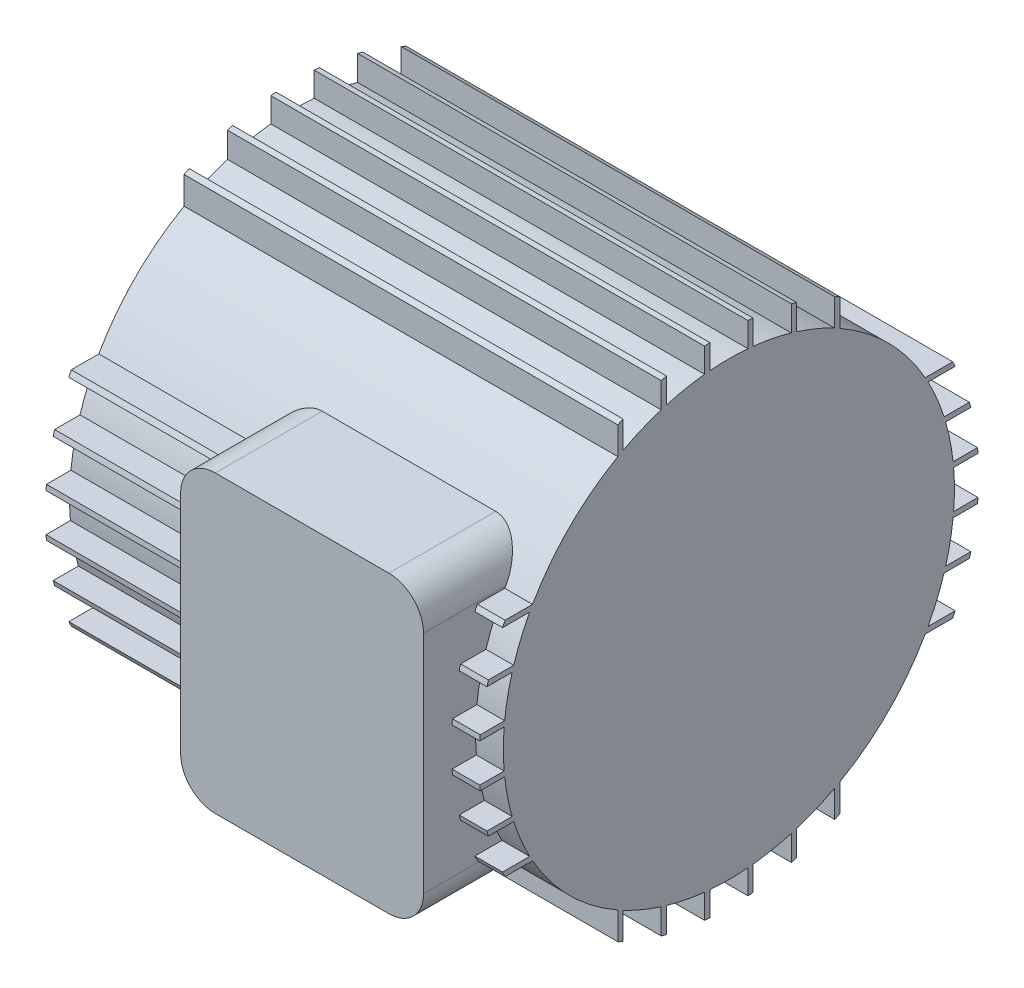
ISO-10303-21;
HEADER;
FILE_DESCRIPTION(('STEP AP214'),'2;1');
FILE_NAME('part.step','',(''),(''),'','','');
FILE_SCHEMA(('AUTOMOTIVE_DESIGN { 1 0 10303 214 1 1 1 1 }'));
ENDSEC;
DATA;
#1=APPLICATION_CONTEXT('core data for automotive mechanical design processes');
#2=APPLICATION_PROTOCOL_DEFINITION('international standard','automotive_design',2000,#1);
#3=PRODUCT_CONTEXT('',#1,'mechanical');
#4=PRODUCT('Part','Part','',(#3));
#5=PRODUCT_RELATED_PRODUCT_CATEGORY('part','',(#4));
#6=PRODUCT_DEFINITION_FORMATION('','',#4);
#7=PRODUCT_DEFINITION_CONTEXT('part definition',#1,'design');
#8=PRODUCT_DEFINITION('design','',#6,#7);
#9=PRODUCT_DEFINITION_SHAPE('','',#8);
#10=(LENGTH_UNIT() NAMED_UNIT(*) SI_UNIT(.MILLI.,.METRE.));
#11=(NAMED_UNIT(*) PLANE_ANGLE_UNIT() SI_UNIT($,.RADIAN.));
#12=(NAMED_UNIT(*) SI_UNIT($,.STERADIAN.) SOLID_ANGLE_UNIT());
#13=UNCERTAINTY_MEASURE_WITH_UNIT(LENGTH_MEASURE(1.E-05),#10,'distance_accuracy_value','');
#14=(GEOMETRIC_REPRESENTATION_CONTEXT(3) GLOBAL_UNCERTAINTY_ASSIGNED_CONTEXT((#13)) GLOBAL_UNIT_ASSIGNED_CONTEXT((#10,
#11,#12)) REPRESENTATION_CONTEXT('',''));
#15=CARTESIAN_POINT('',(0.,0.,0.));
#16=DIRECTION('',(0.,0.,1.));
#17=DIRECTION('',(1.,0.,0.));
#18=AXIS2_PLACEMENT_3D('',#15,#16,#17);
#19=CARTESIAN_POINT('',(-125.,0.,0.));
#20=DIRECTION('',(1.,0.,0.));
#21=DIRECTION('',(0.,0.,-1.));
#22=AXIS2_PLACEMENT_3D('',#19,#20,#21);
#23=CYLINDRICAL_SURFACE('',#22,65.);
#24=DIRECTION('',(1.,0.,0.));
#25=VECTOR('',#24,1.);
#26=CARTESIAN_POINT('',(-133.772589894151,-32.0000000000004,56.5773806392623));
#27=LINE('',#26,#25);
#28=CARTESIAN_POINT('',(-8.00000000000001,-32.0000000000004,56.5773806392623));
#29=VERTEX_POINT('',#28);
#30=CARTESIAN_POINT('',(0.,-32.0000000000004,56.5773806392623));
#31=VERTEX_POINT('',#30);
#32=EDGE_CURVE('E912',#29,#31,#27,.T.);
#33=ORIENTED_EDGE('',*,*,#32,.F.);
#34=CARTESIAN_POINT('',(-7.99999999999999,0.,0.));
#35=DIRECTION('',(-1.,0.,0.));
#36=DIRECTION('',(0.,-1.,0.));
#37=AXIS2_PLACEMENT_3D('',#34,#35,#36);
#38=CIRCLE('',#37,65.);
#39=CARTESIAN_POINT('',(-7.99999999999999,-32.5,56.2916512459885));
#40=VERTEX_POINT('',#39);
#41=EDGE_CURVE('E1710',#29,#40,#38,.F.);
#42=ORIENTED_EDGE('',*,*,#41,.T.);
#43=CARTESIAN_POINT('',(-7.99999999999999,-32.5,56.2916512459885));
#44=CARTESIAN_POINT('',(-8.00000310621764,-32.6845896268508,56.1850804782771));
#45=CARTESIAN_POINT('',(-8.00511133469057,-32.8686188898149,56.0776179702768));
#46=CARTESIAN_POINT('',(-8.02537173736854,-33.2351898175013,55.861144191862));
#47=CARTESIAN_POINT('',(-8.04052313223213,-33.4177315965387,55.752133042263));
#48=CARTESIAN_POINT('',(-8.1007756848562,-33.9624540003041,55.4232028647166));
#49=CARTESIAN_POINT('',(-8.16067551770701,-34.3218993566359,55.201290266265));
#50=CARTESIAN_POINT('',(-8.31883792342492,-35.0313300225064,54.7538350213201));
#51=CARTESIAN_POINT('',(-8.41721194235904,-35.3812846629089,54.5282836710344));
#52=CARTESIAN_POINT('',(-8.65117534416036,-36.0680594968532,54.0764640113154));
#53=CARTESIAN_POINT('',(-8.78676326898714,-36.4048802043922,53.8501957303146));
#54=CARTESIAN_POINT('',(-9.07858167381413,-37.029314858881,53.4224504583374));
#55=CARTESIAN_POINT('',(-9.2313087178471,-37.3184487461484,53.2207932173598));
#56=CARTESIAN_POINT('',(-9.56557800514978,-37.8821832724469,52.8210143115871));
#57=CARTESIAN_POINT('',(-9.74712001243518,-38.1567840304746,52.6228926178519));
#58=CARTESIAN_POINT('',(-10.1383843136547,-38.6890181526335,52.2328305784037));
#59=CARTESIAN_POINT('',(-10.3480648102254,-38.9466758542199,52.0408815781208));
#60=CARTESIAN_POINT('',(-10.7955334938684,-39.4431459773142,51.6656072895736));
#61=CARTESIAN_POINT('',(-11.0333130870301,-39.6819641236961,51.4822793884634));
#62=CARTESIAN_POINT('',(-11.4720698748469,-40.0795703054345,51.1729838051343));
#63=CARTESIAN_POINT('',(-11.6668402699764,-40.2431724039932,51.044365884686));
#64=CARTESIAN_POINT('',(-12.0715606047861,-40.5572448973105,50.7951773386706));
#65=CARTESIAN_POINT('',(-12.2815091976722,-40.7077164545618,50.6746060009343));
#66=CARTESIAN_POINT('',(-12.7160233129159,-40.9939514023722,50.4433324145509));
#67=CARTESIAN_POINT('',(-12.9405744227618,-41.1297289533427,50.332620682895));
#68=CARTESIAN_POINT('',(-13.4038656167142,-41.3851265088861,50.1228352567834));
#69=CARTESIAN_POINT('',(-13.6426028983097,-41.5047496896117,50.0237592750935));
#70=CARTESIAN_POINT('',(-14.0891972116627,-41.706214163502,49.8558490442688));
#71=CARTESIAN_POINT('',(-14.2948968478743,-41.7909822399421,49.7847794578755));
#72=CARTESIAN_POINT('',(-14.7143958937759,-41.9474811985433,49.6529887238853));
#73=CARTESIAN_POINT('',(-14.9281936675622,-42.0192146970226,49.5922654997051));
#74=CARTESIAN_POINT('',(-15.362523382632,-42.1485730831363,49.4823705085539));
#75=CARTESIAN_POINT('',(-15.5830434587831,-42.2062213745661,49.4331795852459));
#76=CARTESIAN_POINT('',(-16.0297374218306,-42.3066540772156,49.347253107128));
#77=CARTESIAN_POINT('',(-16.2559091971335,-42.34944395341,49.3105129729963));
#78=CARTESIAN_POINT('',(-16.7333880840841,-42.4226602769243,49.247542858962));
#79=CARTESIAN_POINT('',(-16.9850998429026,-42.4515951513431,49.2225839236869));
#80=CARTESIAN_POINT('',(-17.364586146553,-42.4806011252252,49.1975473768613));
#81=CARTESIAN_POINT('',(-17.4914663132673,-42.487870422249,49.1912688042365));
#82=CARTESIAN_POINT('',(-17.745556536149,-42.4975709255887,49.1828881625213));
#83=CARTESIAN_POINT('',(-17.8727666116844,-42.5000018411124,49.1807863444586));
#84=CARTESIAN_POINT('',(-18.,-42.5,49.180788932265));
#85=B_SPLINE_CURVE_WITH_KNOTS('',3,(#43,#44,#45,#46,#47,#48,#49,#50,#51,#52,#53,#54,#55,#56,#57,
#58,#59,#60,#61,#62,#63,#64,#65,#66,#67,#68,#69,#70,#71,#72,#73,#74,#75,#76,#77,#78,#79,#80,#81,
#82,#83,#84),.UNSPECIFIED.,.F.,.F.,(4,2,2,2,2,2,2,2,2,2,2,2,2,2,2,2,2,2,2,2,4),(0.,
0.639295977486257,1.27854235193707,2.55645662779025,3.83810031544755,5.11969379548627,
6.27090358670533,7.42210395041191,8.57161284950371,9.72077108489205,10.5751356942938,
11.4294245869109,12.282882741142,13.1361728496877,13.8361694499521,14.5360253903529,
15.2347104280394,15.9331382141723,16.6955437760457,17.0771345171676,17.458748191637),.UNSPECIFIED.);
#86=CARTESIAN_POINT('',(-18.,-42.5,49.180788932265));
#87=VERTEX_POINT('',#86);
#88=EDGE_CURVE('E40',#40,#87,#85,.T.);
#89=ORIENTED_EDGE('',*,*,#88,.T.);
#90=DIRECTION('',(1.,0.,0.));
#91=VECTOR('',#90,1.);
#92=CARTESIAN_POINT('',(-125.,-42.5,49.180788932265));
#93=LINE('',#92,#91);
#94=CARTESIAN_POINT('',(-68.,-42.5,49.180788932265));
#95=VERTEX_POINT('',#94);
#96=EDGE_CURVE('E1318',#87,#95,#93,.F.);
#97=ORIENTED_EDGE('',*,*,#96,.T.);
#98=CARTESIAN_POINT('',(-68.,-42.5,49.180788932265));
#99=CARTESIAN_POINT('',(-68.1185082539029,-42.5000015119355,49.1807868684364));
#100=CARTESIAN_POINT('',(-68.2369985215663,-42.4978927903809,49.182609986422));
#101=CARTESIAN_POINT('',(-68.473711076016,-42.4894755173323,49.1898822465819));
#102=CARTESIAN_POINT('',(-68.5919333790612,-42.4831672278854,49.1953311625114));
#103=CARTESIAN_POINT('',(-68.9456333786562,-42.4579905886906,49.2170657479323));
#104=CARTESIAN_POINT('',(-69.1803853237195,-42.4328703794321,49.2387393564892));
#105=CARTESIAN_POINT('',(-69.6439199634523,-42.3667079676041,49.2956785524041));
#106=CARTESIAN_POINT('',(-69.8727357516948,-42.3257974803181,49.3308316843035));
#107=CARTESIAN_POINT('',(-70.324775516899,-42.2287646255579,49.413920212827));
#108=CARTESIAN_POINT('',(-70.5479986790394,-42.1726400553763,49.4618574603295));
#109=CARTESIAN_POINT('',(-70.9867225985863,-42.0462792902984,49.5693175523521));
#110=CARTESIAN_POINT('',(-71.2022454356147,-41.9760880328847,49.6288034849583));
#111=CARTESIAN_POINT('',(-71.6253006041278,-41.8224389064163,49.7583530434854));
#112=CARTESIAN_POINT('',(-71.8328299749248,-41.7389761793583,49.8284205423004));
#113=CARTESIAN_POINT('',(-72.2394095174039,-41.5596289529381,49.978104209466));
#114=CARTESIAN_POINT('',(-72.4384419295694,-41.4637199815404,50.0577391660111));
#115=CARTESIAN_POINT('',(-72.8270086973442,-41.2605973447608,50.2252969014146));
#116=CARTESIAN_POINT('',(-73.0165421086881,-41.1533825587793,50.3132205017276));
#117=CARTESIAN_POINT('',(-73.4534962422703,-40.8872917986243,50.5298781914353));
#118=CARTESIAN_POINT('',(-73.6966288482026,-40.7238983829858,50.6617460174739));
#119=CARTESIAN_POINT('',(-74.1637108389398,-40.3799006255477,50.9363533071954));
#120=CARTESIAN_POINT('',(-74.3876598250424,-40.1992959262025,51.079092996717));
#121=CARTESIAN_POINT('',(-74.8163252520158,-39.8225141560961,51.3733833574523));
#122=CARTESIAN_POINT('',(-75.0210201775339,-39.6263201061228,51.5249435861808));
#123=CARTESIAN_POINT('',(-75.4106467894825,-39.2202313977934,51.8347260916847));
#124=CARTESIAN_POINT('',(-75.5955799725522,-39.010337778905,51.9929478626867));
#125=CARTESIAN_POINT('',(-76.1257857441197,-38.3557676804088,52.4798304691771));
#126=CARTESIAN_POINT('',(-76.4403270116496,-37.8916592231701,52.8164078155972));
#127=CARTESIAN_POINT('',(-76.985806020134,-36.9231198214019,53.497978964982));
#128=CARTESIAN_POINT('',(-77.2167940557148,-36.4187133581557,53.8429675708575));
#129=CARTESIAN_POINT('',(-77.5021778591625,-35.6290404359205,54.3661362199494));
#130=CARTESIAN_POINT('',(-77.5880724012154,-35.3550704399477,54.5447325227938));
#131=CARTESIAN_POINT('',(-77.7361682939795,-34.7999001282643,54.900596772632));
#132=CARTESIAN_POINT('',(-77.7983705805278,-34.5187000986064,55.0778647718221));
#133=CARTESIAN_POINT('',(-77.8984774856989,-33.9503309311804,55.4300163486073));
#134=CARTESIAN_POINT('',(-77.936369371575,-33.6631587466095,55.6048986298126));
#135=CARTESIAN_POINT('',(-77.987130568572,-33.0844539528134,55.9511688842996));
#136=CARTESIAN_POINT('',(-77.999994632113,-32.7929204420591,56.1225561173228));
#137=CARTESIAN_POINT('',(-78.,-32.5,56.2916512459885));
#138=B_SPLINE_CURVE_WITH_KNOTS('',3,(#98,#99,#100,#101,#102,#103,#104,#105,#106,#107,#108,#109,
#110,#111,#112,#113,#114,#115,#116,#117,#118,#119,#120,#121,#122,#123,#124,#125,#126,#127,#128,
#129,#130,#131,#132,#133,#134,#135,#136,#137),.UNSPECIFIED.,.F.,.F.,(4,2,2,2,2,2,2,2,2,2,2,2,2,
2,2,2,2,2,2,4),(0.,0.355456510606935,0.710890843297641,1.42103890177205,2.12538697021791,
2.82983706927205,3.53207160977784,4.23456379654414,4.9384587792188,5.64242359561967,
6.60478417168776,7.56716474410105,8.53060825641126,9.49397875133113,11.4482450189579,
13.4013329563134,14.4149648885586,15.4285567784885,16.4426791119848,17.4570140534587),.UNSPECIFIED.);
#139=CARTESIAN_POINT('',(-78.,-32.5,56.2916512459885));
#140=VERTEX_POINT('',#139);
#141=EDGE_CURVE('E11',#95,#140,#138,.T.);
#142=ORIENTED_EDGE('',*,*,#141,.T.);
#143=CARTESIAN_POINT('',(-78.,0.,0.));
#144=DIRECTION('',(1.,0.,0.));
#145=DIRECTION('',(0.,0.,-1.));
#146=AXIS2_PLACEMENT_3D('',#143,#144,#145);
#147=CIRCLE('',#146,65.);
#148=CARTESIAN_POINT('',(-78.,-32.0000000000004,56.5773806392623));
#149=VERTEX_POINT('',#148);
#150=EDGE_CURVE('E2004',#140,#149,#147,.F.);
#151=ORIENTED_EDGE('',*,*,#150,.T.);
#152=CARTESIAN_POINT('',(-125.,-32.0000000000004,56.5773806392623));
#153=VERTEX_POINT('',#152);
#154=EDGE_CURVE('E909',#153,#149,#27,.T.);
#155=ORIENTED_EDGE('',*,*,#154,.F.);
#156=CARTESIAN_POINT('',(-125.,0.,0.));
#157=DIRECTION('',(1.,0.,0.));
#158=DIRECTION('',(0.,0.,-1.));
#159=AXIS2_PLACEMENT_3D('',#156,#157,#158);
#160=CIRCLE('',#159,65.);
#161=CARTESIAN_POINT('',(-125.,-56.5773806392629,31.9999999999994));
#162=VERTEX_POINT('',#161);
#163=EDGE_CURVE('E2112',#153,#162,#160,.T.);
#164=ORIENTED_EDGE('',*,*,#163,.T.);
#165=DIRECTION('',(1.,0.,0.));
#166=VECTOR('',#165,1.);
#167=CARTESIAN_POINT('',(-133.772589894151,-56.5773806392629,31.9999999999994));
#168=LINE('',#167,#166);
#169=CARTESIAN_POINT('',(0.,-56.5773806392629,31.9999999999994));
#170=VERTEX_POINT('',#169);
#171=EDGE_CURVE('E1771',#162,#170,#168,.T.);
#172=ORIENTED_EDGE('',*,*,#171,.T.);
#173=CARTESIAN_POINT('',(0.,0.,0.));
#174=DIRECTION('',(1.,0.,0.));
#175=DIRECTION('',(0.,0.,-1.));
#176=AXIS2_PLACEMENT_3D('',#173,#174,#175);
#177=CIRCLE('',#176,65.);
#178=EDGE_CURVE('E1713',#31,#170,#177,.T.);
#179=ORIENTED_EDGE('',*,*,#178,.F.);
#180=EDGE_LOOP('',(#33,#42,#89,#97,#142,#151,#155,#164,#172,#179));
#181=FACE_BOUND('',#180,.T.);
#182=ADVANCED_FACE('F27',(#181),#23,.T.);
#183=DIRECTION('',(1.,0.,0.));
#184=VECTOR('',#183,1.);
#185=CARTESIAN_POINT('',(-133.772589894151,17.9999999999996,62.4579858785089));
#186=LINE('',#185,#184);
#187=CARTESIAN_POINT('',(-8.00000000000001,17.9999999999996,62.4579858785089));
#188=VERTEX_POINT('',#187);
#189=CARTESIAN_POINT('',(0.,17.9999999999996,62.4579858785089));
#190=VERTEX_POINT('',#189);
#191=EDGE_CURVE('E1890',#188,#190,#186,.T.);
#192=ORIENTED_EDGE('',*,*,#191,.F.);
#193=CARTESIAN_POINT('',(-7.99999999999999,0.,0.));
#194=DIRECTION('',(-1.,0.,0.));
#195=DIRECTION('',(0.,-1.,0.));
#196=AXIS2_PLACEMENT_3D('',#193,#194,#195);
#197=CIRCLE('',#196,65.);
#198=CARTESIAN_POINT('',(-7.99999999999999,6.99999999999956,64.6219776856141));
#199=VERTEX_POINT('',#198);
#200=EDGE_CURVE('E1995',#188,#199,#197,.F.);
#201=ORIENTED_EDGE('',*,*,#200,.T.);
#202=DIRECTION('',(1.,0.,0.));
#203=VECTOR('',#202,1.);
#204=CARTESIAN_POINT('',(-133.772589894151,6.99999999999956,64.6219776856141));
#205=LINE('',#204,#203);
#206=CARTESIAN_POINT('',(0.,6.99999999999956,64.6219776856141));
#207=VERTEX_POINT('',#206);
#208=EDGE_CURVE('E1002',#199,#207,#205,.T.);
#209=ORIENTED_EDGE('',*,*,#208,.T.);
#210=EDGE_CURVE('E1901',#190,#207,#177,.T.);
#211=ORIENTED_EDGE('',*,*,#210,.F.);
#212=EDGE_LOOP('',(#192,#201,#209,#211));
#213=FACE_BOUND('',#212,.T.);
#214=ADVANCED_FACE('F1702',(#213),#23,.T.);
#215=CARTESIAN_POINT('',(-125.,6.99999999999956,64.6219776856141));
#216=VERTEX_POINT('',#215);
#217=CARTESIAN_POINT('',(-78.,6.99999999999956,64.6219776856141));
#218=VERTEX_POINT('',#217);
#219=EDGE_CURVE('E999',#216,#218,#205,.T.);
#220=ORIENTED_EDGE('',*,*,#219,.T.);
#221=CARTESIAN_POINT('',(-78.,0.,0.));
#222=DIRECTION('',(1.,0.,0.));
#223=DIRECTION('',(0.,0.,-1.));
#224=AXIS2_PLACEMENT_3D('',#221,#222,#223);
#225=CIRCLE('',#224,65.);
#226=CARTESIAN_POINT('',(-78.,17.9999999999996,62.4579858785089));
#227=VERTEX_POINT('',#226);
#228=EDGE_CURVE('E2063',#218,#227,#225,.F.);
#229=ORIENTED_EDGE('',*,*,#228,.T.);
#230=CARTESIAN_POINT('',(-125.,17.9999999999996,62.4579858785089));
#231=VERTEX_POINT('',#230);
#232=EDGE_CURVE('E1880',#231,#227,#186,.T.);
#233=ORIENTED_EDGE('',*,*,#232,.F.);
#234=EDGE_CURVE('E2125',#231,#216,#160,.T.);
#235=ORIENTED_EDGE('',*,*,#234,.T.);
#236=EDGE_LOOP('',(#220,#229,#233,#235));
#237=FACE_BOUND('',#236,.T.);
#238=ADVANCED_FACE('F1706',(#237),#23,.T.);
#239=DIRECTION('',(1.,0.,0.));
#240=VECTOR('',#239,1.);
#241=CARTESIAN_POINT('',(-133.772589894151,30.4999999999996,57.3999128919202));
#242=LINE('',#241,#240);
#243=CARTESIAN_POINT('',(-7.99999999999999,30.4999999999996,57.3999128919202));
#244=VERTEX_POINT('',#243);
#245=CARTESIAN_POINT('',(0.,30.4999999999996,57.3999128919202));
#246=VERTEX_POINT('',#245);
#247=EDGE_CURVE('E873',#244,#246,#242,.T.);
#248=ORIENTED_EDGE('',*,*,#247,.F.);
#249=CARTESIAN_POINT('',(-7.99999999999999,0.,0.));
#250=DIRECTION('',(-1.,0.,0.));
#251=DIRECTION('',(0.,-1.,0.));
#252=AXIS2_PLACEMENT_3D('',#249,#250,#251);
#253=CIRCLE('',#252,65.);
#254=CARTESIAN_POINT('',(-8.00000000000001,19.4999999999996,62.0060480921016));
#255=VERTEX_POINT('',#254);
#256=EDGE_CURVE('E1997',#244,#255,#253,.F.);
#257=ORIENTED_EDGE('',*,*,#256,.T.);
#258=DIRECTION('',(1.,0.,0.));
#259=VECTOR('',#258,1.);
#260=CARTESIAN_POINT('',(-133.772589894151,19.4999999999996,62.0060480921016));
#261=LINE('',#260,#259);
#262=CARTESIAN_POINT('',(0.,19.4999999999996,62.0060480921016));
#263=VERTEX_POINT('',#262);
#264=EDGE_CURVE('E852',#255,#263,#261,.T.);
#265=ORIENTED_EDGE('',*,*,#264,.T.);
#266=EDGE_CURVE('E1905',#246,#263,#177,.T.);
#267=ORIENTED_EDGE('',*,*,#266,.F.);
#268=EDGE_LOOP('',(#248,#257,#265,#267));
#269=FACE_BOUND('',#268,.T.);
#270=ADVANCED_FACE('F2448',(#269),#23,.T.);
#271=CARTESIAN_POINT('',(-125.,19.4999999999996,62.0060480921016));
#272=VERTEX_POINT('',#271);
#273=CARTESIAN_POINT('',(-78.,19.4999999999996,62.0060480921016));
#274=VERTEX_POINT('',#273);
#275=EDGE_CURVE('E848',#272,#274,#261,.T.);
#276=ORIENTED_EDGE('',*,*,#275,.T.);
#277=CARTESIAN_POINT('',(-78.,0.,0.));
#278=DIRECTION('',(1.,0.,0.));
#279=DIRECTION('',(0.,0.,-1.));
#280=AXIS2_PLACEMENT_3D('',#277,#278,#279);
#281=CIRCLE('',#280,65.);
#282=CARTESIAN_POINT('',(-78.,30.4999999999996,57.3999128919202));
#283=VERTEX_POINT('',#282);
#284=EDGE_CURVE('E822',#274,#283,#281,.F.);
#285=ORIENTED_EDGE('',*,*,#284,.T.);
#286=CARTESIAN_POINT('',(-125.,30.4999999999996,57.3999128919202));
#287=VERTEX_POINT('',#286);
#288=EDGE_CURVE('E859',#287,#283,#242,.T.);
#289=ORIENTED_EDGE('',*,*,#288,.F.);
#290=EDGE_CURVE('E2118',#287,#272,#160,.T.);
#291=ORIENTED_EDGE('',*,*,#290,.T.);
#292=EDGE_LOOP('',(#276,#285,#289,#291));
#293=FACE_BOUND('',#292,.T.);
#294=ADVANCED_FACE('F2452',(#293),#23,.T.);
#295=DIRECTION('',(1.,0.,0.));
#296=VECTOR('',#295,1.);
#297=CARTESIAN_POINT('',(-133.772589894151,-19.5000000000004,62.0060480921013));
#298=LINE('',#297,#296);
#299=CARTESIAN_POINT('',(-8.00000000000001,-19.5000000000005,62.0060480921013));
#300=VERTEX_POINT('',#299);
#301=CARTESIAN_POINT('',(0.,-19.5000000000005,62.0060480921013));
#302=VERTEX_POINT('',#301);
#303=EDGE_CURVE('E943',#300,#302,#298,.T.);
#304=ORIENTED_EDGE('',*,*,#303,.F.);
#305=CARTESIAN_POINT('',(-7.99999999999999,0.,0.));
#306=DIRECTION('',(-1.,0.,0.));
#307=DIRECTION('',(0.,-1.,0.));
#308=AXIS2_PLACEMENT_3D('',#305,#306,#307);
#309=CIRCLE('',#308,65.);
#310=CARTESIAN_POINT('',(-7.99999999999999,-30.5000000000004,57.3999128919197));
#311=VERTEX_POINT('',#310);
#312=EDGE_CURVE('E1729',#300,#311,#309,.F.);
#313=ORIENTED_EDGE('',*,*,#312,.T.);
#314=DIRECTION('',(1.,0.,0.));
#315=VECTOR('',#314,1.);
#316=CARTESIAN_POINT('',(-133.772589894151,-30.5000000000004,57.3999128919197));
#317=LINE('',#316,#315);
#318=CARTESIAN_POINT('',(0.,-30.5000000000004,57.3999128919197));
#319=VERTEX_POINT('',#318);
#320=EDGE_CURVE('E908',#311,#319,#317,.T.);
#321=ORIENTED_EDGE('',*,*,#320,.T.);
#322=EDGE_CURVE('E1930',#302,#319,#177,.T.);
#323=ORIENTED_EDGE('',*,*,#322,.F.);
#324=EDGE_LOOP('',(#304,#313,#321,#323));
#325=FACE_BOUND('',#324,.T.);
#326=ADVANCED_FACE('F1951',(#325),#23,.T.);
#327=CARTESIAN_POINT('',(-125.,-30.5000000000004,57.3999128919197));
#328=VERTEX_POINT('',#327);
#329=CARTESIAN_POINT('',(-78.,-30.5000000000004,57.3999128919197));
#330=VERTEX_POINT('',#329);
#331=EDGE_CURVE('E905',#328,#330,#317,.T.);
#332=ORIENTED_EDGE('',*,*,#331,.T.);
#333=CARTESIAN_POINT('',(-78.,0.,0.));
#334=DIRECTION('',(1.,0.,0.));
#335=DIRECTION('',(0.,0.,-1.));
#336=AXIS2_PLACEMENT_3D('',#333,#334,#335);
#337=CIRCLE('',#336,65.);
#338=CARTESIAN_POINT('',(-78.,-19.5000000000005,62.0060480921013));
#339=VERTEX_POINT('',#338);
#340=EDGE_CURVE('E2015',#330,#339,#337,.F.);
#341=ORIENTED_EDGE('',*,*,#340,.T.);
#342=CARTESIAN_POINT('',(-125.,-19.5000000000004,62.0060480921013));
#343=VERTEX_POINT('',#342);
#344=EDGE_CURVE('E940',#343,#339,#298,.T.);
#345=ORIENTED_EDGE('',*,*,#344,.F.);
#346=EDGE_CURVE('E2116',#343,#328,#160,.T.);
#347=ORIENTED_EDGE('',*,*,#346,.T.);
#348=EDGE_LOOP('',(#332,#341,#345,#347));
#349=FACE_BOUND('',#348,.T.);
#350=ADVANCED_FACE('F2432',(#349),#23,.T.);
#351=DIRECTION('',(1.,0.,0.));
#352=VECTOR('',#351,1.);
#353=CARTESIAN_POINT('',(-133.772589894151,-7.00000000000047,64.621977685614));
#354=LINE('',#353,#352);
#355=CARTESIAN_POINT('',(-8.00000000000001,-7.00000000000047,64.621977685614));
#356=VERTEX_POINT('',#355);
#357=CARTESIAN_POINT('',(0.,-7.00000000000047,64.621977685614));
#358=VERTEX_POINT('',#357);
#359=EDGE_CURVE('E974',#356,#358,#354,.T.);
#360=ORIENTED_EDGE('',*,*,#359,.F.);
#361=CARTESIAN_POINT('',(-7.99999999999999,0.,0.));
#362=DIRECTION('',(-1.,0.,0.));
#363=DIRECTION('',(0.,-1.,0.));
#364=AXIS2_PLACEMENT_3D('',#361,#362,#363);
#365=CIRCLE('',#364,65.);
#366=CARTESIAN_POINT('',(-7.99999999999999,-18.0000000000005,62.4579858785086));
#367=VERTEX_POINT('',#366);
#368=EDGE_CURVE('E1941',#356,#367,#365,.F.);
#369=ORIENTED_EDGE('',*,*,#368,.T.);
#370=DIRECTION('',(1.,0.,0.));
#371=VECTOR('',#370,1.);
#372=CARTESIAN_POINT('',(-133.772589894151,-18.0000000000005,62.4579858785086));
#373=LINE('',#372,#371);
#374=CARTESIAN_POINT('',(0.,-18.0000000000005,62.4579858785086));
#375=VERTEX_POINT('',#374);
#376=EDGE_CURVE('E939',#367,#375,#373,.T.);
#377=ORIENTED_EDGE('',*,*,#376,.T.);
#378=EDGE_CURVE('E1911',#358,#375,#177,.T.);
#379=ORIENTED_EDGE('',*,*,#378,.F.);
#380=EDGE_LOOP('',(#360,#369,#377,#379));
#381=FACE_BOUND('',#380,.T.);
#382=ADVANCED_FACE('F1938',(#381),#23,.T.);
#383=CARTESIAN_POINT('',(-125.,-18.0000000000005,62.4579858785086));
#384=VERTEX_POINT('',#383);
#385=CARTESIAN_POINT('',(-78.,-18.0000000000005,62.4579858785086));
#386=VERTEX_POINT('',#385);
#387=EDGE_CURVE('E936',#384,#386,#373,.T.);
#388=ORIENTED_EDGE('',*,*,#387,.T.);
#389=CARTESIAN_POINT('',(-78.,0.,0.));
#390=DIRECTION('',(1.,0.,0.));
#391=DIRECTION('',(0.,0.,-1.));
#392=AXIS2_PLACEMENT_3D('',#389,#390,#391);
#393=CIRCLE('',#392,65.);
#394=CARTESIAN_POINT('',(-78.,-7.00000000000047,64.621977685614));
#395=VERTEX_POINT('',#394);
#396=EDGE_CURVE('E2027',#386,#395,#393,.F.);
#397=ORIENTED_EDGE('',*,*,#396,.T.);
#398=CARTESIAN_POINT('',(-125.,-7.00000000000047,64.621977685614));
#399=VERTEX_POINT('',#398);
#400=EDGE_CURVE('E971',#399,#395,#354,.T.);
#401=ORIENTED_EDGE('',*,*,#400,.F.);
#402=EDGE_CURVE('E2120',#399,#384,#160,.T.);
#403=ORIENTED_EDGE('',*,*,#402,.T.);
#404=EDGE_LOOP('',(#388,#397,#401,#403));
#405=FACE_BOUND('',#404,.T.);
#406=ADVANCED_FACE('F2406',(#405),#23,.T.);
#407=DIRECTION('',(1.,0.,0.));
#408=VECTOR('',#407,1.);
#409=CARTESIAN_POINT('',(-133.772589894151,5.49999999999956,64.7668896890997));
#410=LINE('',#409,#408);
#411=CARTESIAN_POINT('',(-8.00000000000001,5.49999999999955,64.7668896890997));
#412=VERTEX_POINT('',#411);
#413=CARTESIAN_POINT('',(0.,5.49999999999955,64.7668896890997));
#414=VERTEX_POINT('',#413);
#415=EDGE_CURVE('E1006',#412,#414,#410,.T.);
#416=ORIENTED_EDGE('',*,*,#415,.F.);
#417=CARTESIAN_POINT('',(-7.99999999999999,0.,0.));
#418=DIRECTION('',(-1.,0.,0.));
#419=DIRECTION('',(0.,-1.,0.));
#420=AXIS2_PLACEMENT_3D('',#417,#418,#419);
#421=CIRCLE('',#420,65.);
#422=CARTESIAN_POINT('',(-7.99999999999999,-5.50000000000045,64.7668896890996));
#423=VERTEX_POINT('',#422);
#424=EDGE_CURVE('E1977',#412,#423,#421,.F.);
#425=ORIENTED_EDGE('',*,*,#424,.T.);
#426=DIRECTION('',(1.,0.,0.));
#427=VECTOR('',#426,1.);
#428=CARTESIAN_POINT('',(-133.772589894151,-5.50000000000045,64.7668896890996));
#429=LINE('',#428,#427);
#430=CARTESIAN_POINT('',(0.,-5.50000000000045,64.7668896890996));
#431=VERTEX_POINT('',#430);
#432=EDGE_CURVE('E970',#423,#431,#429,.T.);
#433=ORIENTED_EDGE('',*,*,#432,.T.);
#434=EDGE_CURVE('E1906',#414,#431,#177,.T.);
#435=ORIENTED_EDGE('',*,*,#434,.F.);
#436=EDGE_LOOP('',(#416,#425,#433,#435));
#437=FACE_BOUND('',#436,.T.);
#438=ADVANCED_FACE('F2401',(#437),#23,.T.);
#439=CARTESIAN_POINT('',(-125.,-5.50000000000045,64.7668896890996));
#440=VERTEX_POINT('',#439);
#441=CARTESIAN_POINT('',(-78.,-5.50000000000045,64.7668896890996));
#442=VERTEX_POINT('',#441);
#443=EDGE_CURVE('E967',#440,#442,#429,.T.);
#444=ORIENTED_EDGE('',*,*,#443,.T.);
#445=CARTESIAN_POINT('',(-78.,0.,0.));
#446=DIRECTION('',(1.,0.,0.));
#447=DIRECTION('',(0.,0.,-1.));
#448=AXIS2_PLACEMENT_3D('',#445,#446,#447);
#449=CIRCLE('',#448,65.);
#450=CARTESIAN_POINT('',(-78.,5.49999999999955,64.7668896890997));
#451=VERTEX_POINT('',#450);
#452=EDGE_CURVE('E2045',#442,#451,#449,.F.);
#453=ORIENTED_EDGE('',*,*,#452,.T.);
#454=CARTESIAN_POINT('',(-125.,5.49999999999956,64.7668896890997));
#455=VERTEX_POINT('',#454);
#456=EDGE_CURVE('E1003',#455,#451,#410,.T.);
#457=ORIENTED_EDGE('',*,*,#456,.F.);
#458=EDGE_CURVE('E2132',#455,#440,#160,.T.);
#459=ORIENTED_EDGE('',*,*,#458,.T.);
#460=EDGE_LOOP('',(#444,#453,#457,#459));
#461=FACE_BOUND('',#460,.T.);
#462=ADVANCED_FACE('F2397',(#461),#23,.T.);
#463=CARTESIAN_POINT('',(-78.,0.,0.));
#464=DIRECTION('',(1.,0.,0.));
#465=DIRECTION('',(0.,0.,-1.));
#466=AXIS2_PLACEMENT_3D('',#463,#464,#465);
#467=CIRCLE('',#466,65.);
#468=CARTESIAN_POINT('',(-78.,31.9999999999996,56.5773806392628));
#469=VERTEX_POINT('',#468);
#470=CARTESIAN_POINT('',(-78.,32.5,56.2916512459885));
#471=VERTEX_POINT('',#470);
#472=EDGE_CURVE('E2033',#469,#471,#467,.F.);
#473=ORIENTED_EDGE('',*,*,#472,.T.);
#474=CARTESIAN_POINT('',(-78.,32.5,56.2916512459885));
#475=CARTESIAN_POINT('',(-77.9999968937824,32.6845896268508,56.1850804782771));
#476=CARTESIAN_POINT('',(-77.9948886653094,32.8686188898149,56.0776179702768));
#477=CARTESIAN_POINT('',(-77.9746282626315,33.2351898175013,55.861144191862));
#478=CARTESIAN_POINT('',(-77.9594768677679,33.4177315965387,55.752133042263));
#479=CARTESIAN_POINT('',(-77.8992243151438,33.9624540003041,55.4232028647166));
#480=CARTESIAN_POINT('',(-77.839324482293,34.3218993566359,55.201290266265));
#481=CARTESIAN_POINT('',(-77.6811620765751,35.0313300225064,54.75383502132));
#482=CARTESIAN_POINT('',(-77.582788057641,35.3812846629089,54.5282836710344));
#483=CARTESIAN_POINT('',(-77.3488246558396,36.0680594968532,54.0764640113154));
#484=CARTESIAN_POINT('',(-77.2132367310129,36.4048802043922,53.8501957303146));
#485=CARTESIAN_POINT('',(-76.9214183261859,37.029314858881,53.4224504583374));
#486=CARTESIAN_POINT('',(-76.7686912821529,37.3184487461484,53.2207932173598));
#487=CARTESIAN_POINT('',(-76.4344219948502,37.8821832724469,52.8210143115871));
#488=CARTESIAN_POINT('',(-76.2528799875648,38.1567840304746,52.6228926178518));
#489=CARTESIAN_POINT('',(-75.8616156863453,38.6890181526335,52.2328305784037));
#490=CARTESIAN_POINT('',(-75.6519351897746,38.9466758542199,52.0408815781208));
#491=CARTESIAN_POINT('',(-75.2044665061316,39.4431459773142,51.6656072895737));
#492=CARTESIAN_POINT('',(-74.9666869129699,39.6819641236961,51.4822793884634));
#493=CARTESIAN_POINT('',(-74.5279301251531,40.0795703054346,51.1729838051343));
#494=CARTESIAN_POINT('',(-74.3331597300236,40.2431724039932,51.044365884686));
#495=CARTESIAN_POINT('',(-73.9284393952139,40.5572448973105,50.7951773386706));
#496=CARTESIAN_POINT('',(-73.7184908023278,40.7077164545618,50.6746060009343));
#497=CARTESIAN_POINT('',(-73.2839766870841,40.9939514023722,50.4433324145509));
#498=CARTESIAN_POINT('',(-73.0594255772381,41.1297289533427,50.332620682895));
#499=CARTESIAN_POINT('',(-72.5961343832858,41.3851265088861,50.1228352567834));
#500=CARTESIAN_POINT('',(-72.3573971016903,41.5047496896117,50.0237592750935));
#501=CARTESIAN_POINT('',(-71.9108027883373,41.706214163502,49.8558490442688));
#502=CARTESIAN_POINT('',(-71.7051031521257,41.7909822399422,49.7847794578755));
#503=CARTESIAN_POINT('',(-71.2856041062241,41.9474811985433,49.6529887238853));
#504=CARTESIAN_POINT('',(-71.0718063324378,42.0192146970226,49.5922654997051));
#505=CARTESIAN_POINT('',(-70.637476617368,42.1485730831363,49.4823705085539));
#506=CARTESIAN_POINT('',(-70.4169565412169,42.2062213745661,49.4331795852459));
#507=CARTESIAN_POINT('',(-69.9702625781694,42.3066540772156,49.347253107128));
#508=CARTESIAN_POINT('',(-69.7440908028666,42.34944395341,49.3105129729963));
#509=CARTESIAN_POINT('',(-69.266611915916,42.4226602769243,49.247542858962));
#510=CARTESIAN_POINT('',(-69.0149001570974,42.4515951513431,49.2225839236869));
#511=CARTESIAN_POINT('',(-68.635413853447,42.4806011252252,49.1975473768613));
#512=CARTESIAN_POINT('',(-68.5085336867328,42.487870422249,49.1912688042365));
#513=CARTESIAN_POINT('',(-68.254443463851,42.4975709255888,49.1828881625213));
#514=CARTESIAN_POINT('',(-68.1272333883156,42.5000018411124,49.1807863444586));
#515=CARTESIAN_POINT('',(-68.,42.5,49.180788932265));
#516=B_SPLINE_CURVE_WITH_KNOTS('',3,(#474,#475,#476,#477,#478,#479,#480,#481,#482,#483,#484,
#485,#486,#487,#488,#489,#490,#491,#492,#493,#494,#495,#496,#497,#498,#499,#500,#501,#502,#503,
#504,#505,#506,#507,#508,#509,#510,#511,#512,#513,#514,#515),.UNSPECIFIED.,.F.,.F.,(4,2,2,2,2,2,
2,2,2,2,2,2,2,2,2,2,2,2,2,2,4),(0.,0.639295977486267,1.27854235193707,2.55645662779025,
3.83810031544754,5.11969379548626,6.27090358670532,7.42210395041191,8.57161284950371,
9.72077108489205,10.5751356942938,11.4294245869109,12.282882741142,13.1361728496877,
13.8361694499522,14.5360253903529,15.2347104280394,15.9331382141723,16.6955437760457,
17.0771345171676,17.458748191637),.UNSPECIFIED.);
#517=CARTESIAN_POINT('',(-68.,42.5,49.180788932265));
#518=VERTEX_POINT('',#517);
#519=EDGE_CURVE('E1353',#471,#518,#516,.T.);
#520=ORIENTED_EDGE('',*,*,#519,.T.);
#521=DIRECTION('',(1.,0.,0.));
#522=VECTOR('',#521,1.);
#523=CARTESIAN_POINT('',(-125.,42.5,49.180788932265));
#524=LINE('',#523,#522);
#525=CARTESIAN_POINT('',(-18.,42.5,49.180788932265));
#526=VERTEX_POINT('',#525);
#527=EDGE_CURVE('E1315',#518,#526,#524,.T.);
#528=ORIENTED_EDGE('',*,*,#527,.T.);
#529=CARTESIAN_POINT('',(-18.,42.5,49.180788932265));
#530=CARTESIAN_POINT('',(-17.8814917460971,42.5000015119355,49.1807868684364));
#531=CARTESIAN_POINT('',(-17.7630014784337,42.497892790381,49.182609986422));
#532=CARTESIAN_POINT('',(-17.5262889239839,42.4894755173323,49.1898822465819));
#533=CARTESIAN_POINT('',(-17.4080666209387,42.4831672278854,49.1953311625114));
#534=CARTESIAN_POINT('',(-17.0543666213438,42.4579905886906,49.2170657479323));
#535=CARTESIAN_POINT('',(-16.8196146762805,42.4328703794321,49.2387393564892));
#536=CARTESIAN_POINT('',(-16.3560800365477,42.3667079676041,49.2956785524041));
#537=CARTESIAN_POINT('',(-16.1272642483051,42.3257974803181,49.3308316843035));
#538=CARTESIAN_POINT('',(-15.675224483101,42.2287646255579,49.413920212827));
#539=CARTESIAN_POINT('',(-15.4520013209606,42.1726400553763,49.4618574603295));
#540=CARTESIAN_POINT('',(-15.0132774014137,42.0462792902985,49.5693175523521));
#541=CARTESIAN_POINT('',(-14.7977545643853,41.9760880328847,49.6288034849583));
#542=CARTESIAN_POINT('',(-14.3746993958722,41.8224389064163,49.7583530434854));
#543=CARTESIAN_POINT('',(-14.1671700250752,41.7389761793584,49.8284205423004));
#544=CARTESIAN_POINT('',(-13.7605904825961,41.5596289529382,49.9781042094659));
#545=CARTESIAN_POINT('',(-13.5615580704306,41.4637199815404,50.0577391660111));
#546=CARTESIAN_POINT('',(-13.1729913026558,41.2605973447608,50.2252969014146));
#547=CARTESIAN_POINT('',(-12.9834578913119,41.1533825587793,50.3132205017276));
#548=CARTESIAN_POINT('',(-12.5465037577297,40.8872917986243,50.5298781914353));
#549=CARTESIAN_POINT('',(-12.3033711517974,40.7238983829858,50.6617460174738));
#550=CARTESIAN_POINT('',(-11.8362891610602,40.3799006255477,50.9363533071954));
#551=CARTESIAN_POINT('',(-11.6123401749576,40.1992959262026,51.079092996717));
#552=CARTESIAN_POINT('',(-11.1836747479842,39.8225141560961,51.3733833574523));
#553=CARTESIAN_POINT('',(-10.9789798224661,39.6263201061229,51.5249435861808));
#554=CARTESIAN_POINT('',(-10.5893532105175,39.2202313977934,51.8347260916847));
#555=CARTESIAN_POINT('',(-10.4044200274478,39.010337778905,51.9929478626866));
#556=CARTESIAN_POINT('',(-9.87421425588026,38.3557676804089,52.4798304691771));
#557=CARTESIAN_POINT('',(-9.55967298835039,37.8916592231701,52.8164078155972));
#558=CARTESIAN_POINT('',(-9.01419397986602,36.923119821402,53.497978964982));
#559=CARTESIAN_POINT('',(-8.78320594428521,36.4187133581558,53.8429675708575));
#560=CARTESIAN_POINT('',(-8.49782214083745,35.6290404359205,54.3661362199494));
#561=CARTESIAN_POINT('',(-8.41192759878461,35.3550704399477,54.5447325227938));
#562=CARTESIAN_POINT('',(-8.26383170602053,34.7999001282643,54.900596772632));
#563=CARTESIAN_POINT('',(-8.20162941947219,34.5187000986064,55.0778647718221));
#564=CARTESIAN_POINT('',(-8.10152251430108,33.9503309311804,55.4300163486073));
#565=CARTESIAN_POINT('',(-8.06363062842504,33.6631587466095,55.6048986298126));
#566=CARTESIAN_POINT('',(-8.01286943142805,33.0844539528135,55.9511688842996));
#567=CARTESIAN_POINT('',(-8.00000536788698,32.7929204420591,56.1225561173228));
#568=CARTESIAN_POINT('',(-7.99999999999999,32.5,56.2916512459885));
#569=B_SPLINE_CURVE_WITH_KNOTS('',3,(#529,#530,#531,#532,#533,#534,#535,#536,#537,#538,#539,
#540,#541,#542,#543,#544,#545,#546,#547,#548,#549,#550,#551,#552,#553,#554,#555,#556,#557,#558,
#559,#560,#561,#562,#563,#564,#565,#566,#567,#568),.UNSPECIFIED.,.F.,.F.,(4,2,2,2,2,2,2,2,2,2,2,
2,2,2,2,2,2,2,2,4),(0.,0.355456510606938,0.710890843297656,1.42103890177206,2.12538697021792,
2.82983706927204,3.53207160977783,4.23456379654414,4.9384587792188,5.64242359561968,
6.60478417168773,7.56716474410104,8.53060825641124,9.49397875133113,11.448245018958,
13.4013329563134,14.4149648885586,15.4285567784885,16.4426791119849,17.4570140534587),.UNSPECIFIED.);
#570=CARTESIAN_POINT('',(-7.99999999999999,32.5,56.2916512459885));
#571=VERTEX_POINT('',#570);
#572=EDGE_CURVE('E1347',#526,#571,#569,.T.);
#573=ORIENTED_EDGE('',*,*,#572,.T.);
#574=CARTESIAN_POINT('',(-7.99999999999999,0.,0.));
#575=DIRECTION('',(-1.,0.,0.));
#576=DIRECTION('',(0.,-1.,0.));
#577=AXIS2_PLACEMENT_3D('',#574,#575,#576);
#578=CIRCLE('',#577,65.);
#579=CARTESIAN_POINT('',(-8.00000000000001,31.9999999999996,56.5773806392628));
#580=VERTEX_POINT('',#579);
#581=EDGE_CURVE('E1966',#571,#580,#578,.F.);
#582=ORIENTED_EDGE('',*,*,#581,.T.);
#583=DIRECTION('',(1.,0.,0.));
#584=VECTOR('',#583,1.);
#585=CARTESIAN_POINT('',(-133.772589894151,31.9999999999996,56.5773806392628));
#586=LINE('',#585,#584);
#587=CARTESIAN_POINT('',(0.,31.9999999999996,56.5773806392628));
#588=VERTEX_POINT('',#587);
#589=EDGE_CURVE('E870',#580,#588,#586,.T.);
#590=ORIENTED_EDGE('',*,*,#589,.T.);
#591=CARTESIAN_POINT('',(0.,56.5773806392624,32.0000000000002));
#592=VERTEX_POINT('',#591);
#593=EDGE_CURVE('E1909',#592,#588,#177,.T.);
#594=ORIENTED_EDGE('',*,*,#593,.F.);
#595=DIRECTION('',(1.,0.,0.));
#596=VECTOR('',#595,1.);
#597=CARTESIAN_POINT('',(-133.772589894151,56.5773806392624,32.0000000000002));
#598=LINE('',#597,#596);
#599=CARTESIAN_POINT('',(-125.,56.5773806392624,32.0000000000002));
#600=VERTEX_POINT('',#599);
#601=EDGE_CURVE('E1078',#600,#592,#598,.T.);
#602=ORIENTED_EDGE('',*,*,#601,.F.);
#603=CARTESIAN_POINT('',(-125.,31.9999999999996,56.5773806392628));
#604=VERTEX_POINT('',#603);
#605=EDGE_CURVE('E2124',#600,#604,#160,.T.);
#606=ORIENTED_EDGE('',*,*,#605,.T.);
#607=EDGE_CURVE('E882',#604,#469,#586,.T.);
#608=ORIENTED_EDGE('',*,*,#607,.T.);
#609=EDGE_LOOP('',(#473,#520,#528,#573,#582,#590,#594,#602,#606,#608));
#610=FACE_BOUND('',#609,.T.);
#611=ADVANCED_FACE('F1544',(#610),#23,.T.);
#612=CARTESIAN_POINT('',(-133.772589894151,0.,0.));
#613=DIRECTION('',(1.,0.,0.));
#614=DIRECTION('',(0.,0.,-1.));
#615=AXIS2_PLACEMENT_3D('',#612,#613,#614);
#616=CYLINDRICAL_SURFACE('',#615,72.);
#617=DIRECTION('',(1.,0.,0.));
#618=VECTOR('',#617,1.);
#619=CARTESIAN_POINT('',(-133.772589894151,6.99999999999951,71.6589143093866));
#620=LINE('',#619,#618);
#621=CARTESIAN_POINT('',(-8.00000000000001,6.99999999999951,71.6589143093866));
#622=VERTEX_POINT('',#621);
#623=CARTESIAN_POINT('',(0.,6.99999999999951,71.6589143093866));
#624=VERTEX_POINT('',#623);
#625=EDGE_CURVE('E998',#622,#624,#620,.T.);
#626=ORIENTED_EDGE('',*,*,#625,.F.);
#627=CARTESIAN_POINT('',(-8.00000000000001,0.,0.));
#628=DIRECTION('',(-1.,0.,0.));
#629=DIRECTION('',(0.,-1.,0.));
#630=AXIS2_PLACEMENT_3D('',#627,#628,#629);
#631=CIRCLE('',#630,72.);
#632=CARTESIAN_POINT('',(-8.00000000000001,5.4999999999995,71.789623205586));
#633=VERTEX_POINT('',#632);
#634=EDGE_CURVE('E1986',#622,#633,#631,.F.);
#635=ORIENTED_EDGE('',*,*,#634,.T.);
#636=DIRECTION('',(1.,0.,0.));
#637=VECTOR('',#636,1.);
#638=CARTESIAN_POINT('',(-133.772589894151,5.4999999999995,71.789623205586));
#639=LINE('',#638,#637);
#640=CARTESIAN_POINT('',(0.,5.4999999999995,71.789623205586));
#641=VERTEX_POINT('',#640);
#642=EDGE_CURVE('E995',#633,#641,#639,.T.);
#643=ORIENTED_EDGE('',*,*,#642,.T.);
#644=CARTESIAN_POINT('',(0.,0.,0.));
#645=DIRECTION('',(1.,0.,0.));
#646=DIRECTION('',(0.,0.,1.));
#647=AXIS2_PLACEMENT_3D('',#644,#645,#646);
#648=CIRCLE('',#647,72.);
#649=EDGE_CURVE('E979',#624,#641,#648,.T.);
#650=ORIENTED_EDGE('',*,*,#649,.F.);
#651=EDGE_LOOP('',(#626,#635,#643,#650));
#652=FACE_BOUND('',#651,.T.);
#653=ADVANCED_FACE('F1541',(#652),#616,.T.);
#654=CARTESIAN_POINT('',(-125.,5.4999999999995,71.789623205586));
#655=VERTEX_POINT('',#654);
#656=CARTESIAN_POINT('',(-78.,5.4999999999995,71.789623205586));
#657=VERTEX_POINT('',#656);
#658=EDGE_CURVE('E1007',#655,#657,#639,.T.);
#659=ORIENTED_EDGE('',*,*,#658,.T.);
#660=CARTESIAN_POINT('',(-78.,0.,0.));
#661=DIRECTION('',(1.,0.,0.));
#662=DIRECTION('',(0.,0.,-1.));
#663=AXIS2_PLACEMENT_3D('',#660,#661,#662);
#664=CIRCLE('',#663,72.);
#665=CARTESIAN_POINT('',(-78.,6.99999999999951,71.6589143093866));
#666=VERTEX_POINT('',#665);
#667=EDGE_CURVE('E2054',#657,#666,#664,.F.);
#668=ORIENTED_EDGE('',*,*,#667,.T.);
#669=CARTESIAN_POINT('',(-125.,6.99999999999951,71.6589143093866));
#670=VERTEX_POINT('',#669);
#671=EDGE_CURVE('E984',#670,#666,#620,.T.);
#672=ORIENTED_EDGE('',*,*,#671,.F.);
#673=CARTESIAN_POINT('',(-125.,0.,0.));
#674=DIRECTION('',(1.,0.,0.));
#675=DIRECTION('',(0.,0.,-1.));
#676=AXIS2_PLACEMENT_3D('',#673,#674,#675);
#677=CIRCLE('',#676,72.);
#678=EDGE_CURVE('E983',#655,#670,#677,.F.);
#679=ORIENTED_EDGE('',*,*,#678,.F.);
#680=EDGE_LOOP('',(#659,#668,#672,#679));
#681=FACE_BOUND('',#680,.T.);
#682=ADVANCED_FACE('F1535',(#681),#616,.T.);
#683=CARTESIAN_POINT('',(-133.772589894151,6.99999999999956,64.6219776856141));
#684=DIRECTION('',(0.,1.,0.));
#685=DIRECTION('',(0.,0.,1.));
#686=AXIS2_PLACEMENT_3D('',#683,#684,#685);
#687=PLANE('',#686);
#688=ORIENTED_EDGE('',*,*,#208,.F.);
#689=DIRECTION('',(0.,0.,1.));
#690=VECTOR('',#689,1.);
#691=CARTESIAN_POINT('',(-8.00000000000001,6.99999999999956,64.6219776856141));
#692=LINE('',#691,#690);
#693=EDGE_CURVE('E1989',#199,#622,#692,.T.);
#694=ORIENTED_EDGE('',*,*,#693,.T.);
#695=ORIENTED_EDGE('',*,*,#625,.T.);
#696=DIRECTION('',(0.,0.,1.));
#697=VECTOR('',#696,1.);
#698=CARTESIAN_POINT('',(0.,6.99999999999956,64.6219776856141));
#699=LINE('',#698,#697);
#700=EDGE_CURVE('E992',#207,#624,#699,.T.);
#701=ORIENTED_EDGE('',*,*,#700,.F.);
#702=EDGE_LOOP('',(#688,#694,#695,#701));
#703=FACE_BOUND('',#702,.T.);
#704=ADVANCED_FACE('F1531',(#703),#687,.T.);
#705=ORIENTED_EDGE('',*,*,#671,.T.);
#706=DIRECTION('',(0.,0.,-1.));
#707=VECTOR('',#706,1.);
#708=CARTESIAN_POINT('',(-78.,6.99999999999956,64.6219776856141));
#709=LINE('',#708,#707);
#710=EDGE_CURVE('E2057',#666,#218,#709,.T.);
#711=ORIENTED_EDGE('',*,*,#710,.T.);
#712=ORIENTED_EDGE('',*,*,#219,.F.);
#713=DIRECTION('',(0.,0.,-1.));
#714=VECTOR('',#713,1.);
#715=CARTESIAN_POINT('',(-125.,6.99999999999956,64.6219776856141));
#716=LINE('',#715,#714);
#717=EDGE_CURVE('E980',#670,#216,#716,.T.);
#718=ORIENTED_EDGE('',*,*,#717,.F.);
#719=EDGE_LOOP('',(#705,#711,#712,#718));
#720=FACE_BOUND('',#719,.T.);
#721=ADVANCED_FACE('F1534',(#720),#687,.T.);
#722=CARTESIAN_POINT('',(-133.772589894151,5.49999999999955,64.7668896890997));
#723=DIRECTION('',(0.,-1.,0.));
#724=DIRECTION('',(0.,0.,-1.));
#725=AXIS2_PLACEMENT_3D('',#722,#723,#724);
#726=PLANE('',#725);
#727=ORIENTED_EDGE('',*,*,#642,.F.);
#728=DIRECTION('',(0.,0.,-1.));
#729=VECTOR('',#728,1.);
#730=CARTESIAN_POINT('',(-8.00000000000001,5.49999999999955,64.7668896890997));
#731=LINE('',#730,#729);
#732=EDGE_CURVE('E1980',#633,#412,#731,.T.);
#733=ORIENTED_EDGE('',*,*,#732,.T.);
#734=ORIENTED_EDGE('',*,*,#415,.T.);
#735=DIRECTION('',(0.,0.,-1.));
#736=VECTOR('',#735,1.);
#737=CARTESIAN_POINT('',(0.,5.49999999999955,64.7668896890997));
#738=LINE('',#737,#736);
#739=EDGE_CURVE('E989',#641,#414,#738,.T.);
#740=ORIENTED_EDGE('',*,*,#739,.F.);
#741=EDGE_LOOP('',(#727,#733,#734,#740));
#742=FACE_BOUND('',#741,.T.);
#743=ADVANCED_FACE('F1537',(#742),#726,.T.);
#744=ORIENTED_EDGE('',*,*,#456,.T.);
#745=DIRECTION('',(0.,0.,1.));
#746=VECTOR('',#745,1.);
#747=CARTESIAN_POINT('',(-78.,5.49999999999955,64.7668896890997));
#748=LINE('',#747,#746);
#749=EDGE_CURVE('E2048',#451,#657,#748,.T.);
#750=ORIENTED_EDGE('',*,*,#749,.T.);
#751=ORIENTED_EDGE('',*,*,#658,.F.);
#752=DIRECTION('',(0.,0.,1.));
#753=VECTOR('',#752,1.);
#754=CARTESIAN_POINT('',(-125.,5.49999999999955,64.7668896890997));
#755=LINE('',#754,#753);
#756=EDGE_CURVE('E986',#455,#655,#755,.T.);
#757=ORIENTED_EDGE('',*,*,#756,.F.);
#758=EDGE_LOOP('',(#744,#750,#751,#757));
#759=FACE_BOUND('',#758,.T.);
#760=ADVANCED_FACE('F1529',(#759),#726,.T.);
#761=CARTESIAN_POINT('',(-133.772589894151,0.,0.));
#762=DIRECTION('',(1.,0.,0.));
#763=DIRECTION('',(0.,0.,-1.));
#764=AXIS2_PLACEMENT_3D('',#761,#762,#763);
#765=CYLINDRICAL_SURFACE('',#764,72.);
#766=DIRECTION('',(1.,0.,0.));
#767=VECTOR('',#766,1.);
#768=CARTESIAN_POINT('',(-133.772589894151,-5.5000000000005,71.7896232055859));
#769=LINE('',#768,#767);
#770=CARTESIAN_POINT('',(-8.00000000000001,-5.5000000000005,71.7896232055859));
#771=VERTEX_POINT('',#770);
#772=CARTESIAN_POINT('',(0.,-5.5000000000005,71.7896232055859));
#773=VERTEX_POINT('',#772);
#774=EDGE_CURVE('E966',#771,#773,#769,.T.);
#775=ORIENTED_EDGE('',*,*,#774,.F.);
#776=CARTESIAN_POINT('',(-8.00000000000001,0.,0.));
#777=DIRECTION('',(-1.,0.,0.));
#778=DIRECTION('',(0.,-1.,0.));
#779=AXIS2_PLACEMENT_3D('',#776,#777,#778);
#780=CIRCLE('',#779,72.);
#781=CARTESIAN_POINT('',(-8.00000000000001,-7.00000000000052,71.6589143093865));
#782=VERTEX_POINT('',#781);
#783=EDGE_CURVE('E1968',#771,#782,#780,.F.);
#784=ORIENTED_EDGE('',*,*,#783,.T.);
#785=DIRECTION('',(1.,0.,0.));
#786=VECTOR('',#785,1.);
#787=CARTESIAN_POINT('',(-133.772589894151,-7.00000000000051,71.6589143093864));
#788=LINE('',#787,#786);
#789=CARTESIAN_POINT('',(0.,-7.00000000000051,71.6589143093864));
#790=VERTEX_POINT('',#789);
#791=EDGE_CURVE('E963',#782,#790,#788,.T.);
#792=ORIENTED_EDGE('',*,*,#791,.T.);
#793=CARTESIAN_POINT('',(0.,0.,0.));
#794=DIRECTION('',(1.,0.,0.));
#795=DIRECTION('',(0.,0.,1.));
#796=AXIS2_PLACEMENT_3D('',#793,#794,#795);
#797=CIRCLE('',#796,72.);
#798=EDGE_CURVE('E948',#773,#790,#797,.T.);
#799=ORIENTED_EDGE('',*,*,#798,.F.);
#800=EDGE_LOOP('',(#775,#784,#792,#799));
#801=FACE_BOUND('',#800,.T.);
#802=ADVANCED_FACE('F1526',(#801),#765,.T.);
#803=CARTESIAN_POINT('',(-125.,-7.00000000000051,71.6589143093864));
#804=VERTEX_POINT('',#803);
#805=CARTESIAN_POINT('',(-78.,-7.00000000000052,71.6589143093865));
#806=VERTEX_POINT('',#805);
#807=EDGE_CURVE('E975',#804,#806,#788,.T.);
#808=ORIENTED_EDGE('',*,*,#807,.T.);
#809=CARTESIAN_POINT('',(-78.,0.,0.));
#810=DIRECTION('',(1.,0.,0.));
#811=DIRECTION('',(0.,0.,-1.));
#812=AXIS2_PLACEMENT_3D('',#809,#810,#811);
#813=CIRCLE('',#812,72.);
#814=CARTESIAN_POINT('',(-78.,-5.5000000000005,71.7896232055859));
#815=VERTEX_POINT('',#814);
#816=EDGE_CURVE('E2036',#806,#815,#813,.F.);
#817=ORIENTED_EDGE('',*,*,#816,.T.);
#818=CARTESIAN_POINT('',(-125.,-5.5000000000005,71.7896232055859));
#819=VERTEX_POINT('',#818);
#820=EDGE_CURVE('E952',#819,#815,#769,.T.);
#821=ORIENTED_EDGE('',*,*,#820,.F.);
#822=CARTESIAN_POINT('',(-125.,0.,0.));
#823=DIRECTION('',(1.,0.,0.));
#824=DIRECTION('',(0.,0.,-1.));
#825=AXIS2_PLACEMENT_3D('',#822,#823,#824);
#826=CIRCLE('',#825,72.);
#827=EDGE_CURVE('E951',#804,#819,#826,.F.);
#828=ORIENTED_EDGE('',*,*,#827,.F.);
#829=EDGE_LOOP('',(#808,#817,#821,#828));
#830=FACE_BOUND('',#829,.T.);
#831=ADVANCED_FACE('F1520',(#830),#765,.T.);
#832=CARTESIAN_POINT('',(-133.772589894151,-5.50000000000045,64.7668896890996));
#833=DIRECTION('',(0.,1.,0.));
#834=DIRECTION('',(0.,0.,1.));
#835=AXIS2_PLACEMENT_3D('',#832,#833,#834);
#836=PLANE('',#835);
#837=ORIENTED_EDGE('',*,*,#432,.F.);
#838=DIRECTION('',(0.,0.,1.));
#839=VECTOR('',#838,1.);
#840=CARTESIAN_POINT('',(-8.00000000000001,-5.50000000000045,64.7668896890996));
#841=LINE('',#840,#839);
#842=EDGE_CURVE('E1971',#423,#771,#841,.T.);
#843=ORIENTED_EDGE('',*,*,#842,.T.);
#844=ORIENTED_EDGE('',*,*,#774,.T.);
#845=DIRECTION('',(0.,0.,1.));
#846=VECTOR('',#845,1.);
#847=CARTESIAN_POINT('',(0.,-5.50000000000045,64.7668896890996));
#848=LINE('',#847,#846);
#849=EDGE_CURVE('E960',#431,#773,#848,.T.);
#850=ORIENTED_EDGE('',*,*,#849,.F.);
#851=EDGE_LOOP('',(#837,#843,#844,#850));
#852=FACE_BOUND('',#851,.T.);
#853=ADVANCED_FACE('F1516',(#852),#836,.T.);
#854=ORIENTED_EDGE('',*,*,#820,.T.);
#855=DIRECTION('',(0.,0.,-1.));
#856=VECTOR('',#855,1.);
#857=CARTESIAN_POINT('',(-78.,-5.50000000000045,64.7668896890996));
#858=LINE('',#857,#856);
#859=EDGE_CURVE('E2039',#815,#442,#858,.T.);
#860=ORIENTED_EDGE('',*,*,#859,.T.);
#861=ORIENTED_EDGE('',*,*,#443,.F.);
#862=DIRECTION('',(0.,0.,-1.));
#863=VECTOR('',#862,1.);
#864=CARTESIAN_POINT('',(-125.,-5.50000000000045,64.7668896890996));
#865=LINE('',#864,#863);
#866=EDGE_CURVE('E949',#819,#440,#865,.T.);
#867=ORIENTED_EDGE('',*,*,#866,.F.);
#868=EDGE_LOOP('',(#854,#860,#861,#867));
#869=FACE_BOUND('',#868,.T.);
#870=ADVANCED_FACE('F1519',(#869),#836,.T.);
#871=CARTESIAN_POINT('',(-133.772589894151,-7.00000000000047,64.621977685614));
#872=DIRECTION('',(0.,-1.,0.));
#873=DIRECTION('',(0.,0.,-1.));
#874=AXIS2_PLACEMENT_3D('',#871,#872,#873);
#875=PLANE('',#874);
#876=ORIENTED_EDGE('',*,*,#791,.F.);
#877=DIRECTION('',(0.,0.,-1.));
#878=VECTOR('',#877,1.);
#879=CARTESIAN_POINT('',(-8.00000000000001,-7.00000000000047,64.621977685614));
#880=LINE('',#879,#878);
#881=EDGE_CURVE('E1963',#782,#356,#880,.T.);
#882=ORIENTED_EDGE('',*,*,#881,.T.);
#883=ORIENTED_EDGE('',*,*,#359,.T.);
#884=DIRECTION('',(0.,0.,-1.));
#885=VECTOR('',#884,1.);
#886=CARTESIAN_POINT('',(0.,-7.00000000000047,64.621977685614));
#887=LINE('',#886,#885);
#888=EDGE_CURVE('E957',#790,#358,#887,.T.);
#889=ORIENTED_EDGE('',*,*,#888,.F.);
#890=EDGE_LOOP('',(#876,#882,#883,#889));
#891=FACE_BOUND('',#890,.T.);
#892=ADVANCED_FACE('F1522',(#891),#875,.T.);
#893=ORIENTED_EDGE('',*,*,#400,.T.);
#894=DIRECTION('',(0.,0.,1.));
#895=VECTOR('',#894,1.);
#896=CARTESIAN_POINT('',(-78.,-7.00000000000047,64.621977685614));
#897=LINE('',#896,#895);
#898=EDGE_CURVE('E2030',#395,#806,#897,.T.);
#899=ORIENTED_EDGE('',*,*,#898,.T.);
#900=ORIENTED_EDGE('',*,*,#807,.F.);
#901=DIRECTION('',(0.,0.,1.));
#902=VECTOR('',#901,1.);
#903=CARTESIAN_POINT('',(-125.,-7.00000000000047,64.621977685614));
#904=LINE('',#903,#902);
#905=EDGE_CURVE('E954',#399,#804,#904,.T.);
#906=ORIENTED_EDGE('',*,*,#905,.F.);
#907=EDGE_LOOP('',(#893,#899,#900,#906));
#908=FACE_BOUND('',#907,.T.);
#909=ADVANCED_FACE('F1514',(#908),#875,.T.);
#910=CARTESIAN_POINT('',(-133.772589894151,0.,0.));
#911=DIRECTION('',(1.,0.,0.));
#912=DIRECTION('',(0.,0.,-1.));
#913=AXIS2_PLACEMENT_3D('',#910,#911,#912);
#914=CYLINDRICAL_SURFACE('',#913,72.);
#915=DIRECTION('',(1.,0.,0.));
#916=VECTOR('',#915,1.);
#917=CARTESIAN_POINT('',(-133.772589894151,-18.0000000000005,69.7137002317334));
#918=LINE('',#917,#916);
#919=CARTESIAN_POINT('',(-8.00000000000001,-18.0000000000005,69.7137002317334));
#920=VERTEX_POINT('',#919);
#921=CARTESIAN_POINT('',(0.,-18.0000000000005,69.7137002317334));
#922=VERTEX_POINT('',#921);
#923=EDGE_CURVE('E935',#920,#922,#918,.T.);
#924=ORIENTED_EDGE('',*,*,#923,.F.);
#925=CARTESIAN_POINT('',(-8.00000000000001,0.,0.));
#926=DIRECTION('',(-1.,0.,0.));
#927=DIRECTION('',(0.,-1.,0.));
#928=AXIS2_PLACEMENT_3D('',#925,#926,#927);
#929=CIRCLE('',#928,72.);
#930=CARTESIAN_POINT('',(-8.00000000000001,-19.5000000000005,69.3090903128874));
#931=VERTEX_POINT('',#930);
#932=EDGE_CURVE('E1957',#920,#931,#929,.F.);
#933=ORIENTED_EDGE('',*,*,#932,.T.);
#934=DIRECTION('',(1.,0.,0.));
#935=VECTOR('',#934,1.);
#936=CARTESIAN_POINT('',(-133.772589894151,-19.5000000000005,69.3090903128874));
#937=LINE('',#936,#935);
#938=CARTESIAN_POINT('',(0.,-19.5000000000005,69.3090903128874));
#939=VERTEX_POINT('',#938);
#940=EDGE_CURVE('E932',#931,#939,#937,.T.);
#941=ORIENTED_EDGE('',*,*,#940,.T.);
#942=CARTESIAN_POINT('',(0.,0.,0.));
#943=DIRECTION('',(1.,0.,0.));
#944=DIRECTION('',(0.,0.,1.));
#945=AXIS2_PLACEMENT_3D('',#942,#943,#944);
#946=CIRCLE('',#945,72.);
#947=EDGE_CURVE('E917',#922,#939,#946,.T.);
#948=ORIENTED_EDGE('',*,*,#947,.F.);
#949=EDGE_LOOP('',(#924,#933,#941,#948));
#950=FACE_BOUND('',#949,.T.);
#951=ADVANCED_FACE('F1511',(#950),#914,.T.);
#952=CARTESIAN_POINT('',(-125.,-19.5000000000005,69.3090903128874));
#953=VERTEX_POINT('',#952);
#954=CARTESIAN_POINT('',(-78.,-19.5000000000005,69.3090903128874));
#955=VERTEX_POINT('',#954);
#956=EDGE_CURVE('E944',#953,#955,#937,.T.);
#957=ORIENTED_EDGE('',*,*,#956,.T.);
#958=CARTESIAN_POINT('',(-78.,0.,0.));
#959=DIRECTION('',(1.,0.,0.));
#960=DIRECTION('',(0.,0.,-1.));
#961=AXIS2_PLACEMENT_3D('',#958,#959,#960);
#962=CIRCLE('',#961,72.);
#963=CARTESIAN_POINT('',(-78.,-18.0000000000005,69.7137002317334));
#964=VERTEX_POINT('',#963);
#965=EDGE_CURVE('E2021',#955,#964,#962,.F.);
#966=ORIENTED_EDGE('',*,*,#965,.T.);
#967=CARTESIAN_POINT('',(-125.,-18.0000000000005,69.7137002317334));
#968=VERTEX_POINT('',#967);
#969=EDGE_CURVE('E921',#968,#964,#918,.T.);
#970=ORIENTED_EDGE('',*,*,#969,.F.);
#971=CARTESIAN_POINT('',(-125.,0.,0.));
#972=DIRECTION('',(1.,0.,0.));
#973=DIRECTION('',(0.,0.,-1.));
#974=AXIS2_PLACEMENT_3D('',#971,#972,#973);
#975=CIRCLE('',#974,72.);
#976=EDGE_CURVE('E920',#953,#968,#975,.F.);
#977=ORIENTED_EDGE('',*,*,#976,.F.);
#978=EDGE_LOOP('',(#957,#966,#970,#977));
#979=FACE_BOUND('',#978,.T.);
#980=ADVANCED_FACE('F1505',(#979),#914,.T.);
#981=CARTESIAN_POINT('',(-133.772589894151,-18.0000000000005,62.4579858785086));
#982=DIRECTION('',(0.,1.,0.));
#983=DIRECTION('',(0.,0.,1.));
#984=AXIS2_PLACEMENT_3D('',#981,#982,#983);
#985=PLANE('',#984);
#986=ORIENTED_EDGE('',*,*,#376,.F.);
#987=DIRECTION('',(0.,0.,1.));
#988=VECTOR('',#987,1.);
#989=CARTESIAN_POINT('',(-8.00000000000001,-18.0000000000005,62.4579858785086));
#990=LINE('',#989,#988);
#991=EDGE_CURVE('E1945',#367,#920,#990,.T.);
#992=ORIENTED_EDGE('',*,*,#991,.T.);
#993=ORIENTED_EDGE('',*,*,#923,.T.);
#994=DIRECTION('',(0.,0.,1.));
#995=VECTOR('',#994,1.);
#996=CARTESIAN_POINT('',(0.,-18.0000000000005,62.4579858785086));
#997=LINE('',#996,#995);
#998=EDGE_CURVE('E929',#375,#922,#997,.T.);
#999=ORIENTED_EDGE('',*,*,#998,.F.);
#1000=EDGE_LOOP('',(#986,#992,#993,#999));
#1001=FACE_BOUND('',#1000,.T.);
#1002=ADVANCED_FACE('F1501',(#1001),#985,.T.);
#1003=ORIENTED_EDGE('',*,*,#969,.T.);
#1004=DIRECTION('',(0.,0.,-1.));
#1005=VECTOR('',#1004,1.);
#1006=CARTESIAN_POINT('',(-78.,-18.0000000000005,62.4579858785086));
#1007=LINE('',#1006,#1005);
#1008=EDGE_CURVE('E2024',#964,#386,#1007,.T.);
#1009=ORIENTED_EDGE('',*,*,#1008,.T.);
#1010=ORIENTED_EDGE('',*,*,#387,.F.);
#1011=DIRECTION('',(0.,0.,-1.));
#1012=VECTOR('',#1011,1.);
#1013=CARTESIAN_POINT('',(-125.,-18.0000000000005,62.4579858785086));
#1014=LINE('',#1013,#1012);
#1015=EDGE_CURVE('E918',#968,#384,#1014,.T.);
#1016=ORIENTED_EDGE('',*,*,#1015,.F.);
#1017=EDGE_LOOP('',(#1003,#1009,#1010,#1016));
#1018=FACE_BOUND('',#1017,.T.);
#1019=ADVANCED_FACE('F1504',(#1018),#985,.T.);
#1020=CARTESIAN_POINT('',(-133.772589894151,-19.5000000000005,62.0060480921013));
#1021=DIRECTION('',(0.,-1.,0.));
#1022=DIRECTION('',(0.,0.,-1.));
#1023=AXIS2_PLACEMENT_3D('',#1020,#1021,#1022);
#1024=PLANE('',#1023);
#1025=ORIENTED_EDGE('',*,*,#940,.F.);
#1026=DIRECTION('',(0.,0.,-1.));
#1027=VECTOR('',#1026,1.);
#1028=CARTESIAN_POINT('',(-8.00000000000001,-19.5000000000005,62.0060480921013));
#1029=LINE('',#1028,#1027);
#1030=EDGE_CURVE('E1956',#931,#300,#1029,.T.);
#1031=ORIENTED_EDGE('',*,*,#1030,.T.);
#1032=ORIENTED_EDGE('',*,*,#303,.T.);
#1033=DIRECTION('',(0.,0.,-1.));
#1034=VECTOR('',#1033,1.);
#1035=CARTESIAN_POINT('',(0.,-19.5000000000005,62.0060480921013));
#1036=LINE('',#1035,#1034);
#1037=EDGE_CURVE('E926',#939,#302,#1036,.T.);
#1038=ORIENTED_EDGE('',*,*,#1037,.F.);
#1039=EDGE_LOOP('',(#1025,#1031,#1032,#1038));
#1040=FACE_BOUND('',#1039,.T.);
#1041=ADVANCED_FACE('F1507',(#1040),#1024,.T.);
#1042=ORIENTED_EDGE('',*,*,#344,.T.);
#1043=DIRECTION('',(0.,0.,1.));
#1044=VECTOR('',#1043,1.);
#1045=CARTESIAN_POINT('',(-78.,-19.5000000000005,62.0060480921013));
#1046=LINE('',#1045,#1044);
#1047=EDGE_CURVE('E2018',#339,#955,#1046,.T.);
#1048=ORIENTED_EDGE('',*,*,#1047,.T.);
#1049=ORIENTED_EDGE('',*,*,#956,.F.);
#1050=DIRECTION('',(0.,0.,1.));
#1051=VECTOR('',#1050,1.);
#1052=CARTESIAN_POINT('',(-125.,-19.5000000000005,62.0060480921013));
#1053=LINE('',#1052,#1051);
#1054=EDGE_CURVE('E923',#343,#953,#1053,.T.);
#1055=ORIENTED_EDGE('',*,*,#1054,.F.);
#1056=EDGE_LOOP('',(#1042,#1048,#1049,#1055));
#1057=FACE_BOUND('',#1056,.T.);
#1058=ADVANCED_FACE('F1499',(#1057),#1024,.T.);
#1059=CARTESIAN_POINT('',(-133.772589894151,0.,0.));
#1060=DIRECTION('',(1.,0.,0.));
#1061=DIRECTION('',(0.,0.,-1.));
#1062=AXIS2_PLACEMENT_3D('',#1059,#1060,#1061);
#1063=CYLINDRICAL_SURFACE('',#1062,72.);
#1064=DIRECTION('',(1.,0.,0.));
#1065=VECTOR('',#1064,1.);
#1066=CARTESIAN_POINT('',(-133.772589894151,-30.5000000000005,65.220778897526));
#1067=LINE('',#1066,#1065);
#1068=CARTESIAN_POINT('',(-8.00000000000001,-30.5000000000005,65.220778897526));
#1069=VERTEX_POINT('',#1068);
#1070=CARTESIAN_POINT('',(0.,-30.5000000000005,65.220778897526));
#1071=VERTEX_POINT('',#1070);
#1072=EDGE_CURVE('E904',#1069,#1071,#1067,.T.);
#1073=ORIENTED_EDGE('',*,*,#1072,.F.);
#1074=CARTESIAN_POINT('',(-8.00000000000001,0.,0.));
#1075=DIRECTION('',(-1.,0.,0.));
#1076=DIRECTION('',(0.,-1.,0.));
#1077=AXIS2_PLACEMENT_3D('',#1074,#1075,#1076);
#1078=CIRCLE('',#1077,72.);
#1079=CARTESIAN_POINT('',(-8.00000000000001,-32.0000000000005,64.4980619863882));
#1080=VERTEX_POINT('',#1079);
#1081=EDGE_CURVE('E1724',#1069,#1080,#1078,.F.);
#1082=ORIENTED_EDGE('',*,*,#1081,.T.);
#1083=DIRECTION('',(1.,0.,0.));
#1084=VECTOR('',#1083,1.);
#1085=CARTESIAN_POINT('',(-133.772589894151,-32.0000000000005,64.4980619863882));
#1086=LINE('',#1085,#1084);
#1087=CARTESIAN_POINT('',(0.,-32.0000000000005,64.4980619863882));
#1088=VERTEX_POINT('',#1087);
#1089=EDGE_CURVE('E901',#1080,#1088,#1086,.T.);
#1090=ORIENTED_EDGE('',*,*,#1089,.T.);
#1091=CARTESIAN_POINT('',(0.,0.,0.));
#1092=DIRECTION('',(1.,0.,0.));
#1093=DIRECTION('',(0.,0.,1.));
#1094=AXIS2_PLACEMENT_3D('',#1091,#1092,#1093);
#1095=CIRCLE('',#1094,72.);
#1096=EDGE_CURVE('E886',#1071,#1088,#1095,.T.);
#1097=ORIENTED_EDGE('',*,*,#1096,.F.);
#1098=EDGE_LOOP('',(#1073,#1082,#1090,#1097));
#1099=FACE_BOUND('',#1098,.T.);
#1100=ADVANCED_FACE('F1496',(#1099),#1063,.T.);
#1101=CARTESIAN_POINT('',(-125.,-32.0000000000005,64.4980619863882));
#1102=VERTEX_POINT('',#1101);
#1103=CARTESIAN_POINT('',(-78.,-32.0000000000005,64.4980619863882));
#1104=VERTEX_POINT('',#1103);
#1105=EDGE_CURVE('E913',#1102,#1104,#1086,.T.);
#1106=ORIENTED_EDGE('',*,*,#1105,.T.);
#1107=CARTESIAN_POINT('',(-78.,0.,0.));
#1108=DIRECTION('',(1.,0.,0.));
#1109=DIRECTION('',(0.,0.,-1.));
#1110=AXIS2_PLACEMENT_3D('',#1107,#1108,#1109);
#1111=CIRCLE('',#1110,72.);
#1112=CARTESIAN_POINT('',(-78.,-30.5000000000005,65.220778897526));
#1113=VERTEX_POINT('',#1112);
#1114=EDGE_CURVE('E2009',#1104,#1113,#1111,.F.);
#1115=ORIENTED_EDGE('',*,*,#1114,.T.);
#1116=CARTESIAN_POINT('',(-125.,-30.5000000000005,65.220778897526));
#1117=VERTEX_POINT('',#1116);
#1118=EDGE_CURVE('E890',#1117,#1113,#1067,.T.);
#1119=ORIENTED_EDGE('',*,*,#1118,.F.);
#1120=CARTESIAN_POINT('',(-125.,0.,0.));
#1121=DIRECTION('',(1.,0.,0.));
#1122=DIRECTION('',(0.,0.,-1.));
#1123=AXIS2_PLACEMENT_3D('',#1120,#1121,#1122);
#1124=CIRCLE('',#1123,72.);
#1125=EDGE_CURVE('E889',#1102,#1117,#1124,.F.);
#1126=ORIENTED_EDGE('',*,*,#1125,.F.);
#1127=EDGE_LOOP('',(#1106,#1115,#1119,#1126));
#1128=FACE_BOUND('',#1127,.T.);
#1129=ADVANCED_FACE('F1490',(#1128),#1063,.T.);
#1130=CARTESIAN_POINT('',(-133.772589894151,-30.5000000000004,57.3999128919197));
#1131=DIRECTION('',(0.,1.,0.));
#1132=DIRECTION('',(0.,0.,1.));
#1133=AXIS2_PLACEMENT_3D('',#1130,#1131,#1132);
#1134=PLANE('',#1133);
#1135=ORIENTED_EDGE('',*,*,#320,.F.);
#1136=DIRECTION('',(0.,0.,1.));
#1137=VECTOR('',#1136,1.);
#1138=CARTESIAN_POINT('',(-8.00000000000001,-30.5000000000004,57.3999128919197));
#1139=LINE('',#1138,#1137);
#1140=EDGE_CURVE('E1726',#311,#1069,#1139,.T.);
#1141=ORIENTED_EDGE('',*,*,#1140,.T.);
#1142=ORIENTED_EDGE('',*,*,#1072,.T.);
#1143=DIRECTION('',(0.,0.,1.));
#1144=VECTOR('',#1143,1.);
#1145=CARTESIAN_POINT('',(0.,-30.5000000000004,57.3999128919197));
#1146=LINE('',#1145,#1144);
#1147=EDGE_CURVE('E898',#319,#1071,#1146,.T.);
#1148=ORIENTED_EDGE('',*,*,#1147,.F.);
#1149=EDGE_LOOP('',(#1135,#1141,#1142,#1148));
#1150=FACE_BOUND('',#1149,.T.);
#1151=ADVANCED_FACE('F1486',(#1150),#1134,.T.);
#1152=ORIENTED_EDGE('',*,*,#1118,.T.);
#1153=DIRECTION('',(0.,0.,-1.));
#1154=VECTOR('',#1153,1.);
#1155=CARTESIAN_POINT('',(-78.,-30.5000000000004,57.3999128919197));
#1156=LINE('',#1155,#1154);
#1157=EDGE_CURVE('E2012',#1113,#330,#1156,.T.);
#1158=ORIENTED_EDGE('',*,*,#1157,.T.);
#1159=ORIENTED_EDGE('',*,*,#331,.F.);
#1160=DIRECTION('',(0.,0.,-1.));
#1161=VECTOR('',#1160,1.);
#1162=CARTESIAN_POINT('',(-125.,-30.5000000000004,57.3999128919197));
#1163=LINE('',#1162,#1161);
#1164=EDGE_CURVE('E887',#1117,#328,#1163,.T.);
#1165=ORIENTED_EDGE('',*,*,#1164,.F.);
#1166=EDGE_LOOP('',(#1152,#1158,#1159,#1165));
#1167=FACE_BOUND('',#1166,.T.);
#1168=ADVANCED_FACE('F1489',(#1167),#1134,.T.);
#1169=CARTESIAN_POINT('',(-133.772589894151,-32.0000000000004,56.5773806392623));
#1170=DIRECTION('',(0.,-1.,0.));
#1171=DIRECTION('',(0.,0.,-1.));
#1172=AXIS2_PLACEMENT_3D('',#1169,#1170,#1171);
#1173=PLANE('',#1172);
#1174=ORIENTED_EDGE('',*,*,#1089,.F.);
#1175=DIRECTION('',(0.,0.,-1.));
#1176=VECTOR('',#1175,1.);
#1177=CARTESIAN_POINT('',(-8.00000000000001,-32.0000000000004,56.5773806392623));
#1178=LINE('',#1177,#1176);
#1179=EDGE_CURVE('E1717',#1080,#29,#1178,.T.);
#1180=ORIENTED_EDGE('',*,*,#1179,.T.);
#1181=ORIENTED_EDGE('',*,*,#32,.T.);
#1182=DIRECTION('',(0.,0.,-1.));
#1183=VECTOR('',#1182,1.);
#1184=CARTESIAN_POINT('',(0.,-32.0000000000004,56.5773806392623));
#1185=LINE('',#1184,#1183);
#1186=EDGE_CURVE('E895',#1088,#31,#1185,.T.);
#1187=ORIENTED_EDGE('',*,*,#1186,.F.);
#1188=EDGE_LOOP('',(#1174,#1180,#1181,#1187));
#1189=FACE_BOUND('',#1188,.T.);
#1190=ADVANCED_FACE('F1492',(#1189),#1173,.T.);
#1191=ORIENTED_EDGE('',*,*,#154,.T.);
#1192=DIRECTION('',(0.,0.,1.));
#1193=VECTOR('',#1192,1.);
#1194=CARTESIAN_POINT('',(-78.,-32.0000000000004,56.5773806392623));
#1195=LINE('',#1194,#1193);
#1196=EDGE_CURVE('E2006',#149,#1104,#1195,.T.);
#1197=ORIENTED_EDGE('',*,*,#1196,.T.);
#1198=ORIENTED_EDGE('',*,*,#1105,.F.);
#1199=DIRECTION('',(0.,0.,1.));
#1200=VECTOR('',#1199,1.);
#1201=CARTESIAN_POINT('',(-125.,-32.0000000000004,56.5773806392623));
#1202=LINE('',#1201,#1200);
#1203=EDGE_CURVE('E892',#153,#1102,#1202,.T.);
#1204=ORIENTED_EDGE('',*,*,#1203,.F.);
#1205=EDGE_LOOP('',(#1191,#1197,#1198,#1204));
#1206=FACE_BOUND('',#1205,.T.);
#1207=ADVANCED_FACE('F1475',(#1206),#1173,.T.);
#1208=CARTESIAN_POINT('',(-133.772589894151,30.4999999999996,57.3999128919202));
#1209=DIRECTION('',(0.,-1.,0.));
#1210=DIRECTION('',(0.,0.,-1.));
#1211=AXIS2_PLACEMENT_3D('',#1208,#1209,#1210);
#1212=PLANE('',#1211);
#1213=DIRECTION('',(1.,0.,0.));
#1214=VECTOR('',#1213,1.);
#1215=CARTESIAN_POINT('',(-133.772589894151,30.4999999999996,65.2207788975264));
#1216=LINE('',#1215,#1214);
#1217=CARTESIAN_POINT('',(-8.00000000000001,30.4999999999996,65.2207788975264));
#1218=VERTEX_POINT('',#1217);
#1219=CARTESIAN_POINT('',(0.,30.4999999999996,65.2207788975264));
#1220=VERTEX_POINT('',#1219);
#1221=EDGE_CURVE('E877',#1218,#1220,#1216,.T.);
#1222=ORIENTED_EDGE('',*,*,#1221,.F.);
#1223=DIRECTION('',(0.,0.,-1.));
#1224=VECTOR('',#1223,1.);
#1225=CARTESIAN_POINT('',(-8.00000000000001,30.4999999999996,57.3999128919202));
#1226=LINE('',#1225,#1224);
#1227=EDGE_CURVE('E1992',#1218,#244,#1226,.T.);
#1228=ORIENTED_EDGE('',*,*,#1227,.T.);
#1229=ORIENTED_EDGE('',*,*,#247,.T.);
#1230=DIRECTION('',(0.,0.,-1.));
#1231=VECTOR('',#1230,1.);
#1232=CARTESIAN_POINT('',(0.,30.4999999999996,57.3999128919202));
#1233=LINE('',#1232,#1231);
#1234=EDGE_CURVE('E867',#1220,#246,#1233,.T.);
#1235=ORIENTED_EDGE('',*,*,#1234,.F.);
#1236=EDGE_LOOP('',(#1222,#1228,#1229,#1235));
#1237=FACE_BOUND('',#1236,.T.);
#1238=ADVANCED_FACE('F1471',(#1237),#1212,.T.);
#1239=ORIENTED_EDGE('',*,*,#288,.T.);
#1240=DIRECTION('',(0.,0.,1.));
#1241=VECTOR('',#1240,1.);
#1242=CARTESIAN_POINT('',(-78.,30.4999999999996,57.3999128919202));
#1243=LINE('',#1242,#1241);
#1244=CARTESIAN_POINT('',(-78.,30.4999999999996,65.2207788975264));
#1245=VERTEX_POINT('',#1244);
#1246=EDGE_CURVE('E2060',#283,#1245,#1243,.T.);
#1247=ORIENTED_EDGE('',*,*,#1246,.T.);
#1248=CARTESIAN_POINT('',(-125.,30.4999999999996,65.2207788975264));
#1249=VERTEX_POINT('',#1248);
#1250=EDGE_CURVE('E874',#1249,#1245,#1216,.T.);
#1251=ORIENTED_EDGE('',*,*,#1250,.F.);
#1252=DIRECTION('',(0.,0.,1.));
#1253=VECTOR('',#1252,1.);
#1254=CARTESIAN_POINT('',(-125.,30.4999999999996,57.3999128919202));
#1255=LINE('',#1254,#1253);
#1256=EDGE_CURVE('E858',#287,#1249,#1255,.T.);
#1257=ORIENTED_EDGE('',*,*,#1256,.F.);
#1258=EDGE_LOOP('',(#1239,#1247,#1251,#1257));
#1259=FACE_BOUND('',#1258,.T.);
#1260=ADVANCED_FACE('F1474',(#1259),#1212,.T.);
#1261=CARTESIAN_POINT('',(-133.772589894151,0.,0.));
#1262=DIRECTION('',(1.,0.,0.));
#1263=DIRECTION('',(0.,0.,-1.));
#1264=AXIS2_PLACEMENT_3D('',#1261,#1262,#1263);
#1265=CYLINDRICAL_SURFACE('',#1264,72.);
#1266=DIRECTION('',(1.,0.,0.));
#1267=VECTOR('',#1266,1.);
#1268=CARTESIAN_POINT('',(-133.772589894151,31.9999999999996,64.4980619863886));
#1269=LINE('',#1268,#1267);
#1270=CARTESIAN_POINT('',(-8.00000000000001,31.9999999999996,64.4980619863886));
#1271=VERTEX_POINT('',#1270);
#1272=CARTESIAN_POINT('',(0.,31.9999999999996,64.4980619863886));
#1273=VERTEX_POINT('',#1272);
#1274=EDGE_CURVE('E881',#1271,#1273,#1269,.T.);
#1275=ORIENTED_EDGE('',*,*,#1274,.F.);
#1276=CARTESIAN_POINT('',(-8.00000000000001,0.,0.));
#1277=DIRECTION('',(-1.,0.,0.));
#1278=DIRECTION('',(0.,-1.,0.));
#1279=AXIS2_PLACEMENT_3D('',#1276,#1277,#1278);
#1280=CIRCLE('',#1279,72.);
#1281=EDGE_CURVE('E1983',#1271,#1218,#1280,.F.);
#1282=ORIENTED_EDGE('',*,*,#1281,.T.);
#1283=ORIENTED_EDGE('',*,*,#1221,.T.);
#1284=CARTESIAN_POINT('',(0.,0.,0.));
#1285=DIRECTION('',(1.,0.,0.));
#1286=DIRECTION('',(0.,0.,1.));
#1287=AXIS2_PLACEMENT_3D('',#1284,#1285,#1286);
#1288=CIRCLE('',#1287,72.);
#1289=EDGE_CURVE('E864',#1273,#1220,#1288,.T.);
#1290=ORIENTED_EDGE('',*,*,#1289,.F.);
#1291=EDGE_LOOP('',(#1275,#1282,#1283,#1290));
#1292=FACE_BOUND('',#1291,.T.);
#1293=ADVANCED_FACE('F1477',(#1292),#1265,.T.);
#1294=ORIENTED_EDGE('',*,*,#1250,.T.);
#1295=CARTESIAN_POINT('',(-78.,0.,0.));
#1296=DIRECTION('',(1.,0.,0.));
#1297=DIRECTION('',(0.,0.,-1.));
#1298=AXIS2_PLACEMENT_3D('',#1295,#1296,#1297);
#1299=CIRCLE('',#1298,72.);
#1300=CARTESIAN_POINT('',(-78.,31.9999999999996,64.4980619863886));
#1301=VERTEX_POINT('',#1300);
#1302=EDGE_CURVE('E2051',#1245,#1301,#1299,.F.);
#1303=ORIENTED_EDGE('',*,*,#1302,.T.);
#1304=CARTESIAN_POINT('',(-125.,31.9999999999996,64.4980619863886));
#1305=VERTEX_POINT('',#1304);
#1306=EDGE_CURVE('E878',#1305,#1301,#1269,.T.);
#1307=ORIENTED_EDGE('',*,*,#1306,.F.);
#1308=CARTESIAN_POINT('',(-125.,0.,0.));
#1309=DIRECTION('',(1.,0.,0.));
#1310=DIRECTION('',(0.,0.,-1.));
#1311=AXIS2_PLACEMENT_3D('',#1308,#1309,#1310);
#1312=CIRCLE('',#1311,72.);
#1313=EDGE_CURVE('E856',#1249,#1305,#1312,.F.);
#1314=ORIENTED_EDGE('',*,*,#1313,.F.);
#1315=EDGE_LOOP('',(#1294,#1303,#1307,#1314));
#1316=FACE_BOUND('',#1315,.T.);
#1317=ADVANCED_FACE('F1480',(#1316),#1265,.T.);
#1318=CARTESIAN_POINT('',(-133.772589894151,31.9999999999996,56.5773806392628));
#1319=DIRECTION('',(0.,1.,0.));
#1320=DIRECTION('',(0.,0.,1.));
#1321=AXIS2_PLACEMENT_3D('',#1318,#1319,#1320);
#1322=PLANE('',#1321);
#1323=ORIENTED_EDGE('',*,*,#589,.F.);
#1324=DIRECTION('',(0.,0.,1.));
#1325=VECTOR('',#1324,1.);
#1326=CARTESIAN_POINT('',(-8.00000000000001,31.9999999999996,56.5773806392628));
#1327=LINE('',#1326,#1325);
#1328=EDGE_CURVE('E1974',#580,#1271,#1327,.T.);
#1329=ORIENTED_EDGE('',*,*,#1328,.T.);
#1330=ORIENTED_EDGE('',*,*,#1274,.T.);
#1331=DIRECTION('',(0.,0.,1.));
#1332=VECTOR('',#1331,1.);
#1333=CARTESIAN_POINT('',(0.,31.9999999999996,56.5773806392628));
#1334=LINE('',#1333,#1332);
#1335=EDGE_CURVE('E854',#588,#1273,#1334,.T.);
#1336=ORIENTED_EDGE('',*,*,#1335,.F.);
#1337=EDGE_LOOP('',(#1323,#1329,#1330,#1336));
#1338=FACE_BOUND('',#1337,.T.);
#1339=ADVANCED_FACE('F1482',(#1338),#1322,.T.);
#1340=ORIENTED_EDGE('',*,*,#1306,.T.);
#1341=DIRECTION('',(0.,0.,-1.));
#1342=VECTOR('',#1341,1.);
#1343=CARTESIAN_POINT('',(-78.,31.9999999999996,56.5773806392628));
#1344=LINE('',#1343,#1342);
#1345=EDGE_CURVE('E2042',#1301,#469,#1344,.T.);
#1346=ORIENTED_EDGE('',*,*,#1345,.T.);
#1347=ORIENTED_EDGE('',*,*,#607,.F.);
#1348=DIRECTION('',(0.,0.,-1.));
#1349=VECTOR('',#1348,1.);
#1350=CARTESIAN_POINT('',(-125.,31.9999999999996,56.5773806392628));
#1351=LINE('',#1350,#1349);
#1352=EDGE_CURVE('E861',#1305,#604,#1351,.T.);
#1353=ORIENTED_EDGE('',*,*,#1352,.F.);
#1354=EDGE_LOOP('',(#1340,#1346,#1347,#1353));
#1355=FACE_BOUND('',#1354,.T.);
#1356=ADVANCED_FACE('F1461',(#1355),#1322,.T.);
#1357=CARTESIAN_POINT('',(-133.772589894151,17.9999999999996,62.4579858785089));
#1358=DIRECTION('',(0.,-1.,0.));
#1359=DIRECTION('',(0.,0.,-1.));
#1360=AXIS2_PLACEMENT_3D('',#1357,#1358,#1359);
#1361=PLANE('',#1360);
#1362=DIRECTION('',(1.,0.,0.));
#1363=VECTOR('',#1362,1.);
#1364=CARTESIAN_POINT('',(-133.772589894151,17.9999999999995,69.7137002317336));
#1365=LINE('',#1364,#1363);
#1366=CARTESIAN_POINT('',(-8.00000000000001,17.9999999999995,69.7137002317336));
#1367=VERTEX_POINT('',#1366);
#1368=CARTESIAN_POINT('',(0.,17.9999999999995,69.7137002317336));
#1369=VERTEX_POINT('',#1368);
#1370=EDGE_CURVE('E844',#1367,#1369,#1365,.T.);
#1371=ORIENTED_EDGE('',*,*,#1370,.F.);
#1372=DIRECTION('',(0.,0.,-1.));
#1373=VECTOR('',#1372,1.);
#1374=CARTESIAN_POINT('',(-8.00000000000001,17.9999999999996,62.4579858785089));
#1375=LINE('',#1374,#1373);
#1376=EDGE_CURVE('E1897',#1367,#188,#1375,.T.);
#1377=ORIENTED_EDGE('',*,*,#1376,.T.);
#1378=ORIENTED_EDGE('',*,*,#191,.T.);
#1379=DIRECTION('',(0.,0.,-1.));
#1380=VECTOR('',#1379,1.);
#1381=CARTESIAN_POINT('',(0.,17.9999999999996,62.4579858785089));
#1382=LINE('',#1381,#1380);
#1383=EDGE_CURVE('E1887',#1369,#190,#1382,.T.);
#1384=ORIENTED_EDGE('',*,*,#1383,.F.);
#1385=EDGE_LOOP('',(#1371,#1377,#1378,#1384));
#1386=FACE_BOUND('',#1385,.T.);
#1387=ADVANCED_FACE('F1457',(#1386),#1361,.T.);
#1388=ORIENTED_EDGE('',*,*,#232,.T.);
#1389=DIRECTION('',(0.,0.,1.));
#1390=VECTOR('',#1389,1.);
#1391=CARTESIAN_POINT('',(-78.,17.9999999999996,62.4579858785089));
#1392=LINE('',#1391,#1390);
#1393=CARTESIAN_POINT('',(-78.,17.9999999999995,69.7137002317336));
#1394=VERTEX_POINT('',#1393);
#1395=EDGE_CURVE('E839',#227,#1394,#1392,.T.);
#1396=ORIENTED_EDGE('',*,*,#1395,.T.);
#1397=CARTESIAN_POINT('',(-125.,17.9999999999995,69.7137002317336));
#1398=VERTEX_POINT('',#1397);
#1399=EDGE_CURVE('E838',#1398,#1394,#1365,.T.);
#1400=ORIENTED_EDGE('',*,*,#1399,.F.);
#1401=DIRECTION('',(0.,0.,1.));
#1402=VECTOR('',#1401,1.);
#1403=CARTESIAN_POINT('',(-125.,17.9999999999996,62.4579858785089));
#1404=LINE('',#1403,#1402);
#1405=EDGE_CURVE('E855',#231,#1398,#1404,.T.);
#1406=ORIENTED_EDGE('',*,*,#1405,.F.);
#1407=EDGE_LOOP('',(#1388,#1396,#1400,#1406));
#1408=FACE_BOUND('',#1407,.T.);
#1409=ADVANCED_FACE('F1460',(#1408),#1361,.T.);
#1410=CARTESIAN_POINT('',(-133.772589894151,0.,0.));
#1411=DIRECTION('',(1.,0.,0.));
#1412=DIRECTION('',(0.,0.,-1.));
#1413=AXIS2_PLACEMENT_3D('',#1410,#1411,#1412);
#1414=CYLINDRICAL_SURFACE('',#1413,72.);
#1415=DIRECTION('',(1.,0.,0.));
#1416=VECTOR('',#1415,1.);
#1417=CARTESIAN_POINT('',(-133.772589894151,19.4999999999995,69.3090903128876));
#1418=LINE('',#1417,#1416);
#1419=CARTESIAN_POINT('',(-8.00000000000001,19.4999999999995,69.3090903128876));
#1420=VERTEX_POINT('',#1419);
#1421=CARTESIAN_POINT('',(0.,19.4999999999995,69.3090903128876));
#1422=VERTEX_POINT('',#1421);
#1423=EDGE_CURVE('E845',#1420,#1422,#1418,.T.);
#1424=ORIENTED_EDGE('',*,*,#1423,.F.);
#1425=CARTESIAN_POINT('',(-8.00000000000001,0.,0.));
#1426=DIRECTION('',(-1.,0.,0.));
#1427=DIRECTION('',(0.,-1.,0.));
#1428=AXIS2_PLACEMENT_3D('',#1425,#1426,#1427);
#1429=CIRCLE('',#1428,72.);
#1430=EDGE_CURVE('E2001',#1420,#1367,#1429,.F.);
#1431=ORIENTED_EDGE('',*,*,#1430,.T.);
#1432=ORIENTED_EDGE('',*,*,#1370,.T.);
#1433=CARTESIAN_POINT('',(0.,0.,0.));
#1434=DIRECTION('',(1.,0.,0.));
#1435=DIRECTION('',(0.,0.,1.));
#1436=AXIS2_PLACEMENT_3D('',#1433,#1434,#1435);
#1437=CIRCLE('',#1436,72.);
#1438=EDGE_CURVE('E1884',#1422,#1369,#1437,.T.);
#1439=ORIENTED_EDGE('',*,*,#1438,.F.);
#1440=EDGE_LOOP('',(#1424,#1431,#1432,#1439));
#1441=FACE_BOUND('',#1440,.T.);
#1442=ADVANCED_FACE('F1463',(#1441),#1414,.T.);
#1443=ORIENTED_EDGE('',*,*,#1399,.T.);
#1444=CARTESIAN_POINT('',(-78.,0.,0.));
#1445=DIRECTION('',(1.,0.,0.));
#1446=DIRECTION('',(0.,0.,-1.));
#1447=AXIS2_PLACEMENT_3D('',#1444,#1445,#1446);
#1448=CIRCLE('',#1447,72.);
#1449=CARTESIAN_POINT('',(-78.,19.4999999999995,69.3090903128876));
#1450=VERTEX_POINT('',#1449);
#1451=EDGE_CURVE('E819',#1394,#1450,#1448,.F.);
#1452=ORIENTED_EDGE('',*,*,#1451,.T.);
#1453=CARTESIAN_POINT('',(-125.,19.4999999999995,69.3090903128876));
#1454=VERTEX_POINT('',#1453);
#1455=EDGE_CURVE('E835',#1454,#1450,#1418,.T.);
#1456=ORIENTED_EDGE('',*,*,#1455,.F.);
#1457=CARTESIAN_POINT('',(-125.,0.,0.));
#1458=DIRECTION('',(1.,0.,0.));
#1459=DIRECTION('',(0.,0.,-1.));
#1460=AXIS2_PLACEMENT_3D('',#1457,#1458,#1459);
#1461=CIRCLE('',#1460,72.);
#1462=EDGE_CURVE('E1878',#1398,#1454,#1461,.F.);
#1463=ORIENTED_EDGE('',*,*,#1462,.F.);
#1464=EDGE_LOOP('',(#1443,#1452,#1456,#1463));
#1465=FACE_BOUND('',#1464,.T.);
#1466=ADVANCED_FACE('F833',(#1465),#1414,.T.);
#1467=CARTESIAN_POINT('',(-133.772589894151,19.4999999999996,62.0060480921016));
#1468=DIRECTION('',(0.,1.,0.));
#1469=DIRECTION('',(0.,0.,1.));
#1470=AXIS2_PLACEMENT_3D('',#1467,#1468,#1469);
#1471=PLANE('',#1470);
#1472=ORIENTED_EDGE('',*,*,#264,.F.);
#1473=DIRECTION('',(0.,0.,1.));
#1474=VECTOR('',#1473,1.);
#1475=CARTESIAN_POINT('',(-8.00000000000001,19.4999999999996,62.0060480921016));
#1476=LINE('',#1475,#1474);
#1477=EDGE_CURVE('E827',#255,#1420,#1476,.T.);
#1478=ORIENTED_EDGE('',*,*,#1477,.T.);
#1479=ORIENTED_EDGE('',*,*,#1423,.T.);
#1480=DIRECTION('',(0.,0.,1.));
#1481=VECTOR('',#1480,1.);
#1482=CARTESIAN_POINT('',(0.,19.4999999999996,62.0060480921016));
#1483=LINE('',#1482,#1481);
#1484=EDGE_CURVE('E1877',#263,#1422,#1483,.T.);
#1485=ORIENTED_EDGE('',*,*,#1484,.F.);
#1486=EDGE_LOOP('',(#1472,#1478,#1479,#1485));
#1487=FACE_BOUND('',#1486,.T.);
#1488=ADVANCED_FACE('F1467',(#1487),#1471,.T.);
#1489=ORIENTED_EDGE('',*,*,#1455,.T.);
#1490=DIRECTION('',(0.,0.,-1.));
#1491=VECTOR('',#1490,1.);
#1492=CARTESIAN_POINT('',(-78.,19.4999999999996,62.0060480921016));
#1493=LINE('',#1492,#1491);
#1494=EDGE_CURVE('E815',#1450,#274,#1493,.T.);
#1495=ORIENTED_EDGE('',*,*,#1494,.T.);
#1496=ORIENTED_EDGE('',*,*,#275,.F.);
#1497=DIRECTION('',(0.,0.,-1.));
#1498=VECTOR('',#1497,1.);
#1499=CARTESIAN_POINT('',(-125.,19.4999999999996,62.0060480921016));
#1500=LINE('',#1499,#1498);
#1501=EDGE_CURVE('E843',#1454,#272,#1500,.T.);
#1502=ORIENTED_EDGE('',*,*,#1501,.F.);
#1503=EDGE_LOOP('',(#1489,#1495,#1496,#1502));
#1504=FACE_BOUND('',#1503,.T.);
#1505=ADVANCED_FACE('F842',(#1504),#1471,.T.);
#1506=DIRECTION('',(1.,0.,0.));
#1507=VECTOR('',#1506,1.);
#1508=CARTESIAN_POINT('',(-133.772589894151,-62.4579858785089,17.9999999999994));
#1509=LINE('',#1508,#1507);
#1510=CARTESIAN_POINT('',(-125.,-62.4579858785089,17.9999999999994));
#1511=VERTEX_POINT('',#1510);
#1512=CARTESIAN_POINT('',(0.,-62.4579858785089,17.9999999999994));
#1513=VERTEX_POINT('',#1512);
#1514=EDGE_CURVE('E1738',#1511,#1513,#1509,.T.);
#1515=ORIENTED_EDGE('',*,*,#1514,.F.);
#1516=CARTESIAN_POINT('',(-125.,-64.6219776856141,6.99999999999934));
#1517=VERTEX_POINT('',#1516);
#1518=EDGE_CURVE('E1311',#1511,#1517,#160,.T.);
#1519=ORIENTED_EDGE('',*,*,#1518,.T.);
#1520=DIRECTION('',(1.,0.,0.));
#1521=VECTOR('',#1520,1.);
#1522=CARTESIAN_POINT('',(-133.772589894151,-64.6219776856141,6.99999999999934));
#1523=LINE('',#1522,#1521);
#1524=CARTESIAN_POINT('',(0.,-64.6219776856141,6.99999999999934));
#1525=VERTEX_POINT('',#1524);
#1526=EDGE_CURVE('E1869',#1517,#1525,#1523,.T.);
#1527=ORIENTED_EDGE('',*,*,#1526,.T.);
#1528=EDGE_CURVE('E1308',#1513,#1525,#177,.T.);
#1529=ORIENTED_EDGE('',*,*,#1528,.F.);
#1530=EDGE_LOOP('',(#1515,#1519,#1527,#1529));
#1531=FACE_BOUND('',#1530,.T.);
#1532=ADVANCED_FACE('F2370',(#1531),#23,.T.);
#1533=DIRECTION('',(1.,0.,0.));
#1534=VECTOR('',#1533,1.);
#1535=CARTESIAN_POINT('',(-133.772589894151,-62.0060480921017,19.4999999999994));
#1536=LINE('',#1535,#1534);
#1537=CARTESIAN_POINT('',(-125.,-62.0060480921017,19.4999999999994));
#1538=VERTEX_POINT('',#1537);
#1539=CARTESIAN_POINT('',(0.,-62.0060480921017,19.4999999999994));
#1540=VERTEX_POINT('',#1539);
#1541=EDGE_CURVE('E1748',#1538,#1540,#1536,.T.);
#1542=ORIENTED_EDGE('',*,*,#1541,.T.);
#1543=CARTESIAN_POINT('',(0.,-57.3999128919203,30.4999999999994));
#1544=VERTEX_POINT('',#1543);
#1545=EDGE_CURVE('E1916',#1544,#1540,#177,.T.);
#1546=ORIENTED_EDGE('',*,*,#1545,.F.);
#1547=DIRECTION('',(1.,0.,0.));
#1548=VECTOR('',#1547,1.);
#1549=CARTESIAN_POINT('',(-133.772589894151,-57.3999128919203,30.4999999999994));
#1550=LINE('',#1549,#1548);
#1551=CARTESIAN_POINT('',(-125.,-57.3999128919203,30.4999999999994));
#1552=VERTEX_POINT('',#1551);
#1553=EDGE_CURVE('E1762',#1552,#1544,#1550,.T.);
#1554=ORIENTED_EDGE('',*,*,#1553,.F.);
#1555=EDGE_CURVE('E2117',#1552,#1538,#160,.T.);
#1556=ORIENTED_EDGE('',*,*,#1555,.T.);
#1557=EDGE_LOOP('',(#1542,#1546,#1554,#1556));
#1558=FACE_BOUND('',#1557,.T.);
#1559=ADVANCED_FACE('F2380',(#1558),#23,.T.);
#1560=DIRECTION('',(1.,0.,0.));
#1561=VECTOR('',#1560,1.);
#1562=CARTESIAN_POINT('',(-133.772589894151,-57.3999128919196,-30.5000000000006));
#1563=LINE('',#1562,#1561);
#1564=CARTESIAN_POINT('',(-125.,-57.3999128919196,-30.5000000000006));
#1565=VERTEX_POINT('',#1564);
#1566=CARTESIAN_POINT('',(0.,-57.3999128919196,-30.5000000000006));
#1567=VERTEX_POINT('',#1566);
#1568=EDGE_CURVE('E1796',#1565,#1567,#1563,.T.);
#1569=ORIENTED_EDGE('',*,*,#1568,.T.);
#1570=CARTESIAN_POINT('',(0.,-62.0060480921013,-19.5000000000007));
#1571=VERTEX_POINT('',#1570);
#1572=EDGE_CURVE('E1918',#1571,#1567,#177,.T.);
#1573=ORIENTED_EDGE('',*,*,#1572,.F.);
#1574=DIRECTION('',(1.,0.,0.));
#1575=VECTOR('',#1574,1.);
#1576=CARTESIAN_POINT('',(-133.772589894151,-62.0060480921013,-19.5000000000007));
#1577=LINE('',#1576,#1575);
#1578=CARTESIAN_POINT('',(-125.,-62.0060480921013,-19.5000000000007));
#1579=VERTEX_POINT('',#1578);
#1580=EDGE_CURVE('E1823',#1579,#1571,#1577,.T.);
#1581=ORIENTED_EDGE('',*,*,#1580,.F.);
#1582=EDGE_CURVE('E2144',#1579,#1565,#160,.T.);
#1583=ORIENTED_EDGE('',*,*,#1582,.T.);
#1584=EDGE_LOOP('',(#1569,#1573,#1581,#1583));
#1585=FACE_BOUND('',#1584,.T.);
#1586=ADVANCED_FACE('F2322',(#1585),#23,.T.);
#1587=DIRECTION('',(1.,0.,0.));
#1588=VECTOR('',#1587,1.);
#1589=CARTESIAN_POINT('',(-133.772589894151,-62.4579858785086,-18.0000000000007));
#1590=LINE('',#1589,#1588);
#1591=CARTESIAN_POINT('',(-125.,-62.4579858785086,-18.0000000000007));
#1592=VERTEX_POINT('',#1591);
#1593=CARTESIAN_POINT('',(0.,-62.4579858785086,-18.0000000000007));
#1594=VERTEX_POINT('',#1593);
#1595=EDGE_CURVE('E1820',#1592,#1594,#1590,.T.);
#1596=ORIENTED_EDGE('',*,*,#1595,.T.);
#1597=CARTESIAN_POINT('',(0.,-64.621977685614,-7.00000000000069));
#1598=VERTEX_POINT('',#1597);
#1599=EDGE_CURVE('E1914',#1598,#1594,#177,.T.);
#1600=ORIENTED_EDGE('',*,*,#1599,.F.);
#1601=DIRECTION('',(1.,0.,0.));
#1602=VECTOR('',#1601,1.);
#1603=CARTESIAN_POINT('',(-133.772589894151,-64.621977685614,-7.00000000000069));
#1604=LINE('',#1603,#1602);
#1605=CARTESIAN_POINT('',(-125.,-64.621977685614,-7.00000000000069));
#1606=VERTEX_POINT('',#1605);
#1607=EDGE_CURVE('E1847',#1606,#1598,#1604,.T.);
#1608=ORIENTED_EDGE('',*,*,#1607,.F.);
#1609=EDGE_CURVE('E2139',#1606,#1592,#160,.T.);
#1610=ORIENTED_EDGE('',*,*,#1609,.T.);
#1611=EDGE_LOOP('',(#1596,#1600,#1608,#1610));
#1612=FACE_BOUND('',#1611,.T.);
#1613=ADVANCED_FACE('F2318',(#1612),#23,.T.);
#1614=DIRECTION('',(1.,0.,0.));
#1615=VECTOR('',#1614,1.);
#1616=CARTESIAN_POINT('',(-133.772589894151,-64.7668896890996,-5.50000000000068));
#1617=LINE('',#1616,#1615);
#1618=CARTESIAN_POINT('',(-125.,-64.7668896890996,-5.50000000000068));
#1619=VERTEX_POINT('',#1618);
#1620=CARTESIAN_POINT('',(0.,-64.7668896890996,-5.50000000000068));
#1621=VERTEX_POINT('',#1620);
#1622=EDGE_CURVE('E1844',#1619,#1621,#1617,.T.);
#1623=ORIENTED_EDGE('',*,*,#1622,.T.);
#1624=CARTESIAN_POINT('',(0.,-64.7668896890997,5.49999999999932));
#1625=VERTEX_POINT('',#1624);
#1626=EDGE_CURVE('E1907',#1625,#1621,#177,.T.);
#1627=ORIENTED_EDGE('',*,*,#1626,.F.);
#1628=DIRECTION('',(1.,0.,0.));
#1629=VECTOR('',#1628,1.);
#1630=CARTESIAN_POINT('',(-133.772589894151,-64.7668896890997,5.49999999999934));
#1631=LINE('',#1630,#1629);
#1632=CARTESIAN_POINT('',(-125.,-64.7668896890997,5.49999999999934));
#1633=VERTEX_POINT('',#1632);
#1634=EDGE_CURVE('E1872',#1633,#1625,#1631,.T.);
#1635=ORIENTED_EDGE('',*,*,#1634,.F.);
#1636=EDGE_CURVE('E2133',#1633,#1619,#160,.T.);
#1637=ORIENTED_EDGE('',*,*,#1636,.T.);
#1638=EDGE_LOOP('',(#1623,#1627,#1635,#1637));
#1639=FACE_BOUND('',#1638,.T.);
#1640=ADVANCED_FACE('F2314',(#1639),#23,.T.);
#1641=DIRECTION('',(1.,0.,0.));
#1642=VECTOR('',#1641,1.);
#1643=CARTESIAN_POINT('',(-133.772589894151,62.4579858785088,-17.9999999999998));
#1644=LINE('',#1643,#1642);
#1645=CARTESIAN_POINT('',(-125.,62.4579858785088,-17.9999999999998));
#1646=VERTEX_POINT('',#1645);
#1647=CARTESIAN_POINT('',(0.,62.4579858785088,-17.9999999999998));
#1648=VERTEX_POINT('',#1647);
#1649=EDGE_CURVE('E1015',#1646,#1648,#1644,.T.);
#1650=ORIENTED_EDGE('',*,*,#1649,.F.);
#1651=CARTESIAN_POINT('',(-125.,64.6219776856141,-6.99999999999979));
#1652=VERTEX_POINT('',#1651);
#1653=EDGE_CURVE('E2137',#1646,#1652,#160,.T.);
#1654=ORIENTED_EDGE('',*,*,#1653,.T.);
#1655=DIRECTION('',(1.,0.,0.));
#1656=VECTOR('',#1655,1.);
#1657=CARTESIAN_POINT('',(-133.772589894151,64.6219776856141,-6.99999999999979));
#1658=LINE('',#1657,#1656);
#1659=CARTESIAN_POINT('',(0.,64.6219776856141,-6.99999999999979));
#1660=VERTEX_POINT('',#1659);
#1661=EDGE_CURVE('E1148',#1652,#1660,#1658,.T.);
#1662=ORIENTED_EDGE('',*,*,#1661,.T.);
#1663=EDGE_CURVE('E1912',#1648,#1660,#177,.T.);
#1664=ORIENTED_EDGE('',*,*,#1663,.F.);
#1665=EDGE_LOOP('',(#1650,#1654,#1662,#1664));
#1666=FACE_BOUND('',#1665,.T.);
#1667=ADVANCED_FACE('F2273',(#1666),#23,.T.);
#1668=DIRECTION('',(1.,0.,0.));
#1669=VECTOR('',#1668,1.);
#1670=CARTESIAN_POINT('',(-133.772589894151,62.0060480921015,-19.4999999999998));
#1671=LINE('',#1670,#1669);
#1672=CARTESIAN_POINT('',(-125.,62.0060480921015,-19.4999999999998));
#1673=VERTEX_POINT('',#1672);
#1674=CARTESIAN_POINT('',(0.,62.0060480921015,-19.4999999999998));
#1675=VERTEX_POINT('',#1674);
#1676=EDGE_CURVE('E1025',#1673,#1675,#1671,.T.);
#1677=ORIENTED_EDGE('',*,*,#1676,.T.);
#1678=CARTESIAN_POINT('',(0.,57.3999128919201,-30.4999999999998));
#1679=VERTEX_POINT('',#1678);
#1680=EDGE_CURVE('E2202',#1679,#1675,#177,.T.);
#1681=ORIENTED_EDGE('',*,*,#1680,.F.);
#1682=DIRECTION('',(1.,0.,0.));
#1683=VECTOR('',#1682,1.);
#1684=CARTESIAN_POINT('',(-133.772589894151,57.3999128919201,-30.4999999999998));
#1685=LINE('',#1684,#1683);
#1686=CARTESIAN_POINT('',(-125.,57.3999128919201,-30.4999999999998));
#1687=VERTEX_POINT('',#1686);
#1688=EDGE_CURVE('E1039',#1687,#1679,#1685,.T.);
#1689=ORIENTED_EDGE('',*,*,#1688,.F.);
#1690=EDGE_CURVE('E2131',#1687,#1673,#160,.T.);
#1691=ORIENTED_EDGE('',*,*,#1690,.T.);
#1692=EDGE_LOOP('',(#1677,#1681,#1689,#1691));
#1693=FACE_BOUND('',#1692,.T.);
#1694=ADVANCED_FACE('F2266',(#1693),#23,.T.);
#1695=DIRECTION('',(1.,0.,0.));
#1696=VECTOR('',#1695,1.);
#1697=CARTESIAN_POINT('',(-133.772589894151,57.3999128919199,30.5000000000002));
#1698=LINE('',#1697,#1696);
#1699=CARTESIAN_POINT('',(-125.,57.3999128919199,30.5000000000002));
#1700=VERTEX_POINT('',#1699);
#1701=CARTESIAN_POINT('',(0.,57.3999128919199,30.5000000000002));
#1702=VERTEX_POINT('',#1701);
#1703=EDGE_CURVE('E1075',#1700,#1702,#1698,.T.);
#1704=ORIENTED_EDGE('',*,*,#1703,.T.);
#1705=CARTESIAN_POINT('',(0.,62.0060480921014,19.5000000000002));
#1706=VERTEX_POINT('',#1705);
#1707=EDGE_CURVE('E2196',#1706,#1702,#177,.T.);
#1708=ORIENTED_EDGE('',*,*,#1707,.F.);
#1709=DIRECTION('',(1.,0.,0.));
#1710=VECTOR('',#1709,1.);
#1711=CARTESIAN_POINT('',(-133.772589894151,62.0060480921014,19.5000000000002));
#1712=LINE('',#1711,#1710);
#1713=CARTESIAN_POINT('',(-125.,62.0060480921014,19.5000000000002));
#1714=VERTEX_POINT('',#1713);
#1715=EDGE_CURVE('E1102',#1714,#1706,#1712,.T.);
#1716=ORIENTED_EDGE('',*,*,#1715,.F.);
#1717=EDGE_CURVE('E2130',#1714,#1700,#160,.T.);
#1718=ORIENTED_EDGE('',*,*,#1717,.T.);
#1719=EDGE_LOOP('',(#1704,#1708,#1716,#1718));
#1720=FACE_BOUND('',#1719,.T.);
#1721=ADVANCED_FACE('F2187',(#1720),#23,.T.);
#1722=DIRECTION('',(1.,0.,0.));
#1723=VECTOR('',#1722,1.);
#1724=CARTESIAN_POINT('',(-133.772589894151,62.4579858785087,18.0000000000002));
#1725=LINE('',#1724,#1723);
#1726=CARTESIAN_POINT('',(-125.,62.4579858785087,18.0000000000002));
#1727=VERTEX_POINT('',#1726);
#1728=CARTESIAN_POINT('',(0.,62.4579858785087,18.0000000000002));
#1729=VERTEX_POINT('',#1728);
#1730=EDGE_CURVE('E1099',#1727,#1729,#1725,.T.);
#1731=ORIENTED_EDGE('',*,*,#1730,.T.);
#1732=CARTESIAN_POINT('',(0.,64.621977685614,7.00000000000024));
#1733=VERTEX_POINT('',#1732);
#1734=EDGE_CURVE('E2198',#1733,#1729,#177,.T.);
#1735=ORIENTED_EDGE('',*,*,#1734,.F.);
#1736=DIRECTION('',(1.,0.,0.));
#1737=VECTOR('',#1736,1.);
#1738=CARTESIAN_POINT('',(-133.772589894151,64.621977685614,7.00000000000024));
#1739=LINE('',#1738,#1737);
#1740=CARTESIAN_POINT('',(-125.,64.621977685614,7.00000000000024));
#1741=VERTEX_POINT('',#1740);
#1742=EDGE_CURVE('E1126',#1741,#1733,#1739,.T.);
#1743=ORIENTED_EDGE('',*,*,#1742,.F.);
#1744=EDGE_CURVE('E2175',#1741,#1727,#160,.T.);
#1745=ORIENTED_EDGE('',*,*,#1744,.T.);
#1746=EDGE_LOOP('',(#1731,#1735,#1743,#1745));
#1747=FACE_BOUND('',#1746,.T.);
#1748=ADVANCED_FACE('F2290',(#1747),#23,.T.);
#1749=DIRECTION('',(1.,0.,0.));
#1750=VECTOR('',#1749,1.);
#1751=CARTESIAN_POINT('',(-133.772589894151,64.7668896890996,5.50000000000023));
#1752=LINE('',#1751,#1750);
#1753=CARTESIAN_POINT('',(-125.,64.7668896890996,5.50000000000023));
#1754=VERTEX_POINT('',#1753);
#1755=CARTESIAN_POINT('',(0.,64.7668896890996,5.50000000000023));
#1756=VERTEX_POINT('',#1755);
#1757=EDGE_CURVE('E1123',#1754,#1756,#1752,.T.);
#1758=ORIENTED_EDGE('',*,*,#1757,.T.);
#1759=CARTESIAN_POINT('',(0.,64.7668896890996,-5.49999999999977));
#1760=VERTEX_POINT('',#1759);
#1761=EDGE_CURVE('E2200',#1760,#1756,#177,.T.);
#1762=ORIENTED_EDGE('',*,*,#1761,.F.);
#1763=DIRECTION('',(1.,0.,0.));
#1764=VECTOR('',#1763,1.);
#1765=CARTESIAN_POINT('',(-133.772589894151,64.7668896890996,-5.49999999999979));
#1766=LINE('',#1765,#1764);
#1767=CARTESIAN_POINT('',(-125.,64.7668896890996,-5.49999999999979));
#1768=VERTEX_POINT('',#1767);
#1769=EDGE_CURVE('E1151',#1768,#1760,#1766,.T.);
#1770=ORIENTED_EDGE('',*,*,#1769,.F.);
#1771=EDGE_CURVE('E2160',#1768,#1754,#160,.T.);
#1772=ORIENTED_EDGE('',*,*,#1771,.T.);
#1773=EDGE_LOOP('',(#1758,#1762,#1770,#1772));
#1774=FACE_BOUND('',#1773,.T.);
#1775=ADVANCED_FACE('F2281',(#1774),#23,.T.);
#1776=DIRECTION('',(1.,0.,0.));
#1777=VECTOR('',#1776,1.);
#1778=CARTESIAN_POINT('',(-133.772589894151,56.5773806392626,-31.9999999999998));
#1779=LINE('',#1778,#1777);
#1780=CARTESIAN_POINT('',(-125.,56.5773806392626,-31.9999999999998));
#1781=VERTEX_POINT('',#1780);
#1782=CARTESIAN_POINT('',(0.,56.5773806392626,-31.9999999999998));
#1783=VERTEX_POINT('',#1782);
#1784=EDGE_CURVE('E1049',#1781,#1783,#1779,.T.);
#1785=ORIENTED_EDGE('',*,*,#1784,.T.);
#1786=CARTESIAN_POINT('',(0.,32.,-56.5773806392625));
#1787=VERTEX_POINT('',#1786);
#1788=EDGE_CURVE('E1927',#1787,#1783,#177,.T.);
#1789=ORIENTED_EDGE('',*,*,#1788,.F.);
#1790=DIRECTION('',(1.,0.,0.));
#1791=VECTOR('',#1790,1.);
#1792=CARTESIAN_POINT('',(-133.772589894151,32.,-56.5773806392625));
#1793=LINE('',#1792,#1791);
#1794=CARTESIAN_POINT('',(-125.,32.,-56.5773806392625));
#1795=VERTEX_POINT('',#1794);
#1796=EDGE_CURVE('E1224',#1795,#1787,#1793,.T.);
#1797=ORIENTED_EDGE('',*,*,#1796,.F.);
#1798=EDGE_CURVE('E2156',#1795,#1781,#160,.T.);
#1799=ORIENTED_EDGE('',*,*,#1798,.T.);
#1800=EDGE_LOOP('',(#1785,#1789,#1797,#1799));
#1801=FACE_BOUND('',#1800,.T.);
#1802=ADVANCED_FACE('F2259',(#1801),#23,.T.);
#1803=DIRECTION('',(1.,0.,0.));
#1804=VECTOR('',#1803,1.);
#1805=CARTESIAN_POINT('',(-133.772589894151,-18.,-62.4579858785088));
#1806=LINE('',#1805,#1804);
#1807=CARTESIAN_POINT('',(-125.,-18.,-62.4579858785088));
#1808=VERTEX_POINT('',#1807);
#1809=CARTESIAN_POINT('',(0.,-18.,-62.4579858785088));
#1810=VERTEX_POINT('',#1809);
#1811=EDGE_CURVE('E1160',#1808,#1810,#1806,.T.);
#1812=ORIENTED_EDGE('',*,*,#1811,.F.);
#1813=CARTESIAN_POINT('',(-125.,-7.00000000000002,-64.6219776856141));
#1814=VERTEX_POINT('',#1813);
#1815=EDGE_CURVE('E1306',#1808,#1814,#160,.T.);
#1816=ORIENTED_EDGE('',*,*,#1815,.T.);
#1817=DIRECTION('',(1.,0.,0.));
#1818=VECTOR('',#1817,1.);
#1819=CARTESIAN_POINT('',(-133.772589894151,-7.00000000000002,-64.6219776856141));
#1820=LINE('',#1819,#1818);
#1821=CARTESIAN_POINT('',(0.,-7.00000000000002,-64.6219776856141));
#1822=VERTEX_POINT('',#1821);
#1823=EDGE_CURVE('E1294',#1814,#1822,#1820,.T.);
#1824=ORIENTED_EDGE('',*,*,#1823,.T.);
#1825=EDGE_CURVE('E1302',#1810,#1822,#177,.T.);
#1826=ORIENTED_EDGE('',*,*,#1825,.F.);
#1827=EDGE_LOOP('',(#1812,#1816,#1824,#1826));
#1828=FACE_BOUND('',#1827,.T.);
#1829=ADVANCED_FACE('F2221',(#1828),#23,.T.);
#1830=DIRECTION('',(1.,0.,0.));
#1831=VECTOR('',#1830,1.);
#1832=CARTESIAN_POINT('',(-133.772589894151,-19.5,-62.0060480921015));
#1833=LINE('',#1832,#1831);
#1834=CARTESIAN_POINT('',(-125.,-19.5,-62.0060480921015));
#1835=VERTEX_POINT('',#1834);
#1836=CARTESIAN_POINT('',(0.,-19.5,-62.0060480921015));
#1837=VERTEX_POINT('',#1836);
#1838=EDGE_CURVE('E1170',#1835,#1837,#1833,.T.);
#1839=ORIENTED_EDGE('',*,*,#1838,.T.);
#1840=CARTESIAN_POINT('',(0.,-30.5,-57.39991289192));
#1841=VERTEX_POINT('',#1840);
#1842=EDGE_CURVE('E1923',#1841,#1837,#177,.T.);
#1843=ORIENTED_EDGE('',*,*,#1842,.F.);
#1844=DIRECTION('',(1.,0.,0.));
#1845=VECTOR('',#1844,1.);
#1846=CARTESIAN_POINT('',(-133.772589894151,-30.5,-57.39991289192));
#1847=LINE('',#1846,#1845);
#1848=CARTESIAN_POINT('',(-125.,-30.5,-57.39991289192));
#1849=VERTEX_POINT('',#1848);
#1850=EDGE_CURVE('E1184',#1849,#1841,#1847,.T.);
#1851=ORIENTED_EDGE('',*,*,#1850,.F.);
#1852=EDGE_CURVE('E2152',#1849,#1835,#160,.T.);
#1853=ORIENTED_EDGE('',*,*,#1852,.T.);
#1854=EDGE_LOOP('',(#1839,#1843,#1851,#1853));
#1855=FACE_BOUND('',#1854,.T.);
#1856=ADVANCED_FACE('F2351',(#1855),#23,.T.);
#1857=DIRECTION('',(1.,0.,0.));
#1858=VECTOR('',#1857,1.);
#1859=CARTESIAN_POINT('',(-133.772589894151,30.5,-57.39991289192));
#1860=LINE('',#1859,#1858);
#1861=CARTESIAN_POINT('',(-125.,30.5,-57.39991289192));
#1862=VERTEX_POINT('',#1861);
#1863=CARTESIAN_POINT('',(0.,30.5,-57.39991289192));
#1864=VERTEX_POINT('',#1863);
#1865=EDGE_CURVE('E1221',#1862,#1864,#1860,.T.);
#1866=ORIENTED_EDGE('',*,*,#1865,.T.);
#1867=CARTESIAN_POINT('',(0.,19.5,-62.0060480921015));
#1868=VERTEX_POINT('',#1867);
#1869=EDGE_CURVE('E2207',#1868,#1864,#177,.T.);
#1870=ORIENTED_EDGE('',*,*,#1869,.F.);
#1871=DIRECTION('',(1.,0.,0.));
#1872=VECTOR('',#1871,1.);
#1873=CARTESIAN_POINT('',(-133.772589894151,19.5,-62.0060480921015));
#1874=LINE('',#1873,#1872);
#1875=CARTESIAN_POINT('',(-125.,19.5,-62.0060480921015));
#1876=VERTEX_POINT('',#1875);
#1877=EDGE_CURVE('E1248',#1876,#1868,#1874,.T.);
#1878=ORIENTED_EDGE('',*,*,#1877,.F.);
#1879=EDGE_CURVE('E2162',#1876,#1862,#160,.T.);
#1880=ORIENTED_EDGE('',*,*,#1879,.T.);
#1881=EDGE_LOOP('',(#1866,#1870,#1878,#1880));
#1882=FACE_BOUND('',#1881,.T.);
#1883=ADVANCED_FACE('F2249',(#1882),#23,.T.);
#1884=DIRECTION('',(1.,0.,0.));
#1885=VECTOR('',#1884,1.);
#1886=CARTESIAN_POINT('',(-133.772589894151,18.,-62.4579858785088));
#1887=LINE('',#1886,#1885);
#1888=CARTESIAN_POINT('',(-125.,18.,-62.4579858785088));
#1889=VERTEX_POINT('',#1888);
#1890=CARTESIAN_POINT('',(0.,18.,-62.4579858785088));
#1891=VERTEX_POINT('',#1890);
#1892=EDGE_CURVE('E1245',#1889,#1891,#1887,.T.);
#1893=ORIENTED_EDGE('',*,*,#1892,.T.);
#1894=CARTESIAN_POINT('',(0.,7.00000000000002,-64.6219776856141));
#1895=VERTEX_POINT('',#1894);
#1896=EDGE_CURVE('E1307',#1895,#1891,#177,.T.);
#1897=ORIENTED_EDGE('',*,*,#1896,.F.);
#1898=DIRECTION('',(1.,0.,0.));
#1899=VECTOR('',#1898,1.);
#1900=CARTESIAN_POINT('',(-133.772589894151,7.00000000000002,-64.6219776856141));
#1901=LINE('',#1900,#1899);
#1902=CARTESIAN_POINT('',(-125.,7.00000000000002,-64.6219776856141));
#1903=VERTEX_POINT('',#1902);
#1904=EDGE_CURVE('E1272',#1903,#1895,#1901,.T.);
#1905=ORIENTED_EDGE('',*,*,#1904,.F.);
#1906=EDGE_CURVE('E1310',#1903,#1889,#160,.T.);
#1907=ORIENTED_EDGE('',*,*,#1906,.T.);
#1908=EDGE_LOOP('',(#1893,#1897,#1905,#1907));
#1909=FACE_BOUND('',#1908,.T.);
#1910=ADVANCED_FACE('F2242',(#1909),#23,.T.);
#1911=DIRECTION('',(1.,0.,0.));
#1912=VECTOR('',#1911,1.);
#1913=CARTESIAN_POINT('',(-133.772589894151,5.5,-64.7668896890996));
#1914=LINE('',#1913,#1912);
#1915=CARTESIAN_POINT('',(-125.,5.5,-64.7668896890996));
#1916=VERTEX_POINT('',#1915);
#1917=CARTESIAN_POINT('',(0.,5.5,-64.7668896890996));
#1918=VERTEX_POINT('',#1917);
#1919=EDGE_CURVE('E1269',#1916,#1918,#1914,.T.);
#1920=ORIENTED_EDGE('',*,*,#1919,.T.);
#1921=CARTESIAN_POINT('',(0.,-5.5,-64.7668896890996));
#1922=VERTEX_POINT('',#1921);
#1923=EDGE_CURVE('E1303',#1922,#1918,#177,.T.);
#1924=ORIENTED_EDGE('',*,*,#1923,.F.);
#1925=DIRECTION('',(1.,0.,0.));
#1926=VECTOR('',#1925,1.);
#1927=CARTESIAN_POINT('',(-133.772589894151,-5.50000000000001,-64.7668896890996));
#1928=LINE('',#1927,#1926);
#1929=CARTESIAN_POINT('',(-125.,-5.50000000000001,-64.7668896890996));
#1930=VERTEX_POINT('',#1929);
#1931=EDGE_CURVE('E1297',#1930,#1922,#1928,.T.);
#1932=ORIENTED_EDGE('',*,*,#1931,.F.);
#1933=EDGE_CURVE('E828',#1930,#1916,#160,.T.);
#1934=ORIENTED_EDGE('',*,*,#1933,.T.);
#1935=EDGE_LOOP('',(#1920,#1924,#1932,#1934));
#1936=FACE_BOUND('',#1935,.T.);
#1937=ADVANCED_FACE('F1698',(#1936),#23,.T.);
#1938=DIRECTION('',(1.,0.,0.));
#1939=VECTOR('',#1938,1.);
#1940=CARTESIAN_POINT('',(-133.772589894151,-56.5773806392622,-32.0000000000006));
#1941=LINE('',#1940,#1939);
#1942=CARTESIAN_POINT('',(-125.,-56.5773806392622,-32.0000000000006));
#1943=VERTEX_POINT('',#1942);
#1944=CARTESIAN_POINT('',(0.,-56.5773806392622,-32.0000000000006));
#1945=VERTEX_POINT('',#1944);
#1946=EDGE_CURVE('E1799',#1943,#1945,#1941,.T.);
#1947=ORIENTED_EDGE('',*,*,#1946,.F.);
#1948=CARTESIAN_POINT('',(-125.,-32.,-56.5773806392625));
#1949=VERTEX_POINT('',#1948);
#1950=EDGE_CURVE('E2122',#1943,#1949,#160,.T.);
#1951=ORIENTED_EDGE('',*,*,#1950,.T.);
#1952=DIRECTION('',(1.,0.,0.));
#1953=VECTOR('',#1952,1.);
#1954=CARTESIAN_POINT('',(-133.772589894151,-32.,-56.5773806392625));
#1955=LINE('',#1954,#1953);
#1956=CARTESIAN_POINT('',(0.,-32.,-56.5773806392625));
#1957=VERTEX_POINT('',#1956);
#1958=EDGE_CURVE('E1194',#1949,#1957,#1955,.T.);
#1959=ORIENTED_EDGE('',*,*,#1958,.T.);
#1960=EDGE_CURVE('E1921',#1945,#1957,#177,.T.);
#1961=ORIENTED_EDGE('',*,*,#1960,.F.);
#1962=EDGE_LOOP('',(#1947,#1951,#1959,#1961));
#1963=FACE_BOUND('',#1962,.T.);
#1964=ADVANCED_FACE('F29',(#1963),#23,.T.);
#1965=CARTESIAN_POINT('',(-125.,0.,0.));
#1966=DIRECTION('',(1.,0.,0.));
#1967=DIRECTION('',(0.,0.,-1.));
#1968=AXIS2_PLACEMENT_3D('',#1965,#1966,#1967);
#1969=PLANE('',#1968);
#1970=ORIENTED_EDGE('',*,*,#1933,.F.);
#1971=DIRECTION('',(0.,0.,-1.));
#1972=VECTOR('',#1971,1.);
#1973=CARTESIAN_POINT('',(-125.,-5.5,-64.7668896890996));
#1974=LINE('',#1973,#1972);
#1975=CARTESIAN_POINT('',(-125.,-5.5,-71.7896232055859));
#1976=VERTEX_POINT('',#1975);
#1977=EDGE_CURVE('E1284',#1930,#1976,#1974,.T.);
#1978=ORIENTED_EDGE('',*,*,#1977,.T.);
#1979=CARTESIAN_POINT('',(-125.,0.,0.));
#1980=DIRECTION('',(1.,0.,0.));
#1981=DIRECTION('',(0.,0.,-1.));
#1982=AXIS2_PLACEMENT_3D('',#1979,#1980,#1981);
#1983=CIRCLE('',#1982,72.);
#1984=CARTESIAN_POINT('',(-125.,-7.00000000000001,-71.6589143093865));
#1985=VERTEX_POINT('',#1984);
#1986=EDGE_CURVE('E1281',#1976,#1985,#1983,.F.);
#1987=ORIENTED_EDGE('',*,*,#1986,.T.);
#1988=DIRECTION('',(0.,0.,1.));
#1989=VECTOR('',#1988,1.);
#1990=CARTESIAN_POINT('',(-125.,-7.00000000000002,-64.6219776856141));
#1991=LINE('',#1990,#1989);
#1992=EDGE_CURVE('E1278',#1985,#1814,#1991,.T.);
#1993=ORIENTED_EDGE('',*,*,#1992,.T.);
#1994=ORIENTED_EDGE('',*,*,#1815,.F.);
#1995=DIRECTION('',(0.,0.,-1.));
#1996=VECTOR('',#1995,1.);
#1997=CARTESIAN_POINT('',(-125.,-18.,-62.4579858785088));
#1998=LINE('',#1997,#1996);
#1999=CARTESIAN_POINT('',(-125.,-18.,-69.7137002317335));
#2000=VERTEX_POINT('',#1999);
#2001=EDGE_CURVE('E1159',#1808,#2000,#1998,.T.);
#2002=ORIENTED_EDGE('',*,*,#2001,.T.);
#2003=CARTESIAN_POINT('',(-125.,0.,0.));
#2004=DIRECTION('',(1.,0.,0.));
#2005=DIRECTION('',(0.,0.,-1.));
#2006=AXIS2_PLACEMENT_3D('',#2003,#2004,#2005);
#2007=CIRCLE('',#2006,72.);
#2008=CARTESIAN_POINT('',(-125.,-19.5,-69.3090903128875));
#2009=VERTEX_POINT('',#2008);
#2010=EDGE_CURVE('E1157',#2000,#2009,#2007,.F.);
#2011=ORIENTED_EDGE('',*,*,#2010,.T.);
#2012=DIRECTION('',(0.,0.,1.));
#2013=VECTOR('',#2012,1.);
#2014=CARTESIAN_POINT('',(-125.,-19.5,-62.0060480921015));
#2015=LINE('',#2014,#2013);
#2016=EDGE_CURVE('E1162',#2009,#1835,#2015,.T.);
#2017=ORIENTED_EDGE('',*,*,#2016,.T.);
#2018=ORIENTED_EDGE('',*,*,#1852,.F.);
#2019=DIRECTION('',(0.,0.,-1.));
#2020=VECTOR('',#2019,1.);
#2021=CARTESIAN_POINT('',(-125.,-30.5,-57.39991289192));
#2022=LINE('',#2021,#2020);
#2023=CARTESIAN_POINT('',(-125.,-30.5,-65.2207788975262));
#2024=VERTEX_POINT('',#2023);
#2025=EDGE_CURVE('E1183',#1849,#2024,#2022,.T.);
#2026=ORIENTED_EDGE('',*,*,#2025,.T.);
#2027=CARTESIAN_POINT('',(-125.,0.,0.));
#2028=DIRECTION('',(1.,0.,0.));
#2029=DIRECTION('',(0.,0.,-1.));
#2030=AXIS2_PLACEMENT_3D('',#2027,#2028,#2029);
#2031=CIRCLE('',#2030,72.);
#2032=CARTESIAN_POINT('',(-125.,-32.,-64.4980619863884));
#2033=VERTEX_POINT('',#2032);
#2034=EDGE_CURVE('E1181',#2024,#2033,#2031,.F.);
#2035=ORIENTED_EDGE('',*,*,#2034,.T.);
#2036=DIRECTION('',(0.,0.,1.));
#2037=VECTOR('',#2036,1.);
#2038=CARTESIAN_POINT('',(-125.,-32.,-56.5773806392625));
#2039=LINE('',#2038,#2037);
#2040=EDGE_CURVE('E1186',#2033,#1949,#2039,.T.);
#2041=ORIENTED_EDGE('',*,*,#2040,.T.);
#2042=ORIENTED_EDGE('',*,*,#1950,.F.);
#2043=DIRECTION('',(0.,-1.,0.));
#2044=VECTOR('',#2043,1.);
#2045=CARTESIAN_POINT('',(-125.,-56.5773806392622,-32.0000000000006));
#2046=LINE('',#2045,#2044);
#2047=CARTESIAN_POINT('',(-125.,-64.4980619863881,-32.0000000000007));
#2048=VERTEX_POINT('',#2047);
#2049=EDGE_CURVE('E1786',#1943,#2048,#2046,.T.);
#2050=ORIENTED_EDGE('',*,*,#2049,.T.);
#2051=CARTESIAN_POINT('',(-125.,0.,0.));
#2052=DIRECTION('',(1.,0.,0.));
#2053=DIRECTION('',(0.,0.,-1.));
#2054=AXIS2_PLACEMENT_3D('',#2051,#2052,#2053);
#2055=CIRCLE('',#2054,72.);
#2056=CARTESIAN_POINT('',(-125.,-65.2207788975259,-30.5000000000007));
#2057=VERTEX_POINT('',#2056);
#2058=EDGE_CURVE('E1783',#2048,#2057,#2055,.F.);
#2059=ORIENTED_EDGE('',*,*,#2058,.T.);
#2060=DIRECTION('',(0.,1.,0.));
#2061=VECTOR('',#2060,1.);
#2062=CARTESIAN_POINT('',(-125.,-57.3999128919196,-30.5000000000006));
#2063=LINE('',#2062,#2061);
#2064=EDGE_CURVE('E1781',#2057,#1565,#2063,.T.);
#2065=ORIENTED_EDGE('',*,*,#2064,.T.);
#2066=ORIENTED_EDGE('',*,*,#1582,.F.);
#2067=DIRECTION('',(0.,-1.,0.));
#2068=VECTOR('',#2067,1.);
#2069=CARTESIAN_POINT('',(-125.,-62.0060480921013,-19.5000000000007));
#2070=LINE('',#2069,#2068);
#2071=CARTESIAN_POINT('',(-125.,-69.3090903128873,-19.5000000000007));
#2072=VERTEX_POINT('',#2071);
#2073=EDGE_CURVE('E1810',#1579,#2072,#2070,.T.);
#2074=ORIENTED_EDGE('',*,*,#2073,.T.);
#2075=CARTESIAN_POINT('',(-125.,0.,0.));
#2076=DIRECTION('',(1.,0.,0.));
#2077=DIRECTION('',(0.,0.,-1.));
#2078=AXIS2_PLACEMENT_3D('',#2075,#2076,#2077);
#2079=CIRCLE('',#2078,72.);
#2080=CARTESIAN_POINT('',(-125.,-69.7137002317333,-18.0000000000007));
#2081=VERTEX_POINT('',#2080);
#2082=EDGE_CURVE('E1807',#2072,#2081,#2079,.F.);
#2083=ORIENTED_EDGE('',*,*,#2082,.T.);
#2084=DIRECTION('',(0.,1.,0.));
#2085=VECTOR('',#2084,1.);
#2086=CARTESIAN_POINT('',(-125.,-62.4579858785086,-18.0000000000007));
#2087=LINE('',#2086,#2085);
#2088=EDGE_CURVE('E1805',#2081,#1592,#2087,.T.);
#2089=ORIENTED_EDGE('',*,*,#2088,.T.);
#2090=ORIENTED_EDGE('',*,*,#1609,.F.);
#2091=DIRECTION('',(0.,-1.,0.));
#2092=VECTOR('',#2091,1.);
#2093=CARTESIAN_POINT('',(-125.,-64.621977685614,-7.00000000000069));
#2094=LINE('',#2093,#2092);
#2095=CARTESIAN_POINT('',(-125.,-71.6589143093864,-7.00000000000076));
#2096=VERTEX_POINT('',#2095);
#2097=EDGE_CURVE('E1834',#1606,#2096,#2094,.T.);
#2098=ORIENTED_EDGE('',*,*,#2097,.T.);
#2099=CARTESIAN_POINT('',(-125.,0.,0.));
#2100=DIRECTION('',(1.,0.,0.));
#2101=DIRECTION('',(0.,0.,-1.));
#2102=AXIS2_PLACEMENT_3D('',#2099,#2100,#2101);
#2103=CIRCLE('',#2102,72.);
#2104=CARTESIAN_POINT('',(-125.,-71.7896232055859,-5.50000000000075));
#2105=VERTEX_POINT('',#2104);
#2106=EDGE_CURVE('E1831',#2096,#2105,#2103,.F.);
#2107=ORIENTED_EDGE('',*,*,#2106,.T.);
#2108=DIRECTION('',(0.,1.,0.));
#2109=VECTOR('',#2108,1.);
#2110=CARTESIAN_POINT('',(-125.,-64.7668896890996,-5.50000000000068));
#2111=LINE('',#2110,#2109);
#2112=EDGE_CURVE('E1829',#2105,#1619,#2111,.T.);
#2113=ORIENTED_EDGE('',*,*,#2112,.T.);
#2114=ORIENTED_EDGE('',*,*,#1636,.F.);
#2115=DIRECTION('',(0.,-1.,0.));
#2116=VECTOR('',#2115,1.);
#2117=CARTESIAN_POINT('',(-125.,-64.7668896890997,5.49999999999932));
#2118=LINE('',#2117,#2116);
#2119=CARTESIAN_POINT('',(-125.,-71.789623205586,5.49999999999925));
#2120=VERTEX_POINT('',#2119);
#2121=EDGE_CURVE('E1859',#1633,#2120,#2118,.T.);
#2122=ORIENTED_EDGE('',*,*,#2121,.T.);
#2123=CARTESIAN_POINT('',(-125.,0.,0.));
#2124=DIRECTION('',(1.,0.,0.));
#2125=DIRECTION('',(0.,0.,-1.));
#2126=AXIS2_PLACEMENT_3D('',#2123,#2124,#2125);
#2127=CIRCLE('',#2126,72.);
#2128=CARTESIAN_POINT('',(-125.,-71.6589143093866,6.99999999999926));
#2129=VERTEX_POINT('',#2128);
#2130=EDGE_CURVE('E1856',#2120,#2129,#2127,.F.);
#2131=ORIENTED_EDGE('',*,*,#2130,.T.);
#2132=DIRECTION('',(0.,1.,0.));
#2133=VECTOR('',#2132,1.);
#2134=CARTESIAN_POINT('',(-125.,-64.6219776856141,6.99999999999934));
#2135=LINE('',#2134,#2133);
#2136=EDGE_CURVE('E1853',#2129,#1517,#2135,.T.);
#2137=ORIENTED_EDGE('',*,*,#2136,.T.);
#2138=ORIENTED_EDGE('',*,*,#1518,.F.);
#2139=DIRECTION('',(0.,-1.,0.));
#2140=VECTOR('',#2139,1.);
#2141=CARTESIAN_POINT('',(-125.,-62.4579858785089,17.9999999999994));
#2142=LINE('',#2141,#2140);
#2143=CARTESIAN_POINT('',(-125.,-69.7137002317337,17.9999999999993));
#2144=VERTEX_POINT('',#2143);
#2145=EDGE_CURVE('E1737',#1511,#2144,#2142,.T.);
#2146=ORIENTED_EDGE('',*,*,#2145,.T.);
#2147=CARTESIAN_POINT('',(-125.,0.,0.));
#2148=DIRECTION('',(1.,0.,0.));
#2149=DIRECTION('',(0.,0.,-1.));
#2150=AXIS2_PLACEMENT_3D('',#2147,#2148,#2149);
#2151=CIRCLE('',#2150,72.);
#2152=CARTESIAN_POINT('',(-125.,-69.3090903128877,19.4999999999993));
#2153=VERTEX_POINT('',#2152);
#2154=EDGE_CURVE('E1735',#2144,#2153,#2151,.F.);
#2155=ORIENTED_EDGE('',*,*,#2154,.T.);
#2156=DIRECTION('',(0.,1.,0.));
#2157=VECTOR('',#2156,1.);
#2158=CARTESIAN_POINT('',(-125.,-62.0060480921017,19.4999999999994));
#2159=LINE('',#2158,#2157);
#2160=EDGE_CURVE('E1740',#2153,#1538,#2159,.T.);
#2161=ORIENTED_EDGE('',*,*,#2160,.T.);
#2162=ORIENTED_EDGE('',*,*,#1555,.F.);
#2163=DIRECTION('',(0.,-1.,0.));
#2164=VECTOR('',#2163,1.);
#2165=CARTESIAN_POINT('',(-125.,-57.3999128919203,30.4999999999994));
#2166=LINE('',#2165,#2164);
#2167=CARTESIAN_POINT('',(-125.,-65.2207788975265,30.4999999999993));
#2168=VERTEX_POINT('',#2167);
#2169=EDGE_CURVE('E1761',#1552,#2168,#2166,.T.);
#2170=ORIENTED_EDGE('',*,*,#2169,.T.);
#2171=CARTESIAN_POINT('',(-125.,0.,0.));
#2172=DIRECTION('',(1.,0.,0.));
#2173=DIRECTION('',(0.,0.,-1.));
#2174=AXIS2_PLACEMENT_3D('',#2171,#2172,#2173);
#2175=CIRCLE('',#2174,72.);
#2176=CARTESIAN_POINT('',(-125.,-64.4980619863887,31.9999999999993));
#2177=VERTEX_POINT('',#2176);
#2178=EDGE_CURVE('E1759',#2168,#2177,#2175,.F.);
#2179=ORIENTED_EDGE('',*,*,#2178,.T.);
#2180=DIRECTION('',(0.,1.,0.));
#2181=VECTOR('',#2180,1.);
#2182=CARTESIAN_POINT('',(-125.,-56.5773806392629,31.9999999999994));
#2183=LINE('',#2182,#2181);
#2184=EDGE_CURVE('E1764',#2177,#162,#2183,.T.);
#2185=ORIENTED_EDGE('',*,*,#2184,.T.);
#2186=ORIENTED_EDGE('',*,*,#163,.F.);
#2187=ORIENTED_EDGE('',*,*,#1203,.T.);
#2188=ORIENTED_EDGE('',*,*,#1125,.T.);
#2189=ORIENTED_EDGE('',*,*,#1164,.T.);
#2190=ORIENTED_EDGE('',*,*,#346,.F.);
#2191=ORIENTED_EDGE('',*,*,#1054,.T.);
#2192=ORIENTED_EDGE('',*,*,#976,.T.);
#2193=ORIENTED_EDGE('',*,*,#1015,.T.);
#2194=ORIENTED_EDGE('',*,*,#402,.F.);
#2195=ORIENTED_EDGE('',*,*,#905,.T.);
#2196=ORIENTED_EDGE('',*,*,#827,.T.);
#2197=ORIENTED_EDGE('',*,*,#866,.T.);
#2198=ORIENTED_EDGE('',*,*,#458,.F.);
#2199=ORIENTED_EDGE('',*,*,#756,.T.);
#2200=ORIENTED_EDGE('',*,*,#678,.T.);
#2201=ORIENTED_EDGE('',*,*,#717,.T.);
#2202=ORIENTED_EDGE('',*,*,#234,.F.);
#2203=ORIENTED_EDGE('',*,*,#1405,.T.);
#2204=ORIENTED_EDGE('',*,*,#1462,.T.);
#2205=ORIENTED_EDGE('',*,*,#1501,.T.);
#2206=ORIENTED_EDGE('',*,*,#290,.F.);
#2207=ORIENTED_EDGE('',*,*,#1256,.T.);
#2208=ORIENTED_EDGE('',*,*,#1313,.T.);
#2209=ORIENTED_EDGE('',*,*,#1352,.T.);
#2210=ORIENTED_EDGE('',*,*,#605,.F.);
#2211=DIRECTION('',(0.,1.,0.));
#2212=VECTOR('',#2211,1.);
#2213=CARTESIAN_POINT('',(-125.,56.5773806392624,32.0000000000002));
#2214=LINE('',#2213,#2212);
#2215=CARTESIAN_POINT('',(-125.,64.4980619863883,32.0000000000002));
#2216=VERTEX_POINT('',#2215);
#2217=EDGE_CURVE('E1065',#600,#2216,#2214,.T.);
#2218=ORIENTED_EDGE('',*,*,#2217,.T.);
#2219=CARTESIAN_POINT('',(-125.,0.,0.));
#2220=DIRECTION('',(1.,0.,0.));
#2221=DIRECTION('',(0.,0.,-1.));
#2222=AXIS2_PLACEMENT_3D('',#2219,#2220,#2221);
#2223=CIRCLE('',#2222,72.);
#2224=CARTESIAN_POINT('',(-125.,65.2207788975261,30.5000000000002));
#2225=VERTEX_POINT('',#2224);
#2226=EDGE_CURVE('E1062',#2216,#2225,#2223,.F.);
#2227=ORIENTED_EDGE('',*,*,#2226,.T.);
#2228=DIRECTION('',(0.,-1.,0.));
#2229=VECTOR('',#2228,1.);
#2230=CARTESIAN_POINT('',(-125.,57.3999128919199,30.5000000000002));
#2231=LINE('',#2230,#2229);
#2232=EDGE_CURVE('E1060',#2225,#1700,#2231,.T.);
#2233=ORIENTED_EDGE('',*,*,#2232,.T.);
#2234=ORIENTED_EDGE('',*,*,#1717,.F.);
#2235=DIRECTION('',(0.,1.,0.));
#2236=VECTOR('',#2235,1.);
#2237=CARTESIAN_POINT('',(-125.,62.0060480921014,19.5000000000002));
#2238=LINE('',#2237,#2236);
#2239=CARTESIAN_POINT('',(-125.,69.3090903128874,19.5000000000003));
#2240=VERTEX_POINT('',#2239);
#2241=EDGE_CURVE('E1089',#1714,#2240,#2238,.T.);
#2242=ORIENTED_EDGE('',*,*,#2241,.T.);
#2243=CARTESIAN_POINT('',(-125.,0.,0.));
#2244=DIRECTION('',(1.,0.,0.));
#2245=DIRECTION('',(0.,0.,-1.));
#2246=AXIS2_PLACEMENT_3D('',#2243,#2244,#2245);
#2247=CIRCLE('',#2246,72.);
#2248=CARTESIAN_POINT('',(-125.,69.7137002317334,18.0000000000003));
#2249=VERTEX_POINT('',#2248);
#2250=EDGE_CURVE('E1086',#2240,#2249,#2247,.F.);
#2251=ORIENTED_EDGE('',*,*,#2250,.T.);
#2252=DIRECTION('',(0.,-1.,0.));
#2253=VECTOR('',#2252,1.);
#2254=CARTESIAN_POINT('',(-125.,62.4579858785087,18.0000000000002));
#2255=LINE('',#2254,#2253);
#2256=EDGE_CURVE('E1084',#2249,#1727,#2255,.T.);
#2257=ORIENTED_EDGE('',*,*,#2256,.T.);
#2258=ORIENTED_EDGE('',*,*,#1744,.F.);
#2259=DIRECTION('',(0.,1.,0.));
#2260=VECTOR('',#2259,1.);
#2261=CARTESIAN_POINT('',(-125.,64.621977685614,7.00000000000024));
#2262=LINE('',#2261,#2260);
#2263=CARTESIAN_POINT('',(-125.,71.6589143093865,7.00000000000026));
#2264=VERTEX_POINT('',#2263);
#2265=EDGE_CURVE('E1113',#1741,#2264,#2262,.T.);
#2266=ORIENTED_EDGE('',*,*,#2265,.T.);
#2267=CARTESIAN_POINT('',(-125.,0.,0.));
#2268=DIRECTION('',(1.,0.,0.));
#2269=DIRECTION('',(0.,0.,-1.));
#2270=AXIS2_PLACEMENT_3D('',#2267,#2268,#2269);
#2271=CIRCLE('',#2270,72.);
#2272=CARTESIAN_POINT('',(-125.,71.7896232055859,5.50000000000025));
#2273=VERTEX_POINT('',#2272);
#2274=EDGE_CURVE('E1110',#2264,#2273,#2271,.F.);
#2275=ORIENTED_EDGE('',*,*,#2274,.T.);
#2276=DIRECTION('',(0.,-1.,0.));
#2277=VECTOR('',#2276,1.);
#2278=CARTESIAN_POINT('',(-125.,64.7668896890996,5.50000000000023));
#2279=LINE('',#2278,#2277);
#2280=EDGE_CURVE('E1108',#2273,#1754,#2279,.T.);
#2281=ORIENTED_EDGE('',*,*,#2280,.T.);
#2282=ORIENTED_EDGE('',*,*,#1771,.F.);
#2283=DIRECTION('',(0.,1.,0.));
#2284=VECTOR('',#2283,1.);
#2285=CARTESIAN_POINT('',(-125.,64.7668896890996,-5.49999999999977));
#2286=LINE('',#2285,#2284);
#2287=CARTESIAN_POINT('',(-125.,71.7896232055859,-5.49999999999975));
#2288=VERTEX_POINT('',#2287);
#2289=EDGE_CURVE('E1138',#1768,#2288,#2286,.T.);
#2290=ORIENTED_EDGE('',*,*,#2289,.T.);
#2291=CARTESIAN_POINT('',(-125.,0.,0.));
#2292=DIRECTION('',(1.,0.,0.));
#2293=DIRECTION('',(0.,0.,-1.));
#2294=AXIS2_PLACEMENT_3D('',#2291,#2292,#2293);
#2295=CIRCLE('',#2294,72.);
#2296=CARTESIAN_POINT('',(-125.,71.6589143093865,-6.99999999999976));
#2297=VERTEX_POINT('',#2296);
#2298=EDGE_CURVE('E1135',#2288,#2297,#2295,.F.);
#2299=ORIENTED_EDGE('',*,*,#2298,.T.);
#2300=DIRECTION('',(0.,-1.,0.));
#2301=VECTOR('',#2300,1.);
#2302=CARTESIAN_POINT('',(-125.,64.6219776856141,-6.99999999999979));
#2303=LINE('',#2302,#2301);
#2304=EDGE_CURVE('E1132',#2297,#1652,#2303,.T.);
#2305=ORIENTED_EDGE('',*,*,#2304,.T.);
#2306=ORIENTED_EDGE('',*,*,#1653,.F.);
#2307=DIRECTION('',(0.,1.,0.));
#2308=VECTOR('',#2307,1.);
#2309=CARTESIAN_POINT('',(-125.,62.4579858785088,-17.9999999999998));
#2310=LINE('',#2309,#2308);
#2311=CARTESIAN_POINT('',(-125.,69.7137002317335,-17.9999999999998));
#2312=VERTEX_POINT('',#2311);
#2313=EDGE_CURVE('E1014',#1646,#2312,#2310,.T.);
#2314=ORIENTED_EDGE('',*,*,#2313,.T.);
#2315=CARTESIAN_POINT('',(-125.,0.,0.));
#2316=DIRECTION('',(1.,0.,0.));
#2317=DIRECTION('',(0.,0.,-1.));
#2318=AXIS2_PLACEMENT_3D('',#2315,#2316,#2317);
#2319=CIRCLE('',#2318,72.);
#2320=CARTESIAN_POINT('',(-125.,69.3090903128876,-19.4999999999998));
#2321=VERTEX_POINT('',#2320);
#2322=EDGE_CURVE('E1012',#2312,#2321,#2319,.F.);
#2323=ORIENTED_EDGE('',*,*,#2322,.T.);
#2324=DIRECTION('',(0.,-1.,0.));
#2325=VECTOR('',#2324,1.);
#2326=CARTESIAN_POINT('',(-125.,62.0060480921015,-19.4999999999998));
#2327=LINE('',#2326,#2325);
#2328=EDGE_CURVE('E1017',#2321,#1673,#2327,.T.);
#2329=ORIENTED_EDGE('',*,*,#2328,.T.);
#2330=ORIENTED_EDGE('',*,*,#1690,.F.);
#2331=DIRECTION('',(0.,1.,0.));
#2332=VECTOR('',#2331,1.);
#2333=CARTESIAN_POINT('',(-125.,57.3999128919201,-30.4999999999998));
#2334=LINE('',#2333,#2332);
#2335=CARTESIAN_POINT('',(-125.,65.2207788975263,-30.4999999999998));
#2336=VERTEX_POINT('',#2335);
#2337=EDGE_CURVE('E1038',#1687,#2336,#2334,.T.);
#2338=ORIENTED_EDGE('',*,*,#2337,.T.);
#2339=CARTESIAN_POINT('',(-125.,0.,0.));
#2340=DIRECTION('',(1.,0.,0.));
#2341=DIRECTION('',(0.,0.,-1.));
#2342=AXIS2_PLACEMENT_3D('',#2339,#2340,#2341);
#2343=CIRCLE('',#2342,72.);
#2344=CARTESIAN_POINT('',(-125.,64.4980619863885,-31.9999999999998));
#2345=VERTEX_POINT('',#2344);
#2346=EDGE_CURVE('E1036',#2336,#2345,#2343,.F.);
#2347=ORIENTED_EDGE('',*,*,#2346,.T.);
#2348=DIRECTION('',(0.,-1.,0.));
#2349=VECTOR('',#2348,1.);
#2350=CARTESIAN_POINT('',(-125.,56.5773806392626,-31.9999999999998));
#2351=LINE('',#2350,#2349);
#2352=EDGE_CURVE('E1041',#2345,#1781,#2351,.T.);
#2353=ORIENTED_EDGE('',*,*,#2352,.T.);
#2354=ORIENTED_EDGE('',*,*,#1798,.F.);
#2355=DIRECTION('',(0.,0.,-1.));
#2356=VECTOR('',#2355,1.);
#2357=CARTESIAN_POINT('',(-125.,32.,-56.5773806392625));
#2358=LINE('',#2357,#2356);
#2359=CARTESIAN_POINT('',(-125.,32.,-64.4980619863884));
#2360=VERTEX_POINT('',#2359);
#2361=EDGE_CURVE('E1211',#1795,#2360,#2358,.T.);
#2362=ORIENTED_EDGE('',*,*,#2361,.T.);
#2363=CARTESIAN_POINT('',(-125.,0.,0.));
#2364=DIRECTION('',(1.,0.,0.));
#2365=DIRECTION('',(0.,0.,-1.));
#2366=AXIS2_PLACEMENT_3D('',#2363,#2364,#2365);
#2367=CIRCLE('',#2366,72.);
#2368=CARTESIAN_POINT('',(-125.,30.5,-65.2207788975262));
#2369=VERTEX_POINT('',#2368);
#2370=EDGE_CURVE('E1208',#2360,#2369,#2367,.F.);
#2371=ORIENTED_EDGE('',*,*,#2370,.T.);
#2372=DIRECTION('',(0.,0.,1.));
#2373=VECTOR('',#2372,1.);
#2374=CARTESIAN_POINT('',(-125.,30.5,-57.39991289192));
#2375=LINE('',#2374,#2373);
#2376=EDGE_CURVE('E1206',#2369,#1862,#2375,.T.);
#2377=ORIENTED_EDGE('',*,*,#2376,.T.);
#2378=ORIENTED_EDGE('',*,*,#1879,.F.);
#2379=DIRECTION('',(0.,0.,-1.));
#2380=VECTOR('',#2379,1.);
#2381=CARTESIAN_POINT('',(-125.,19.5,-62.0060480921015));
#2382=LINE('',#2381,#2380);
#2383=CARTESIAN_POINT('',(-125.,19.5,-69.3090903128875));
#2384=VERTEX_POINT('',#2383);
#2385=EDGE_CURVE('E1235',#1876,#2384,#2382,.T.);
#2386=ORIENTED_EDGE('',*,*,#2385,.T.);
#2387=CARTESIAN_POINT('',(-125.,0.,0.));
#2388=DIRECTION('',(1.,0.,0.));
#2389=DIRECTION('',(0.,0.,-1.));
#2390=AXIS2_PLACEMENT_3D('',#2387,#2388,#2389);
#2391=CIRCLE('',#2390,72.);
#2392=CARTESIAN_POINT('',(-125.,18.,-69.7137002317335));
#2393=VERTEX_POINT('',#2392);
#2394=EDGE_CURVE('E1232',#2384,#2393,#2391,.F.);
#2395=ORIENTED_EDGE('',*,*,#2394,.T.);
#2396=DIRECTION('',(0.,0.,1.));
#2397=VECTOR('',#2396,1.);
#2398=CARTESIAN_POINT('',(-125.,18.,-62.4579858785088));
#2399=LINE('',#2398,#2397);
#2400=EDGE_CURVE('E1230',#2393,#1889,#2399,.T.);
#2401=ORIENTED_EDGE('',*,*,#2400,.T.);
#2402=ORIENTED_EDGE('',*,*,#1906,.F.);
#2403=DIRECTION('',(0.,0.,-1.));
#2404=VECTOR('',#2403,1.);
#2405=CARTESIAN_POINT('',(-125.,7.00000000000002,-64.6219776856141));
#2406=LINE('',#2405,#2404);
#2407=CARTESIAN_POINT('',(-125.,7.00000000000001,-71.6589143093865));
#2408=VERTEX_POINT('',#2407);
#2409=EDGE_CURVE('E1259',#1903,#2408,#2406,.T.);
#2410=ORIENTED_EDGE('',*,*,#2409,.T.);
#2411=CARTESIAN_POINT('',(-125.,0.,0.));
#2412=DIRECTION('',(1.,0.,0.));
#2413=DIRECTION('',(0.,0.,-1.));
#2414=AXIS2_PLACEMENT_3D('',#2411,#2412,#2413);
#2415=CIRCLE('',#2414,72.);
#2416=CARTESIAN_POINT('',(-125.,5.5,-71.7896232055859));
#2417=VERTEX_POINT('',#2416);
#2418=EDGE_CURVE('E1256',#2408,#2417,#2415,.F.);
#2419=ORIENTED_EDGE('',*,*,#2418,.T.);
#2420=DIRECTION('',(0.,0.,1.));
#2421=VECTOR('',#2420,1.);
#2422=CARTESIAN_POINT('',(-125.,5.5,-64.7668896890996));
#2423=LINE('',#2422,#2421);
#2424=EDGE_CURVE('E1254',#2417,#1916,#2423,.T.);
#2425=ORIENTED_EDGE('',*,*,#2424,.T.);
#2426=EDGE_LOOP('',(#1970,#1978,#1987,#1993,#1994,#2002,#2011,#2017,#2018,#2026,#2035,#2041,
#2042,#2050,#2059,#2065,#2066,#2074,#2083,#2089,#2090,#2098,#2107,#2113,#2114,#2122,#2131,#2137,
#2138,#2146,#2155,#2161,#2162,#2170,#2179,#2185,#2186,#2187,#2188,#2189,#2190,#2191,#2192,#2193,
#2194,#2195,#2196,#2197,#2198,#2199,#2200,#2201,#2202,#2203,#2204,#2205,#2206,#2207,#2208,#2209,
#2210,#2218,#2227,#2233,#2234,#2242,#2251,#2257,#2258,#2266,#2275,#2281,#2282,#2290,#2299,#2305,
#2306,#2314,#2323,#2329,#2330,#2338,#2347,#2353,#2354,#2362,#2371,#2377,#2378,#2386,#2395,#2401,
#2402,#2410,#2419,#2425));
#2427=FACE_BOUND('',#2426,.T.);
#2428=ADVANCED_FACE('F1691',(#2427),#1969,.F.);
#2429=CARTESIAN_POINT('',(0.,0.,0.));
#2430=DIRECTION('',(1.,0.,0.));
#2431=DIRECTION('',(0.,0.,-1.));
#2432=AXIS2_PLACEMENT_3D('',#2429,#2430,#2431);
#2433=PLANE('',#2432);
#2434=ORIENTED_EDGE('',*,*,#1923,.T.);
#2435=DIRECTION('',(0.,0.,-1.));
#2436=VECTOR('',#2435,1.);
#2437=CARTESIAN_POINT('',(0.,5.5,-64.7668896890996));
#2438=LINE('',#2437,#2436);
#2439=CARTESIAN_POINT('',(0.,5.5,-71.7896232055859));
#2440=VERTEX_POINT('',#2439);
#2441=EDGE_CURVE('E1264',#1918,#2440,#2438,.T.);
#2442=ORIENTED_EDGE('',*,*,#2441,.T.);
#2443=CARTESIAN_POINT('',(0.,0.,0.));
#2444=DIRECTION('',(1.,0.,0.));
#2445=DIRECTION('',(0.,0.,-1.));
#2446=AXIS2_PLACEMENT_3D('',#2443,#2444,#2445);
#2447=CIRCLE('',#2446,72.);
#2448=CARTESIAN_POINT('',(0.,7.00000000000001,-71.6589143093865));
#2449=VERTEX_POINT('',#2448);
#2450=EDGE_CURVE('E1253',#2440,#2449,#2447,.T.);
#2451=ORIENTED_EDGE('',*,*,#2450,.T.);
#2452=DIRECTION('',(0.,0.,1.));
#2453=VECTOR('',#2452,1.);
#2454=CARTESIAN_POINT('',(0.,7.00000000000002,-64.6219776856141));
#2455=LINE('',#2454,#2453);
#2456=EDGE_CURVE('E1262',#2449,#1895,#2455,.T.);
#2457=ORIENTED_EDGE('',*,*,#2456,.T.);
#2458=ORIENTED_EDGE('',*,*,#1896,.T.);
#2459=DIRECTION('',(0.,0.,-1.));
#2460=VECTOR('',#2459,1.);
#2461=CARTESIAN_POINT('',(0.,18.,-62.4579858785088));
#2462=LINE('',#2461,#2460);
#2463=CARTESIAN_POINT('',(0.,18.,-69.7137002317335));
#2464=VERTEX_POINT('',#2463);
#2465=EDGE_CURVE('E1240',#1891,#2464,#2462,.T.);
#2466=ORIENTED_EDGE('',*,*,#2465,.T.);
#2467=CARTESIAN_POINT('',(0.,0.,0.));
#2468=DIRECTION('',(1.,0.,0.));
#2469=DIRECTION('',(0.,0.,-1.));
#2470=AXIS2_PLACEMENT_3D('',#2467,#2468,#2469);
#2471=CIRCLE('',#2470,72.);
#2472=CARTESIAN_POINT('',(0.,19.5,-69.3090903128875));
#2473=VERTEX_POINT('',#2472);
#2474=EDGE_CURVE('E1229',#2464,#2473,#2471,.T.);
#2475=ORIENTED_EDGE('',*,*,#2474,.T.);
#2476=DIRECTION('',(0.,0.,1.));
#2477=VECTOR('',#2476,1.);
#2478=CARTESIAN_POINT('',(0.,19.5,-62.0060480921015));
#2479=LINE('',#2478,#2477);
#2480=EDGE_CURVE('E1238',#2473,#1868,#2479,.T.);
#2481=ORIENTED_EDGE('',*,*,#2480,.T.);
#2482=ORIENTED_EDGE('',*,*,#1869,.T.);
#2483=DIRECTION('',(0.,0.,-1.));
#2484=VECTOR('',#2483,1.);
#2485=CARTESIAN_POINT('',(0.,30.5,-57.39991289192));
#2486=LINE('',#2485,#2484);
#2487=CARTESIAN_POINT('',(0.,30.5,-65.2207788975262));
#2488=VERTEX_POINT('',#2487);
#2489=EDGE_CURVE('E1216',#1864,#2488,#2486,.T.);
#2490=ORIENTED_EDGE('',*,*,#2489,.T.);
#2491=CARTESIAN_POINT('',(0.,0.,0.));
#2492=DIRECTION('',(1.,0.,0.));
#2493=DIRECTION('',(0.,0.,-1.));
#2494=AXIS2_PLACEMENT_3D('',#2491,#2492,#2493);
#2495=CIRCLE('',#2494,72.);
#2496=CARTESIAN_POINT('',(0.,32.,-64.4980619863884));
#2497=VERTEX_POINT('',#2496);
#2498=EDGE_CURVE('E1205',#2488,#2497,#2495,.T.);
#2499=ORIENTED_EDGE('',*,*,#2498,.T.);
#2500=DIRECTION('',(0.,0.,1.));
#2501=VECTOR('',#2500,1.);
#2502=CARTESIAN_POINT('',(0.,32.,-56.5773806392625));
#2503=LINE('',#2502,#2501);
#2504=EDGE_CURVE('E1214',#2497,#1787,#2503,.T.);
#2505=ORIENTED_EDGE('',*,*,#2504,.T.);
#2506=ORIENTED_EDGE('',*,*,#1788,.T.);
#2507=DIRECTION('',(0.,1.,0.));
#2508=VECTOR('',#2507,1.);
#2509=CARTESIAN_POINT('',(0.,56.5773806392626,-31.9999999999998));
#2510=LINE('',#2509,#2508);
#2511=CARTESIAN_POINT('',(0.,64.4980619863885,-31.9999999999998));
#2512=VERTEX_POINT('',#2511);
#2513=EDGE_CURVE('E1035',#1783,#2512,#2510,.T.);
#2514=ORIENTED_EDGE('',*,*,#2513,.T.);
#2515=CARTESIAN_POINT('',(0.,0.,0.));
#2516=DIRECTION('',(1.,0.,0.));
#2517=DIRECTION('',(0.,1.,0.));
#2518=AXIS2_PLACEMENT_3D('',#2515,#2516,#2517);
#2519=CIRCLE('',#2518,72.);
#2520=CARTESIAN_POINT('',(0.,65.2207788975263,-30.4999999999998));
#2521=VERTEX_POINT('',#2520);
#2522=EDGE_CURVE('E1044',#2512,#2521,#2519,.T.);
#2523=ORIENTED_EDGE('',*,*,#2522,.T.);
#2524=DIRECTION('',(0.,-1.,0.));
#2525=VECTOR('',#2524,1.);
#2526=CARTESIAN_POINT('',(0.,57.3999128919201,-30.4999999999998));
#2527=LINE('',#2526,#2525);
#2528=EDGE_CURVE('E1047',#2521,#1679,#2527,.T.);
#2529=ORIENTED_EDGE('',*,*,#2528,.T.);
#2530=ORIENTED_EDGE('',*,*,#1680,.T.);
#2531=DIRECTION('',(0.,1.,0.));
#2532=VECTOR('',#2531,1.);
#2533=CARTESIAN_POINT('',(0.,62.0060480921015,-19.4999999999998));
#2534=LINE('',#2533,#2532);
#2535=CARTESIAN_POINT('',(0.,69.3090903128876,-19.4999999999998));
#2536=VERTEX_POINT('',#2535);
#2537=EDGE_CURVE('E1011',#1675,#2536,#2534,.T.);
#2538=ORIENTED_EDGE('',*,*,#2537,.T.);
#2539=CARTESIAN_POINT('',(0.,0.,0.));
#2540=DIRECTION('',(1.,0.,0.));
#2541=DIRECTION('',(0.,1.,0.));
#2542=AXIS2_PLACEMENT_3D('',#2539,#2540,#2541);
#2543=CIRCLE('',#2542,72.);
#2544=CARTESIAN_POINT('',(0.,69.7137002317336,-17.9999999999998));
#2545=VERTEX_POINT('',#2544);
#2546=EDGE_CURVE('E1020',#2536,#2545,#2543,.T.);
#2547=ORIENTED_EDGE('',*,*,#2546,.T.);
#2548=DIRECTION('',(0.,-1.,0.));
#2549=VECTOR('',#2548,1.);
#2550=CARTESIAN_POINT('',(0.,62.4579858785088,-17.9999999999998));
#2551=LINE('',#2550,#2549);
#2552=EDGE_CURVE('E1023',#2545,#1648,#2551,.T.);
#2553=ORIENTED_EDGE('',*,*,#2552,.T.);
#2554=ORIENTED_EDGE('',*,*,#1663,.T.);
#2555=DIRECTION('',(0.,1.,0.));
#2556=VECTOR('',#2555,1.);
#2557=CARTESIAN_POINT('',(0.,64.6219776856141,-6.99999999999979));
#2558=LINE('',#2557,#2556);
#2559=CARTESIAN_POINT('',(0.,71.6589143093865,-6.99999999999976));
#2560=VERTEX_POINT('',#2559);
#2561=EDGE_CURVE('E1143',#1660,#2560,#2558,.T.);
#2562=ORIENTED_EDGE('',*,*,#2561,.T.);
#2563=CARTESIAN_POINT('',(0.,0.,0.));
#2564=DIRECTION('',(1.,0.,0.));
#2565=DIRECTION('',(0.,1.,0.));
#2566=AXIS2_PLACEMENT_3D('',#2563,#2564,#2565);
#2567=CIRCLE('',#2566,72.);
#2568=CARTESIAN_POINT('',(0.,71.7896232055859,-5.49999999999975));
#2569=VERTEX_POINT('',#2568);
#2570=EDGE_CURVE('E1131',#2560,#2569,#2567,.T.);
#2571=ORIENTED_EDGE('',*,*,#2570,.T.);
#2572=DIRECTION('',(0.,-1.,0.));
#2573=VECTOR('',#2572,1.);
#2574=CARTESIAN_POINT('',(0.,64.7668896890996,-5.49999999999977));
#2575=LINE('',#2574,#2573);
#2576=EDGE_CURVE('E1141',#2569,#1760,#2575,.T.);
#2577=ORIENTED_EDGE('',*,*,#2576,.T.);
#2578=ORIENTED_EDGE('',*,*,#1761,.T.);
#2579=DIRECTION('',(0.,1.,0.));
#2580=VECTOR('',#2579,1.);
#2581=CARTESIAN_POINT('',(0.,64.7668896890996,5.50000000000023));
#2582=LINE('',#2581,#2580);
#2583=CARTESIAN_POINT('',(0.,71.7896232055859,5.50000000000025));
#2584=VERTEX_POINT('',#2583);
#2585=EDGE_CURVE('E1118',#1756,#2584,#2582,.T.);
#2586=ORIENTED_EDGE('',*,*,#2585,.T.);
#2587=CARTESIAN_POINT('',(0.,0.,0.));
#2588=DIRECTION('',(1.,0.,0.));
#2589=DIRECTION('',(0.,1.,0.));
#2590=AXIS2_PLACEMENT_3D('',#2587,#2588,#2589);
#2591=CIRCLE('',#2590,72.);
#2592=CARTESIAN_POINT('',(0.,71.6589143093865,7.00000000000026));
#2593=VERTEX_POINT('',#2592);
#2594=EDGE_CURVE('E1107',#2584,#2593,#2591,.T.);
#2595=ORIENTED_EDGE('',*,*,#2594,.T.);
#2596=DIRECTION('',(0.,-1.,0.));
#2597=VECTOR('',#2596,1.);
#2598=CARTESIAN_POINT('',(0.,64.621977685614,7.00000000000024));
#2599=LINE('',#2598,#2597);
#2600=EDGE_CURVE('E1116',#2593,#1733,#2599,.T.);
#2601=ORIENTED_EDGE('',*,*,#2600,.T.);
#2602=ORIENTED_EDGE('',*,*,#1734,.T.);
#2603=DIRECTION('',(0.,1.,0.));
#2604=VECTOR('',#2603,1.);
#2605=CARTESIAN_POINT('',(0.,62.4579858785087,18.0000000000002));
#2606=LINE('',#2605,#2604);
#2607=CARTESIAN_POINT('',(0.,69.7137002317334,18.0000000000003));
#2608=VERTEX_POINT('',#2607);
#2609=EDGE_CURVE('E1094',#1729,#2608,#2606,.T.);
#2610=ORIENTED_EDGE('',*,*,#2609,.T.);
#2611=CARTESIAN_POINT('',(0.,0.,0.));
#2612=DIRECTION('',(1.,0.,0.));
#2613=DIRECTION('',(0.,1.,0.));
#2614=AXIS2_PLACEMENT_3D('',#2611,#2612,#2613);
#2615=CIRCLE('',#2614,72.);
#2616=CARTESIAN_POINT('',(0.,69.3090903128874,19.5000000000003));
#2617=VERTEX_POINT('',#2616);
#2618=EDGE_CURVE('E1083',#2608,#2617,#2615,.T.);
#2619=ORIENTED_EDGE('',*,*,#2618,.T.);
#2620=DIRECTION('',(0.,-1.,0.));
#2621=VECTOR('',#2620,1.);
#2622=CARTESIAN_POINT('',(0.,62.0060480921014,19.5000000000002));
#2623=LINE('',#2622,#2621);
#2624=EDGE_CURVE('E1092',#2617,#1706,#2623,.T.);
#2625=ORIENTED_EDGE('',*,*,#2624,.T.);
#2626=ORIENTED_EDGE('',*,*,#1707,.T.);
#2627=DIRECTION('',(0.,1.,0.));
#2628=VECTOR('',#2627,1.);
#2629=CARTESIAN_POINT('',(0.,57.3999128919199,30.5000000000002));
#2630=LINE('',#2629,#2628);
#2631=CARTESIAN_POINT('',(0.,65.2207788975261,30.5000000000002));
#2632=VERTEX_POINT('',#2631);
#2633=EDGE_CURVE('E1070',#1702,#2632,#2630,.T.);
#2634=ORIENTED_EDGE('',*,*,#2633,.T.);
#2635=CARTESIAN_POINT('',(0.,0.,0.));
#2636=DIRECTION('',(1.,0.,0.));
#2637=DIRECTION('',(0.,1.,0.));
#2638=AXIS2_PLACEMENT_3D('',#2635,#2636,#2637);
#2639=CIRCLE('',#2638,72.);
#2640=CARTESIAN_POINT('',(0.,64.4980619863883,32.0000000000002));
#2641=VERTEX_POINT('',#2640);
#2642=EDGE_CURVE('E1059',#2632,#2641,#2639,.T.);
#2643=ORIENTED_EDGE('',*,*,#2642,.T.);
#2644=DIRECTION('',(0.,-1.,0.));
#2645=VECTOR('',#2644,1.);
#2646=CARTESIAN_POINT('',(0.,56.5773806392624,32.0000000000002));
#2647=LINE('',#2646,#2645);
#2648=EDGE_CURVE('E1068',#2641,#592,#2647,.T.);
#2649=ORIENTED_EDGE('',*,*,#2648,.T.);
#2650=ORIENTED_EDGE('',*,*,#593,.T.);
#2651=ORIENTED_EDGE('',*,*,#1335,.T.);
#2652=ORIENTED_EDGE('',*,*,#1289,.T.);
#2653=ORIENTED_EDGE('',*,*,#1234,.T.);
#2654=ORIENTED_EDGE('',*,*,#266,.T.);
#2655=ORIENTED_EDGE('',*,*,#1484,.T.);
#2656=ORIENTED_EDGE('',*,*,#1438,.T.);
#2657=ORIENTED_EDGE('',*,*,#1383,.T.);
#2658=ORIENTED_EDGE('',*,*,#210,.T.);
#2659=ORIENTED_EDGE('',*,*,#700,.T.);
#2660=ORIENTED_EDGE('',*,*,#649,.T.);
#2661=ORIENTED_EDGE('',*,*,#739,.T.);
#2662=ORIENTED_EDGE('',*,*,#434,.T.);
#2663=ORIENTED_EDGE('',*,*,#849,.T.);
#2664=ORIENTED_EDGE('',*,*,#798,.T.);
#2665=ORIENTED_EDGE('',*,*,#888,.T.);
#2666=ORIENTED_EDGE('',*,*,#378,.T.);
#2667=ORIENTED_EDGE('',*,*,#998,.T.);
#2668=ORIENTED_EDGE('',*,*,#947,.T.);
#2669=ORIENTED_EDGE('',*,*,#1037,.T.);
#2670=ORIENTED_EDGE('',*,*,#322,.T.);
#2671=ORIENTED_EDGE('',*,*,#1147,.T.);
#2672=ORIENTED_EDGE('',*,*,#1096,.T.);
#2673=ORIENTED_EDGE('',*,*,#1186,.T.);
#2674=ORIENTED_EDGE('',*,*,#178,.T.);
#2675=DIRECTION('',(0.,-1.,0.));
#2676=VECTOR('',#2675,1.);
#2677=CARTESIAN_POINT('',(0.,-56.5773806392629,31.9999999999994));
#2678=LINE('',#2677,#2676);
#2679=CARTESIAN_POINT('',(0.,-64.4980619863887,31.9999999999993));
#2680=VERTEX_POINT('',#2679);
#2681=EDGE_CURVE('E1758',#170,#2680,#2678,.T.);
#2682=ORIENTED_EDGE('',*,*,#2681,.T.);
#2683=CARTESIAN_POINT('',(0.,0.,0.));
#2684=DIRECTION('',(1.,0.,0.));
#2685=DIRECTION('',(0.,-1.,0.));
#2686=AXIS2_PLACEMENT_3D('',#2683,#2684,#2685);
#2687=CIRCLE('',#2686,72.);
#2688=CARTESIAN_POINT('',(0.,-65.2207788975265,30.4999999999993));
#2689=VERTEX_POINT('',#2688);
#2690=EDGE_CURVE('E1766',#2680,#2689,#2687,.T.);
#2691=ORIENTED_EDGE('',*,*,#2690,.T.);
#2692=DIRECTION('',(0.,1.,0.));
#2693=VECTOR('',#2692,1.);
#2694=CARTESIAN_POINT('',(0.,-57.3999128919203,30.4999999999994));
#2695=LINE('',#2694,#2693);
#2696=EDGE_CURVE('E1769',#2689,#1544,#2695,.T.);
#2697=ORIENTED_EDGE('',*,*,#2696,.T.);
#2698=ORIENTED_EDGE('',*,*,#1545,.T.);
#2699=DIRECTION('',(0.,-1.,0.));
#2700=VECTOR('',#2699,1.);
#2701=CARTESIAN_POINT('',(0.,-62.0060480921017,19.4999999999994));
#2702=LINE('',#2701,#2700);
#2703=CARTESIAN_POINT('',(0.,-69.3090903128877,19.4999999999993));
#2704=VERTEX_POINT('',#2703);
#2705=EDGE_CURVE('E1734',#1540,#2704,#2702,.T.);
#2706=ORIENTED_EDGE('',*,*,#2705,.T.);
#2707=CARTESIAN_POINT('',(0.,0.,0.));
#2708=DIRECTION('',(1.,0.,0.));
#2709=DIRECTION('',(0.,-1.,0.));
#2710=AXIS2_PLACEMENT_3D('',#2707,#2708,#2709);
#2711=CIRCLE('',#2710,72.);
#2712=CARTESIAN_POINT('',(0.,-69.7137002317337,17.9999999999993));
#2713=VERTEX_POINT('',#2712);
#2714=EDGE_CURVE('E1743',#2704,#2713,#2711,.T.);
#2715=ORIENTED_EDGE('',*,*,#2714,.T.);
#2716=DIRECTION('',(0.,1.,0.));
#2717=VECTOR('',#2716,1.);
#2718=CARTESIAN_POINT('',(0.,-62.4579858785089,17.9999999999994));
#2719=LINE('',#2718,#2717);
#2720=EDGE_CURVE('E1746',#2713,#1513,#2719,.T.);
#2721=ORIENTED_EDGE('',*,*,#2720,.T.);
#2722=ORIENTED_EDGE('',*,*,#1528,.T.);
#2723=DIRECTION('',(0.,-1.,0.));
#2724=VECTOR('',#2723,1.);
#2725=CARTESIAN_POINT('',(0.,-64.6219776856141,6.99999999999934));
#2726=LINE('',#2725,#2724);
#2727=CARTESIAN_POINT('',(0.,-71.6589143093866,6.99999999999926));
#2728=VERTEX_POINT('',#2727);
#2729=EDGE_CURVE('E1864',#1525,#2728,#2726,.T.);
#2730=ORIENTED_EDGE('',*,*,#2729,.T.);
#2731=CARTESIAN_POINT('',(0.,0.,0.));
#2732=DIRECTION('',(1.,0.,0.));
#2733=DIRECTION('',(0.,-1.,0.));
#2734=AXIS2_PLACEMENT_3D('',#2731,#2732,#2733);
#2735=CIRCLE('',#2734,72.);
#2736=CARTESIAN_POINT('',(0.,-71.789623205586,5.49999999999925));
#2737=VERTEX_POINT('',#2736);
#2738=EDGE_CURVE('E1852',#2728,#2737,#2735,.T.);
#2739=ORIENTED_EDGE('',*,*,#2738,.T.);
#2740=DIRECTION('',(0.,1.,0.));
#2741=VECTOR('',#2740,1.);
#2742=CARTESIAN_POINT('',(0.,-64.7668896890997,5.49999999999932));
#2743=LINE('',#2742,#2741);
#2744=EDGE_CURVE('E1862',#2737,#1625,#2743,.T.);
#2745=ORIENTED_EDGE('',*,*,#2744,.T.);
#2746=ORIENTED_EDGE('',*,*,#1626,.T.);
#2747=DIRECTION('',(0.,-1.,0.));
#2748=VECTOR('',#2747,1.);
#2749=CARTESIAN_POINT('',(0.,-64.7668896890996,-5.50000000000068));
#2750=LINE('',#2749,#2748);
#2751=CARTESIAN_POINT('',(0.,-71.7896232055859,-5.50000000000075));
#2752=VERTEX_POINT('',#2751);
#2753=EDGE_CURVE('E1839',#1621,#2752,#2750,.T.);
#2754=ORIENTED_EDGE('',*,*,#2753,.T.);
#2755=CARTESIAN_POINT('',(0.,0.,0.));
#2756=DIRECTION('',(1.,0.,0.));
#2757=DIRECTION('',(0.,-1.,0.));
#2758=AXIS2_PLACEMENT_3D('',#2755,#2756,#2757);
#2759=CIRCLE('',#2758,72.);
#2760=CARTESIAN_POINT('',(0.,-71.6589143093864,-7.00000000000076));
#2761=VERTEX_POINT('',#2760);
#2762=EDGE_CURVE('E1828',#2752,#2761,#2759,.T.);
#2763=ORIENTED_EDGE('',*,*,#2762,.T.);
#2764=DIRECTION('',(0.,1.,0.));
#2765=VECTOR('',#2764,1.);
#2766=CARTESIAN_POINT('',(0.,-64.621977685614,-7.00000000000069));
#2767=LINE('',#2766,#2765);
#2768=EDGE_CURVE('E1837',#2761,#1598,#2767,.T.);
#2769=ORIENTED_EDGE('',*,*,#2768,.T.);
#2770=ORIENTED_EDGE('',*,*,#1599,.T.);
#2771=DIRECTION('',(0.,-1.,0.));
#2772=VECTOR('',#2771,1.);
#2773=CARTESIAN_POINT('',(0.,-62.4579858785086,-18.0000000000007));
#2774=LINE('',#2773,#2772);
#2775=CARTESIAN_POINT('',(0.,-69.7137002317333,-18.0000000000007));
#2776=VERTEX_POINT('',#2775);
#2777=EDGE_CURVE('E1815',#1594,#2776,#2774,.T.);
#2778=ORIENTED_EDGE('',*,*,#2777,.T.);
#2779=CARTESIAN_POINT('',(0.,0.,0.));
#2780=DIRECTION('',(1.,0.,0.));
#2781=DIRECTION('',(0.,-1.,0.));
#2782=AXIS2_PLACEMENT_3D('',#2779,#2780,#2781);
#2783=CIRCLE('',#2782,72.);
#2784=CARTESIAN_POINT('',(0.,-69.3090903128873,-19.5000000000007));
#2785=VERTEX_POINT('',#2784);
#2786=EDGE_CURVE('E1804',#2776,#2785,#2783,.T.);
#2787=ORIENTED_EDGE('',*,*,#2786,.T.);
#2788=DIRECTION('',(0.,1.,0.));
#2789=VECTOR('',#2788,1.);
#2790=CARTESIAN_POINT('',(0.,-62.0060480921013,-19.5000000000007));
#2791=LINE('',#2790,#2789);
#2792=EDGE_CURVE('E1813',#2785,#1571,#2791,.T.);
#2793=ORIENTED_EDGE('',*,*,#2792,.T.);
#2794=ORIENTED_EDGE('',*,*,#1572,.T.);
#2795=DIRECTION('',(0.,-1.,0.));
#2796=VECTOR('',#2795,1.);
#2797=CARTESIAN_POINT('',(0.,-57.3999128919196,-30.5000000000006));
#2798=LINE('',#2797,#2796);
#2799=CARTESIAN_POINT('',(0.,-65.2207788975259,-30.5000000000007));
#2800=VERTEX_POINT('',#2799);
#2801=EDGE_CURVE('E1791',#1567,#2800,#2798,.T.);
#2802=ORIENTED_EDGE('',*,*,#2801,.T.);
#2803=CARTESIAN_POINT('',(0.,0.,0.));
#2804=DIRECTION('',(1.,0.,0.));
#2805=DIRECTION('',(0.,-1.,0.));
#2806=AXIS2_PLACEMENT_3D('',#2803,#2804,#2805);
#2807=CIRCLE('',#2806,72.);
#2808=CARTESIAN_POINT('',(0.,-64.4980619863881,-32.0000000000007));
#2809=VERTEX_POINT('',#2808);
#2810=EDGE_CURVE('E1780',#2800,#2809,#2807,.T.);
#2811=ORIENTED_EDGE('',*,*,#2810,.T.);
#2812=DIRECTION('',(0.,1.,0.));
#2813=VECTOR('',#2812,1.);
#2814=CARTESIAN_POINT('',(0.,-56.5773806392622,-32.0000000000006));
#2815=LINE('',#2814,#2813);
#2816=EDGE_CURVE('E1789',#2809,#1945,#2815,.T.);
#2817=ORIENTED_EDGE('',*,*,#2816,.T.);
#2818=ORIENTED_EDGE('',*,*,#1960,.T.);
#2819=DIRECTION('',(0.,0.,-1.));
#2820=VECTOR('',#2819,1.);
#2821=CARTESIAN_POINT('',(0.,-32.,-56.5773806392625));
#2822=LINE('',#2821,#2820);
#2823=CARTESIAN_POINT('',(0.,-32.,-64.4980619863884));
#2824=VERTEX_POINT('',#2823);
#2825=EDGE_CURVE('E1180',#1957,#2824,#2822,.T.);
#2826=ORIENTED_EDGE('',*,*,#2825,.T.);
#2827=CARTESIAN_POINT('',(0.,0.,0.));
#2828=DIRECTION('',(1.,0.,0.));
#2829=DIRECTION('',(0.,0.,-1.));
#2830=AXIS2_PLACEMENT_3D('',#2827,#2828,#2829);
#2831=CIRCLE('',#2830,72.);
#2832=CARTESIAN_POINT('',(0.,-30.5,-65.2207788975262));
#2833=VERTEX_POINT('',#2832);
#2834=EDGE_CURVE('E1189',#2824,#2833,#2831,.T.);
#2835=ORIENTED_EDGE('',*,*,#2834,.T.);
#2836=DIRECTION('',(0.,0.,1.));
#2837=VECTOR('',#2836,1.);
#2838=CARTESIAN_POINT('',(0.,-30.5,-57.39991289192));
#2839=LINE('',#2838,#2837);
#2840=EDGE_CURVE('E1192',#2833,#1841,#2839,.T.);
#2841=ORIENTED_EDGE('',*,*,#2840,.T.);
#2842=ORIENTED_EDGE('',*,*,#1842,.T.);
#2843=DIRECTION('',(0.,0.,-1.));
#2844=VECTOR('',#2843,1.);
#2845=CARTESIAN_POINT('',(0.,-19.5,-62.0060480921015));
#2846=LINE('',#2845,#2844);
#2847=CARTESIAN_POINT('',(0.,-19.5,-69.3090903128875));
#2848=VERTEX_POINT('',#2847);
#2849=EDGE_CURVE('E1156',#1837,#2848,#2846,.T.);
#2850=ORIENTED_EDGE('',*,*,#2849,.T.);
#2851=CARTESIAN_POINT('',(0.,0.,0.));
#2852=DIRECTION('',(1.,0.,0.));
#2853=DIRECTION('',(0.,0.,-1.));
#2854=AXIS2_PLACEMENT_3D('',#2851,#2852,#2853);
#2855=CIRCLE('',#2854,72.);
#2856=CARTESIAN_POINT('',(0.,-18.,-69.7137002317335));
#2857=VERTEX_POINT('',#2856);
#2858=EDGE_CURVE('E1165',#2848,#2857,#2855,.T.);
#2859=ORIENTED_EDGE('',*,*,#2858,.T.);
#2860=DIRECTION('',(0.,0.,1.));
#2861=VECTOR('',#2860,1.);
#2862=CARTESIAN_POINT('',(0.,-18.,-62.4579858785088));
#2863=LINE('',#2862,#2861);
#2864=EDGE_CURVE('E1168',#2857,#1810,#2863,.T.);
#2865=ORIENTED_EDGE('',*,*,#2864,.T.);
#2866=ORIENTED_EDGE('',*,*,#1825,.T.);
#2867=DIRECTION('',(0.,0.,-1.));
#2868=VECTOR('',#2867,1.);
#2869=CARTESIAN_POINT('',(0.,-7.00000000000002,-64.6219776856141));
#2870=LINE('',#2869,#2868);
#2871=CARTESIAN_POINT('',(0.,-7.00000000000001,-71.6589143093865));
#2872=VERTEX_POINT('',#2871);
#2873=EDGE_CURVE('E1289',#1822,#2872,#2870,.T.);
#2874=ORIENTED_EDGE('',*,*,#2873,.T.);
#2875=CARTESIAN_POINT('',(0.,0.,0.));
#2876=DIRECTION('',(1.,0.,0.));
#2877=DIRECTION('',(0.,0.,-1.));
#2878=AXIS2_PLACEMENT_3D('',#2875,#2876,#2877);
#2879=CIRCLE('',#2878,72.);
#2880=CARTESIAN_POINT('',(0.,-5.5,-71.7896232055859));
#2881=VERTEX_POINT('',#2880);
#2882=EDGE_CURVE('E1277',#2872,#2881,#2879,.T.);
#2883=ORIENTED_EDGE('',*,*,#2882,.T.);
#2884=DIRECTION('',(0.,0.,1.));
#2885=VECTOR('',#2884,1.);
#2886=CARTESIAN_POINT('',(0.,-5.5,-64.7668896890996));
#2887=LINE('',#2886,#2885);
#2888=EDGE_CURVE('E1287',#2881,#1922,#2887,.T.);
#2889=ORIENTED_EDGE('',*,*,#2888,.T.);
#2890=EDGE_LOOP('',(#2434,#2442,#2451,#2457,#2458,#2466,#2475,#2481,#2482,#2490,#2499,#2505,
#2506,#2514,#2523,#2529,#2530,#2538,#2547,#2553,#2554,#2562,#2571,#2577,#2578,#2586,#2595,#2601,
#2602,#2610,#2619,#2625,#2626,#2634,#2643,#2649,#2650,#2651,#2652,#2653,#2654,#2655,#2656,#2657,
#2658,#2659,#2660,#2661,#2662,#2663,#2664,#2665,#2666,#2667,#2668,#2669,#2670,#2671,#2672,#2673,
#2674,#2682,#2691,#2697,#2698,#2706,#2715,#2721,#2722,#2730,#2739,#2745,#2746,#2754,#2763,#2769,
#2770,#2778,#2787,#2793,#2794,#2802,#2811,#2817,#2818,#2826,#2835,#2841,#2842,#2850,#2859,#2865,
#2866,#2874,#2883,#2889));
#2891=FACE_BOUND('',#2890,.T.);
#2892=ADVANCED_FACE('F1688',(#2891),#2433,.T.);
#2893=CARTESIAN_POINT('',(-133.772589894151,0.,0.));
#2894=DIRECTION('',(1.,0.,0.));
#2895=DIRECTION('',(0.,0.,-1.));
#2896=AXIS2_PLACEMENT_3D('',#2893,#2894,#2895);
#2897=CYLINDRICAL_SURFACE('',#2896,72.);
#2898=ORIENTED_EDGE('',*,*,#1986,.F.);
#2899=DIRECTION('',(1.,0.,0.));
#2900=VECTOR('',#2899,1.);
#2901=CARTESIAN_POINT('',(-133.772589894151,-5.5,-71.7896232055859));
#2902=LINE('',#2901,#2900);
#2903=EDGE_CURVE('E1292',#1976,#2881,#2902,.T.);
#2904=ORIENTED_EDGE('',*,*,#2903,.T.);
#2905=ORIENTED_EDGE('',*,*,#2882,.F.);
#2906=DIRECTION('',(1.,0.,0.));
#2907=VECTOR('',#2906,1.);
#2908=CARTESIAN_POINT('',(-133.772589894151,-7.00000000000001,-71.6589143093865));
#2909=LINE('',#2908,#2907);
#2910=EDGE_CURVE('E1282',#1985,#2872,#2909,.T.);
#2911=ORIENTED_EDGE('',*,*,#2910,.F.);
#2912=EDGE_LOOP('',(#2898,#2904,#2905,#2911));
#2913=FACE_BOUND('',#2912,.T.);
#2914=ADVANCED_FACE('F1681',(#2913),#2897,.T.);
#2915=CARTESIAN_POINT('',(-133.772589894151,-7.00000000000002,-64.6219776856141));
#2916=DIRECTION('',(0.,-1.,0.));
#2917=DIRECTION('',(0.,0.,-1.));
#2918=AXIS2_PLACEMENT_3D('',#2915,#2916,#2917);
#2919=PLANE('',#2918);
#2920=ORIENTED_EDGE('',*,*,#1992,.F.);
#2921=ORIENTED_EDGE('',*,*,#2910,.T.);
#2922=ORIENTED_EDGE('',*,*,#2873,.F.);
#2923=ORIENTED_EDGE('',*,*,#1823,.F.);
#2924=EDGE_LOOP('',(#2920,#2921,#2922,#2923));
#2925=FACE_BOUND('',#2924,.T.);
#2926=ADVANCED_FACE('F1678',(#2925),#2919,.T.);
#2927=CARTESIAN_POINT('',(-133.772589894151,-5.5,-64.7668896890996));
#2928=DIRECTION('',(0.,1.,0.));
#2929=DIRECTION('',(0.,0.,1.));
#2930=AXIS2_PLACEMENT_3D('',#2927,#2928,#2929);
#2931=PLANE('',#2930);
#2932=ORIENTED_EDGE('',*,*,#1977,.F.);
#2933=ORIENTED_EDGE('',*,*,#1931,.T.);
#2934=ORIENTED_EDGE('',*,*,#2888,.F.);
#2935=ORIENTED_EDGE('',*,*,#2903,.F.);
#2936=EDGE_LOOP('',(#2932,#2933,#2934,#2935));
#2937=FACE_BOUND('',#2936,.T.);
#2938=ADVANCED_FACE('F1676',(#2937),#2931,.T.);
#2939=CARTESIAN_POINT('',(-133.772589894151,0.,0.));
#2940=DIRECTION('',(1.,0.,0.));
#2941=DIRECTION('',(0.,0.,-1.));
#2942=AXIS2_PLACEMENT_3D('',#2939,#2940,#2941);
#2943=CYLINDRICAL_SURFACE('',#2942,72.);
#2944=ORIENTED_EDGE('',*,*,#2418,.F.);
#2945=DIRECTION('',(1.,0.,0.));
#2946=VECTOR('',#2945,1.);
#2947=CARTESIAN_POINT('',(-133.772589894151,7.00000000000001,-71.6589143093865));
#2948=LINE('',#2947,#2946);
#2949=EDGE_CURVE('E1267',#2408,#2449,#2948,.T.);
#2950=ORIENTED_EDGE('',*,*,#2949,.T.);
#2951=ORIENTED_EDGE('',*,*,#2450,.F.);
#2952=DIRECTION('',(1.,0.,0.));
#2953=VECTOR('',#2952,1.);
#2954=CARTESIAN_POINT('',(-133.772589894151,5.5,-71.7896232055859));
#2955=LINE('',#2954,#2953);
#2956=EDGE_CURVE('E1257',#2417,#2440,#2955,.T.);
#2957=ORIENTED_EDGE('',*,*,#2956,.F.);
#2958=EDGE_LOOP('',(#2944,#2950,#2951,#2957));
#2959=FACE_BOUND('',#2958,.T.);
#2960=ADVANCED_FACE('F1669',(#2959),#2943,.T.);
#2961=CARTESIAN_POINT('',(-133.772589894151,5.5,-64.7668896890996));
#2962=DIRECTION('',(0.,-1.,0.));
#2963=DIRECTION('',(0.,0.,-1.));
#2964=AXIS2_PLACEMENT_3D('',#2961,#2962,#2963);
#2965=PLANE('',#2964);
#2966=ORIENTED_EDGE('',*,*,#2424,.F.);
#2967=ORIENTED_EDGE('',*,*,#2956,.T.);
#2968=ORIENTED_EDGE('',*,*,#2441,.F.);
#2969=ORIENTED_EDGE('',*,*,#1919,.F.);
#2970=EDGE_LOOP('',(#2966,#2967,#2968,#2969));
#2971=FACE_BOUND('',#2970,.T.);
#2972=ADVANCED_FACE('F1666',(#2971),#2965,.T.);
#2973=CARTESIAN_POINT('',(-133.772589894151,7.00000000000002,-64.6219776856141));
#2974=DIRECTION('',(0.,1.,0.));
#2975=DIRECTION('',(0.,0.,1.));
#2976=AXIS2_PLACEMENT_3D('',#2973,#2974,#2975);
#2977=PLANE('',#2976);
#2978=ORIENTED_EDGE('',*,*,#2409,.F.);
#2979=ORIENTED_EDGE('',*,*,#1904,.T.);
#2980=ORIENTED_EDGE('',*,*,#2456,.F.);
#2981=ORIENTED_EDGE('',*,*,#2949,.F.);
#2982=EDGE_LOOP('',(#2978,#2979,#2980,#2981));
#2983=FACE_BOUND('',#2982,.T.);
#2984=ADVANCED_FACE('F1664',(#2983),#2977,.T.);
#2985=CARTESIAN_POINT('',(-133.772589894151,0.,0.));
#2986=DIRECTION('',(1.,0.,0.));
#2987=DIRECTION('',(0.,0.,-1.));
#2988=AXIS2_PLACEMENT_3D('',#2985,#2986,#2987);
#2989=CYLINDRICAL_SURFACE('',#2988,72.);
#2990=ORIENTED_EDGE('',*,*,#2394,.F.);
#2991=DIRECTION('',(1.,0.,0.));
#2992=VECTOR('',#2991,1.);
#2993=CARTESIAN_POINT('',(-133.772589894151,19.5,-69.3090903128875));
#2994=LINE('',#2993,#2992);
#2995=EDGE_CURVE('E1243',#2384,#2473,#2994,.T.);
#2996=ORIENTED_EDGE('',*,*,#2995,.T.);
#2997=ORIENTED_EDGE('',*,*,#2474,.F.);
#2998=DIRECTION('',(1.,0.,0.));
#2999=VECTOR('',#2998,1.);
#3000=CARTESIAN_POINT('',(-133.772589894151,18.,-69.7137002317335));
#3001=LINE('',#3000,#2999);
#3002=EDGE_CURVE('E1233',#2393,#2464,#3001,.T.);
#3003=ORIENTED_EDGE('',*,*,#3002,.F.);
#3004=EDGE_LOOP('',(#2990,#2996,#2997,#3003));
#3005=FACE_BOUND('',#3004,.T.);
#3006=ADVANCED_FACE('F1657',(#3005),#2989,.T.);
#3007=CARTESIAN_POINT('',(-133.772589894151,18.,-62.4579858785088));
#3008=DIRECTION('',(0.,-1.,0.));
#3009=DIRECTION('',(0.,0.,-1.));
#3010=AXIS2_PLACEMENT_3D('',#3007,#3008,#3009);
#3011=PLANE('',#3010);
#3012=ORIENTED_EDGE('',*,*,#2400,.F.);
#3013=ORIENTED_EDGE('',*,*,#3002,.T.);
#3014=ORIENTED_EDGE('',*,*,#2465,.F.);
#3015=ORIENTED_EDGE('',*,*,#1892,.F.);
#3016=EDGE_LOOP('',(#3012,#3013,#3014,#3015));
#3017=FACE_BOUND('',#3016,.T.);
#3018=ADVANCED_FACE('F1654',(#3017),#3011,.T.);
#3019=CARTESIAN_POINT('',(-133.772589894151,19.5,-62.0060480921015));
#3020=DIRECTION('',(0.,1.,0.));
#3021=DIRECTION('',(0.,0.,1.));
#3022=AXIS2_PLACEMENT_3D('',#3019,#3020,#3021);
#3023=PLANE('',#3022);
#3024=ORIENTED_EDGE('',*,*,#2385,.F.);
#3025=ORIENTED_EDGE('',*,*,#1877,.T.);
#3026=ORIENTED_EDGE('',*,*,#2480,.F.);
#3027=ORIENTED_EDGE('',*,*,#2995,.F.);
#3028=EDGE_LOOP('',(#3024,#3025,#3026,#3027));
#3029=FACE_BOUND('',#3028,.T.);
#3030=ADVANCED_FACE('F1652',(#3029),#3023,.T.);
#3031=CARTESIAN_POINT('',(-133.772589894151,0.,0.));
#3032=DIRECTION('',(1.,0.,0.));
#3033=DIRECTION('',(0.,0.,-1.));
#3034=AXIS2_PLACEMENT_3D('',#3031,#3032,#3033);
#3035=CYLINDRICAL_SURFACE('',#3034,72.);
#3036=ORIENTED_EDGE('',*,*,#2370,.F.);
#3037=DIRECTION('',(1.,0.,0.));
#3038=VECTOR('',#3037,1.);
#3039=CARTESIAN_POINT('',(-133.772589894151,32.,-64.4980619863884));
#3040=LINE('',#3039,#3038);
#3041=EDGE_CURVE('E1219',#2360,#2497,#3040,.T.);
#3042=ORIENTED_EDGE('',*,*,#3041,.T.);
#3043=ORIENTED_EDGE('',*,*,#2498,.F.);
#3044=DIRECTION('',(1.,0.,0.));
#3045=VECTOR('',#3044,1.);
#3046=CARTESIAN_POINT('',(-133.772589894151,30.5,-65.2207788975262));
#3047=LINE('',#3046,#3045);
#3048=EDGE_CURVE('E1209',#2369,#2488,#3047,.T.);
#3049=ORIENTED_EDGE('',*,*,#3048,.F.);
#3050=EDGE_LOOP('',(#3036,#3042,#3043,#3049));
#3051=FACE_BOUND('',#3050,.T.);
#3052=ADVANCED_FACE('F1645',(#3051),#3035,.T.);
#3053=CARTESIAN_POINT('',(-133.772589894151,30.5,-57.39991289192));
#3054=DIRECTION('',(0.,-1.,0.));
#3055=DIRECTION('',(0.,0.,-1.));
#3056=AXIS2_PLACEMENT_3D('',#3053,#3054,#3055);
#3057=PLANE('',#3056);
#3058=ORIENTED_EDGE('',*,*,#2376,.F.);
#3059=ORIENTED_EDGE('',*,*,#3048,.T.);
#3060=ORIENTED_EDGE('',*,*,#2489,.F.);
#3061=ORIENTED_EDGE('',*,*,#1865,.F.);
#3062=EDGE_LOOP('',(#3058,#3059,#3060,#3061));
#3063=FACE_BOUND('',#3062,.T.);
#3064=ADVANCED_FACE('F1642',(#3063),#3057,.T.);
#3065=CARTESIAN_POINT('',(-133.772589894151,32.,-56.5773806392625));
#3066=DIRECTION('',(0.,1.,0.));
#3067=DIRECTION('',(0.,0.,1.));
#3068=AXIS2_PLACEMENT_3D('',#3065,#3066,#3067);
#3069=PLANE('',#3068);
#3070=ORIENTED_EDGE('',*,*,#2361,.F.);
#3071=ORIENTED_EDGE('',*,*,#1796,.T.);
#3072=ORIENTED_EDGE('',*,*,#2504,.F.);
#3073=ORIENTED_EDGE('',*,*,#3041,.F.);
#3074=EDGE_LOOP('',(#3070,#3071,#3072,#3073));
#3075=FACE_BOUND('',#3074,.T.);
#3076=ADVANCED_FACE('F1634',(#3075),#3069,.T.);
#3077=CARTESIAN_POINT('',(-133.772589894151,-30.5,-57.39991289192));
#3078=DIRECTION('',(0.,1.,0.));
#3079=DIRECTION('',(0.,0.,1.));
#3080=AXIS2_PLACEMENT_3D('',#3077,#3078,#3079);
#3081=PLANE('',#3080);
#3082=ORIENTED_EDGE('',*,*,#2025,.F.);
#3083=ORIENTED_EDGE('',*,*,#1850,.T.);
#3084=ORIENTED_EDGE('',*,*,#2840,.F.);
#3085=DIRECTION('',(1.,0.,0.));
#3086=VECTOR('',#3085,1.);
#3087=CARTESIAN_POINT('',(-133.772589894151,-30.5,-65.2207788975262));
#3088=LINE('',#3087,#3086);
#3089=EDGE_CURVE('E1197',#2024,#2833,#3088,.T.);
#3090=ORIENTED_EDGE('',*,*,#3089,.F.);
#3091=EDGE_LOOP('',(#3082,#3083,#3084,#3090));
#3092=FACE_BOUND('',#3091,.T.);
#3093=ADVANCED_FACE('F1630',(#3092),#3081,.T.);
#3094=CARTESIAN_POINT('',(-133.772589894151,0.,0.));
#3095=DIRECTION('',(1.,0.,0.));
#3096=DIRECTION('',(0.,0.,-1.));
#3097=AXIS2_PLACEMENT_3D('',#3094,#3095,#3096);
#3098=CYLINDRICAL_SURFACE('',#3097,72.);
#3099=ORIENTED_EDGE('',*,*,#2034,.F.);
#3100=ORIENTED_EDGE('',*,*,#3089,.T.);
#3101=ORIENTED_EDGE('',*,*,#2834,.F.);
#3102=DIRECTION('',(1.,0.,0.));
#3103=VECTOR('',#3102,1.);
#3104=CARTESIAN_POINT('',(-133.772589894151,-32.,-64.4980619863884));
#3105=LINE('',#3104,#3103);
#3106=EDGE_CURVE('E1199',#2033,#2824,#3105,.T.);
#3107=ORIENTED_EDGE('',*,*,#3106,.F.);
#3108=EDGE_LOOP('',(#3099,#3100,#3101,#3107));
#3109=FACE_BOUND('',#3108,.T.);
#3110=ADVANCED_FACE('F1633',(#3109),#3098,.T.);
#3111=CARTESIAN_POINT('',(-133.772589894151,-32.,-56.5773806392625));
#3112=DIRECTION('',(0.,-1.,0.));
#3113=DIRECTION('',(0.,0.,-1.));
#3114=AXIS2_PLACEMENT_3D('',#3111,#3112,#3113);
#3115=PLANE('',#3114);
#3116=ORIENTED_EDGE('',*,*,#2040,.F.);
#3117=ORIENTED_EDGE('',*,*,#3106,.T.);
#3118=ORIENTED_EDGE('',*,*,#2825,.F.);
#3119=ORIENTED_EDGE('',*,*,#1958,.F.);
#3120=EDGE_LOOP('',(#3116,#3117,#3118,#3119));
#3121=FACE_BOUND('',#3120,.T.);
#3122=ADVANCED_FACE('F1622',(#3121),#3115,.T.);
#3123=CARTESIAN_POINT('',(-133.772589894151,-18.,-62.4579858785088));
#3124=DIRECTION('',(0.,1.,0.));
#3125=DIRECTION('',(0.,0.,1.));
#3126=AXIS2_PLACEMENT_3D('',#3123,#3124,#3125);
#3127=PLANE('',#3126);
#3128=ORIENTED_EDGE('',*,*,#2001,.F.);
#3129=ORIENTED_EDGE('',*,*,#1811,.T.);
#3130=ORIENTED_EDGE('',*,*,#2864,.F.);
#3131=DIRECTION('',(1.,0.,0.));
#3132=VECTOR('',#3131,1.);
#3133=CARTESIAN_POINT('',(-133.772589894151,-18.,-69.7137002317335));
#3134=LINE('',#3133,#3132);
#3135=EDGE_CURVE('E1173',#2000,#2857,#3134,.T.);
#3136=ORIENTED_EDGE('',*,*,#3135,.F.);
#3137=EDGE_LOOP('',(#3128,#3129,#3130,#3136));
#3138=FACE_BOUND('',#3137,.T.);
#3139=ADVANCED_FACE('F1618',(#3138),#3127,.T.);
#3140=CARTESIAN_POINT('',(-133.772589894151,0.,0.));
#3141=DIRECTION('',(1.,0.,0.));
#3142=DIRECTION('',(0.,0.,-1.));
#3143=AXIS2_PLACEMENT_3D('',#3140,#3141,#3142);
#3144=CYLINDRICAL_SURFACE('',#3143,72.);
#3145=ORIENTED_EDGE('',*,*,#2010,.F.);
#3146=ORIENTED_EDGE('',*,*,#3135,.T.);
#3147=ORIENTED_EDGE('',*,*,#2858,.F.);
#3148=DIRECTION('',(1.,0.,0.));
#3149=VECTOR('',#3148,1.);
#3150=CARTESIAN_POINT('',(-133.772589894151,-19.5,-69.3090903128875));
#3151=LINE('',#3150,#3149);
#3152=EDGE_CURVE('E1175',#2009,#2848,#3151,.T.);
#3153=ORIENTED_EDGE('',*,*,#3152,.F.);
#3154=EDGE_LOOP('',(#3145,#3146,#3147,#3153));
#3155=FACE_BOUND('',#3154,.T.);
#3156=ADVANCED_FACE('F1621',(#3155),#3144,.T.);
#3157=CARTESIAN_POINT('',(-133.772589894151,-19.5,-62.0060480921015));
#3158=DIRECTION('',(0.,-1.,0.));
#3159=DIRECTION('',(0.,0.,-1.));
#3160=AXIS2_PLACEMENT_3D('',#3157,#3158,#3159);
#3161=PLANE('',#3160);
#3162=ORIENTED_EDGE('',*,*,#2016,.F.);
#3163=ORIENTED_EDGE('',*,*,#3152,.T.);
#3164=ORIENTED_EDGE('',*,*,#2849,.F.);
#3165=ORIENTED_EDGE('',*,*,#1838,.F.);
#3166=EDGE_LOOP('',(#3162,#3163,#3164,#3165));
#3167=FACE_BOUND('',#3166,.T.);
#3168=ADVANCED_FACE('F1616',(#3167),#3161,.T.);
#3169=CARTESIAN_POINT('',(-133.772589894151,0.,0.));
#3170=DIRECTION('',(1.,0.,0.));
#3171=DIRECTION('',(0.,0.,-1.));
#3172=AXIS2_PLACEMENT_3D('',#3169,#3170,#3171);
#3173=CYLINDRICAL_SURFACE('',#3172,72.);
#3174=ORIENTED_EDGE('',*,*,#2298,.F.);
#3175=DIRECTION('',(1.,0.,0.));
#3176=VECTOR('',#3175,1.);
#3177=CARTESIAN_POINT('',(-133.772589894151,71.7896232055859,-5.49999999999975));
#3178=LINE('',#3177,#3176);
#3179=EDGE_CURVE('E1146',#2288,#2569,#3178,.T.);
#3180=ORIENTED_EDGE('',*,*,#3179,.T.);
#3181=ORIENTED_EDGE('',*,*,#2570,.F.);
#3182=DIRECTION('',(1.,0.,0.));
#3183=VECTOR('',#3182,1.);
#3184=CARTESIAN_POINT('',(-133.772589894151,71.6589143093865,-6.99999999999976));
#3185=LINE('',#3184,#3183);
#3186=EDGE_CURVE('E1136',#2297,#2560,#3185,.T.);
#3187=ORIENTED_EDGE('',*,*,#3186,.F.);
#3188=EDGE_LOOP('',(#3174,#3180,#3181,#3187));
#3189=FACE_BOUND('',#3188,.T.);
#3190=ADVANCED_FACE('F1609',(#3189),#3173,.T.);
#3191=CARTESIAN_POINT('',(-133.772589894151,64.6219776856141,-6.99999999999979));
#3192=DIRECTION('',(0.,0.,-1.));
#3193=DIRECTION('',(0.,1.,0.));
#3194=AXIS2_PLACEMENT_3D('',#3191,#3192,#3193);
#3195=PLANE('',#3194);
#3196=ORIENTED_EDGE('',*,*,#2304,.F.);
#3197=ORIENTED_EDGE('',*,*,#3186,.T.);
#3198=ORIENTED_EDGE('',*,*,#2561,.F.);
#3199=ORIENTED_EDGE('',*,*,#1661,.F.);
#3200=EDGE_LOOP('',(#3196,#3197,#3198,#3199));
#3201=FACE_BOUND('',#3200,.T.);
#3202=ADVANCED_FACE('F1606',(#3201),#3195,.T.);
#3203=CARTESIAN_POINT('',(-133.772589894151,64.7668896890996,-5.49999999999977));
#3204=DIRECTION('',(0.,0.,1.));
#3205=DIRECTION('',(0.,-1.,0.));
#3206=AXIS2_PLACEMENT_3D('',#3203,#3204,#3205);
#3207=PLANE('',#3206);
#3208=ORIENTED_EDGE('',*,*,#2289,.F.);
#3209=ORIENTED_EDGE('',*,*,#1769,.T.);
#3210=ORIENTED_EDGE('',*,*,#2576,.F.);
#3211=ORIENTED_EDGE('',*,*,#3179,.F.);
#3212=EDGE_LOOP('',(#3208,#3209,#3210,#3211));
#3213=FACE_BOUND('',#3212,.T.);
#3214=ADVANCED_FACE('F1604',(#3213),#3207,.T.);
#3215=CARTESIAN_POINT('',(-133.772589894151,0.,0.));
#3216=DIRECTION('',(1.,0.,0.));
#3217=DIRECTION('',(0.,0.,-1.));
#3218=AXIS2_PLACEMENT_3D('',#3215,#3216,#3217);
#3219=CYLINDRICAL_SURFACE('',#3218,72.);
#3220=ORIENTED_EDGE('',*,*,#2274,.F.);
#3221=DIRECTION('',(1.,0.,0.));
#3222=VECTOR('',#3221,1.);
#3223=CARTESIAN_POINT('',(-133.772589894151,71.6589143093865,7.00000000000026));
#3224=LINE('',#3223,#3222);
#3225=EDGE_CURVE('E1121',#2264,#2593,#3224,.T.);
#3226=ORIENTED_EDGE('',*,*,#3225,.T.);
#3227=ORIENTED_EDGE('',*,*,#2594,.F.);
#3228=DIRECTION('',(1.,0.,0.));
#3229=VECTOR('',#3228,1.);
#3230=CARTESIAN_POINT('',(-133.772589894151,71.7896232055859,5.50000000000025));
#3231=LINE('',#3230,#3229);
#3232=EDGE_CURVE('E1111',#2273,#2584,#3231,.T.);
#3233=ORIENTED_EDGE('',*,*,#3232,.F.);
#3234=EDGE_LOOP('',(#3220,#3226,#3227,#3233));
#3235=FACE_BOUND('',#3234,.T.);
#3236=ADVANCED_FACE('F1597',(#3235),#3219,.T.);
#3237=CARTESIAN_POINT('',(-133.772589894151,64.7668896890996,5.50000000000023));
#3238=DIRECTION('',(0.,0.,-1.));
#3239=DIRECTION('',(0.,1.,0.));
#3240=AXIS2_PLACEMENT_3D('',#3237,#3238,#3239);
#3241=PLANE('',#3240);
#3242=ORIENTED_EDGE('',*,*,#2280,.F.);
#3243=ORIENTED_EDGE('',*,*,#3232,.T.);
#3244=ORIENTED_EDGE('',*,*,#2585,.F.);
#3245=ORIENTED_EDGE('',*,*,#1757,.F.);
#3246=EDGE_LOOP('',(#3242,#3243,#3244,#3245));
#3247=FACE_BOUND('',#3246,.T.);
#3248=ADVANCED_FACE('F1594',(#3247),#3241,.T.);
#3249=CARTESIAN_POINT('',(-133.772589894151,64.621977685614,7.00000000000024));
#3250=DIRECTION('',(0.,0.,1.));
#3251=DIRECTION('',(0.,-1.,0.));
#3252=AXIS2_PLACEMENT_3D('',#3249,#3250,#3251);
#3253=PLANE('',#3252);
#3254=ORIENTED_EDGE('',*,*,#2265,.F.);
#3255=ORIENTED_EDGE('',*,*,#1742,.T.);
#3256=ORIENTED_EDGE('',*,*,#2600,.F.);
#3257=ORIENTED_EDGE('',*,*,#3225,.F.);
#3258=EDGE_LOOP('',(#3254,#3255,#3256,#3257));
#3259=FACE_BOUND('',#3258,.T.);
#3260=ADVANCED_FACE('F1592',(#3259),#3253,.T.);
#3261=CARTESIAN_POINT('',(-133.772589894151,0.,0.));
#3262=DIRECTION('',(1.,0.,0.));
#3263=DIRECTION('',(0.,0.,-1.));
#3264=AXIS2_PLACEMENT_3D('',#3261,#3262,#3263);
#3265=CYLINDRICAL_SURFACE('',#3264,72.);
#3266=ORIENTED_EDGE('',*,*,#2250,.F.);
#3267=DIRECTION('',(1.,0.,0.));
#3268=VECTOR('',#3267,1.);
#3269=CARTESIAN_POINT('',(-133.772589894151,69.3090903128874,19.5000000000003));
#3270=LINE('',#3269,#3268);
#3271=EDGE_CURVE('E1097',#2240,#2617,#3270,.T.);
#3272=ORIENTED_EDGE('',*,*,#3271,.T.);
#3273=ORIENTED_EDGE('',*,*,#2618,.F.);
#3274=DIRECTION('',(1.,0.,0.));
#3275=VECTOR('',#3274,1.);
#3276=CARTESIAN_POINT('',(-133.772589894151,69.7137002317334,18.0000000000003));
#3277=LINE('',#3276,#3275);
#3278=EDGE_CURVE('E1087',#2249,#2608,#3277,.T.);
#3279=ORIENTED_EDGE('',*,*,#3278,.F.);
#3280=EDGE_LOOP('',(#3266,#3272,#3273,#3279));
#3281=FACE_BOUND('',#3280,.T.);
#3282=ADVANCED_FACE('F1585',(#3281),#3265,.T.);
#3283=CARTESIAN_POINT('',(-133.772589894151,62.4579858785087,18.0000000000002));
#3284=DIRECTION('',(0.,0.,-1.));
#3285=DIRECTION('',(0.,1.,0.));
#3286=AXIS2_PLACEMENT_3D('',#3283,#3284,#3285);
#3287=PLANE('',#3286);
#3288=ORIENTED_EDGE('',*,*,#2256,.F.);
#3289=ORIENTED_EDGE('',*,*,#3278,.T.);
#3290=ORIENTED_EDGE('',*,*,#2609,.F.);
#3291=ORIENTED_EDGE('',*,*,#1730,.F.);
#3292=EDGE_LOOP('',(#3288,#3289,#3290,#3291));
#3293=FACE_BOUND('',#3292,.T.);
#3294=ADVANCED_FACE('F1582',(#3293),#3287,.T.);
#3295=CARTESIAN_POINT('',(-133.772589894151,62.0060480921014,19.5000000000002));
#3296=DIRECTION('',(0.,0.,1.));
#3297=DIRECTION('',(0.,-1.,0.));
#3298=AXIS2_PLACEMENT_3D('',#3295,#3296,#3297);
#3299=PLANE('',#3298);
#3300=ORIENTED_EDGE('',*,*,#2241,.F.);
#3301=ORIENTED_EDGE('',*,*,#1715,.T.);
#3302=ORIENTED_EDGE('',*,*,#2624,.F.);
#3303=ORIENTED_EDGE('',*,*,#3271,.F.);
#3304=EDGE_LOOP('',(#3300,#3301,#3302,#3303));
#3305=FACE_BOUND('',#3304,.T.);
#3306=ADVANCED_FACE('F1580',(#3305),#3299,.T.);
#3307=CARTESIAN_POINT('',(-133.772589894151,0.,0.));
#3308=DIRECTION('',(1.,0.,0.));
#3309=DIRECTION('',(0.,0.,-1.));
#3310=AXIS2_PLACEMENT_3D('',#3307,#3308,#3309);
#3311=CYLINDRICAL_SURFACE('',#3310,72.);
#3312=ORIENTED_EDGE('',*,*,#2226,.F.);
#3313=DIRECTION('',(1.,0.,0.));
#3314=VECTOR('',#3313,1.);
#3315=CARTESIAN_POINT('',(-133.772589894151,64.4980619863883,32.0000000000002));
#3316=LINE('',#3315,#3314);
#3317=EDGE_CURVE('E1073',#2216,#2641,#3316,.T.);
#3318=ORIENTED_EDGE('',*,*,#3317,.T.);
#3319=ORIENTED_EDGE('',*,*,#2642,.F.);
#3320=DIRECTION('',(1.,0.,0.));
#3321=VECTOR('',#3320,1.);
#3322=CARTESIAN_POINT('',(-133.772589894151,65.2207788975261,30.5000000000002));
#3323=LINE('',#3322,#3321);
#3324=EDGE_CURVE('E1063',#2225,#2632,#3323,.T.);
#3325=ORIENTED_EDGE('',*,*,#3324,.F.);
#3326=EDGE_LOOP('',(#3312,#3318,#3319,#3325));
#3327=FACE_BOUND('',#3326,.T.);
#3328=ADVANCED_FACE('F1573',(#3327),#3311,.T.);
#3329=CARTESIAN_POINT('',(-133.772589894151,57.3999128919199,30.5000000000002));
#3330=DIRECTION('',(0.,0.,-1.));
#3331=DIRECTION('',(0.,1.,0.));
#3332=AXIS2_PLACEMENT_3D('',#3329,#3330,#3331);
#3333=PLANE('',#3332);
#3334=ORIENTED_EDGE('',*,*,#2232,.F.);
#3335=ORIENTED_EDGE('',*,*,#3324,.T.);
#3336=ORIENTED_EDGE('',*,*,#2633,.F.);
#3337=ORIENTED_EDGE('',*,*,#1703,.F.);
#3338=EDGE_LOOP('',(#3334,#3335,#3336,#3337));
#3339=FACE_BOUND('',#3338,.T.);
#3340=ADVANCED_FACE('F1570',(#3339),#3333,.T.);
#3341=CARTESIAN_POINT('',(-133.772589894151,56.5773806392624,32.0000000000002));
#3342=DIRECTION('',(0.,0.,1.));
#3343=DIRECTION('',(0.,-1.,0.));
#3344=AXIS2_PLACEMENT_3D('',#3341,#3342,#3343);
#3345=PLANE('',#3344);
#3346=ORIENTED_EDGE('',*,*,#2217,.F.);
#3347=ORIENTED_EDGE('',*,*,#601,.T.);
#3348=ORIENTED_EDGE('',*,*,#2648,.F.);
#3349=ORIENTED_EDGE('',*,*,#3317,.F.);
#3350=EDGE_LOOP('',(#3346,#3347,#3348,#3349));
#3351=FACE_BOUND('',#3350,.T.);
#3352=ADVANCED_FACE('F1562',(#3351),#3345,.T.);
#3353=CARTESIAN_POINT('',(-133.772589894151,57.3999128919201,-30.4999999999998));
#3354=DIRECTION('',(0.,0.,1.));
#3355=DIRECTION('',(0.,-1.,0.));
#3356=AXIS2_PLACEMENT_3D('',#3353,#3354,#3355);
#3357=PLANE('',#3356);
#3358=ORIENTED_EDGE('',*,*,#2337,.F.);
#3359=ORIENTED_EDGE('',*,*,#1688,.T.);
#3360=ORIENTED_EDGE('',*,*,#2528,.F.);
#3361=DIRECTION('',(1.,0.,0.));
#3362=VECTOR('',#3361,1.);
#3363=CARTESIAN_POINT('',(-133.772589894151,65.2207788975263,-30.4999999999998));
#3364=LINE('',#3363,#3362);
#3365=EDGE_CURVE('E1052',#2336,#2521,#3364,.T.);
#3366=ORIENTED_EDGE('',*,*,#3365,.F.);
#3367=EDGE_LOOP('',(#3358,#3359,#3360,#3366));
#3368=FACE_BOUND('',#3367,.T.);
#3369=ADVANCED_FACE('F1558',(#3368),#3357,.T.);
#3370=CARTESIAN_POINT('',(-133.772589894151,0.,0.));
#3371=DIRECTION('',(1.,0.,0.));
#3372=DIRECTION('',(0.,0.,-1.));
#3373=AXIS2_PLACEMENT_3D('',#3370,#3371,#3372);
#3374=CYLINDRICAL_SURFACE('',#3373,72.);
#3375=ORIENTED_EDGE('',*,*,#2346,.F.);
#3376=ORIENTED_EDGE('',*,*,#3365,.T.);
#3377=ORIENTED_EDGE('',*,*,#2522,.F.);
#3378=DIRECTION('',(1.,0.,0.));
#3379=VECTOR('',#3378,1.);
#3380=CARTESIAN_POINT('',(-133.772589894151,64.4980619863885,-31.9999999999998));
#3381=LINE('',#3380,#3379);
#3382=EDGE_CURVE('E1054',#2345,#2512,#3381,.T.);
#3383=ORIENTED_EDGE('',*,*,#3382,.F.);
#3384=EDGE_LOOP('',(#3375,#3376,#3377,#3383));
#3385=FACE_BOUND('',#3384,.T.);
#3386=ADVANCED_FACE('F1561',(#3385),#3374,.T.);
#3387=CARTESIAN_POINT('',(-133.772589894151,56.5773806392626,-31.9999999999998));
#3388=DIRECTION('',(0.,0.,-1.));
#3389=DIRECTION('',(0.,1.,0.));
#3390=AXIS2_PLACEMENT_3D('',#3387,#3388,#3389);
#3391=PLANE('',#3390);
#3392=ORIENTED_EDGE('',*,*,#2352,.F.);
#3393=ORIENTED_EDGE('',*,*,#3382,.T.);
#3394=ORIENTED_EDGE('',*,*,#2513,.F.);
#3395=ORIENTED_EDGE('',*,*,#1784,.F.);
#3396=EDGE_LOOP('',(#3392,#3393,#3394,#3395));
#3397=FACE_BOUND('',#3396,.T.);
#3398=ADVANCED_FACE('F1550',(#3397),#3391,.T.);
#3399=CARTESIAN_POINT('',(-133.772589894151,62.4579858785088,-17.9999999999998));
#3400=DIRECTION('',(0.,0.,1.));
#3401=DIRECTION('',(0.,-1.,0.));
#3402=AXIS2_PLACEMENT_3D('',#3399,#3400,#3401);
#3403=PLANE('',#3402);
#3404=ORIENTED_EDGE('',*,*,#2313,.F.);
#3405=ORIENTED_EDGE('',*,*,#1649,.T.);
#3406=ORIENTED_EDGE('',*,*,#2552,.F.);
#3407=DIRECTION('',(1.,0.,0.));
#3408=VECTOR('',#3407,1.);
#3409=CARTESIAN_POINT('',(-133.772589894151,69.7137002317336,-17.9999999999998));
#3410=LINE('',#3409,#3408);
#3411=EDGE_CURVE('E1028',#2312,#2545,#3410,.T.);
#3412=ORIENTED_EDGE('',*,*,#3411,.F.);
#3413=EDGE_LOOP('',(#3404,#3405,#3406,#3412));
#3414=FACE_BOUND('',#3413,.T.);
#3415=ADVANCED_FACE('F1546',(#3414),#3403,.T.);
#3416=CARTESIAN_POINT('',(-133.772589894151,0.,0.));
#3417=DIRECTION('',(1.,0.,0.));
#3418=DIRECTION('',(0.,0.,-1.));
#3419=AXIS2_PLACEMENT_3D('',#3416,#3417,#3418);
#3420=CYLINDRICAL_SURFACE('',#3419,72.);
#3421=ORIENTED_EDGE('',*,*,#2322,.F.);
#3422=ORIENTED_EDGE('',*,*,#3411,.T.);
#3423=ORIENTED_EDGE('',*,*,#2546,.F.);
#3424=DIRECTION('',(1.,0.,0.));
#3425=VECTOR('',#3424,1.);
#3426=CARTESIAN_POINT('',(-133.772589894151,69.3090903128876,-19.4999999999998));
#3427=LINE('',#3426,#3425);
#3428=EDGE_CURVE('E1030',#2321,#2536,#3427,.T.);
#3429=ORIENTED_EDGE('',*,*,#3428,.F.);
#3430=EDGE_LOOP('',(#3421,#3422,#3423,#3429));
#3431=FACE_BOUND('',#3430,.T.);
#3432=ADVANCED_FACE('F1549',(#3431),#3420,.T.);
#3433=CARTESIAN_POINT('',(-133.772589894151,62.0060480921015,-19.4999999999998));
#3434=DIRECTION('',(0.,0.,-1.));
#3435=DIRECTION('',(0.,1.,0.));
#3436=AXIS2_PLACEMENT_3D('',#3433,#3434,#3435);
#3437=PLANE('',#3436);
#3438=ORIENTED_EDGE('',*,*,#2328,.F.);
#3439=ORIENTED_EDGE('',*,*,#3428,.T.);
#3440=ORIENTED_EDGE('',*,*,#2537,.F.);
#3441=ORIENTED_EDGE('',*,*,#1676,.F.);
#3442=EDGE_LOOP('',(#3438,#3439,#3440,#3441));
#3443=FACE_BOUND('',#3442,.T.);
#3444=ADVANCED_FACE('F1455',(#3443),#3437,.T.);
#3445=CARTESIAN_POINT('',(-133.772589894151,0.,0.));
#3446=DIRECTION('',(1.,0.,0.));
#3447=DIRECTION('',(0.,0.,-1.));
#3448=AXIS2_PLACEMENT_3D('',#3445,#3446,#3447);
#3449=CYLINDRICAL_SURFACE('',#3448,72.);
#3450=ORIENTED_EDGE('',*,*,#2130,.F.);
#3451=DIRECTION('',(1.,0.,0.));
#3452=VECTOR('',#3451,1.);
#3453=CARTESIAN_POINT('',(-133.772589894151,-71.789623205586,5.49999999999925));
#3454=LINE('',#3453,#3452);
#3455=EDGE_CURVE('E1867',#2120,#2737,#3454,.T.);
#3456=ORIENTED_EDGE('',*,*,#3455,.T.);
#3457=ORIENTED_EDGE('',*,*,#2738,.F.);
#3458=DIRECTION('',(1.,0.,0.));
#3459=VECTOR('',#3458,1.);
#3460=CARTESIAN_POINT('',(-133.772589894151,-71.6589143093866,6.99999999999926));
#3461=LINE('',#3460,#3459);
#3462=EDGE_CURVE('E1857',#2129,#2728,#3461,.T.);
#3463=ORIENTED_EDGE('',*,*,#3462,.F.);
#3464=EDGE_LOOP('',(#3450,#3456,#3457,#3463));
#3465=FACE_BOUND('',#3464,.T.);
#3466=ADVANCED_FACE('F1448',(#3465),#3449,.T.);
#3467=CARTESIAN_POINT('',(-133.772589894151,-64.6219776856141,6.99999999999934));
#3468=DIRECTION('',(0.,0.,1.));
#3469=DIRECTION('',(0.,-1.,0.));
#3470=AXIS2_PLACEMENT_3D('',#3467,#3468,#3469);
#3471=PLANE('',#3470);
#3472=ORIENTED_EDGE('',*,*,#2136,.F.);
#3473=ORIENTED_EDGE('',*,*,#3462,.T.);
#3474=ORIENTED_EDGE('',*,*,#2729,.F.);
#3475=ORIENTED_EDGE('',*,*,#1526,.F.);
#3476=EDGE_LOOP('',(#3472,#3473,#3474,#3475));
#3477=FACE_BOUND('',#3476,.T.);
#3478=ADVANCED_FACE('F1445',(#3477),#3471,.T.);
#3479=CARTESIAN_POINT('',(-133.772589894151,-64.7668896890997,5.49999999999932));
#3480=DIRECTION('',(0.,0.,-1.));
#3481=DIRECTION('',(0.,1.,0.));
#3482=AXIS2_PLACEMENT_3D('',#3479,#3480,#3481);
#3483=PLANE('',#3482);
#3484=ORIENTED_EDGE('',*,*,#2121,.F.);
#3485=ORIENTED_EDGE('',*,*,#1634,.T.);
#3486=ORIENTED_EDGE('',*,*,#2744,.F.);
#3487=ORIENTED_EDGE('',*,*,#3455,.F.);
#3488=EDGE_LOOP('',(#3484,#3485,#3486,#3487));
#3489=FACE_BOUND('',#3488,.T.);
#3490=ADVANCED_FACE('F1443',(#3489),#3483,.T.);
#3491=CARTESIAN_POINT('',(-133.772589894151,0.,0.));
#3492=DIRECTION('',(1.,0.,0.));
#3493=DIRECTION('',(0.,0.,-1.));
#3494=AXIS2_PLACEMENT_3D('',#3491,#3492,#3493);
#3495=CYLINDRICAL_SURFACE('',#3494,72.);
#3496=ORIENTED_EDGE('',*,*,#2106,.F.);
#3497=DIRECTION('',(1.,0.,0.));
#3498=VECTOR('',#3497,1.);
#3499=CARTESIAN_POINT('',(-133.772589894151,-71.6589143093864,-7.00000000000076));
#3500=LINE('',#3499,#3498);
#3501=EDGE_CURVE('E1842',#2096,#2761,#3500,.T.);
#3502=ORIENTED_EDGE('',*,*,#3501,.T.);
#3503=ORIENTED_EDGE('',*,*,#2762,.F.);
#3504=DIRECTION('',(1.,0.,0.));
#3505=VECTOR('',#3504,1.);
#3506=CARTESIAN_POINT('',(-133.772589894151,-71.7896232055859,-5.50000000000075));
#3507=LINE('',#3506,#3505);
#3508=EDGE_CURVE('E1832',#2105,#2752,#3507,.T.);
#3509=ORIENTED_EDGE('',*,*,#3508,.F.);
#3510=EDGE_LOOP('',(#3496,#3502,#3503,#3509));
#3511=FACE_BOUND('',#3510,.T.);
#3512=ADVANCED_FACE('F1436',(#3511),#3495,.T.);
#3513=CARTESIAN_POINT('',(-133.772589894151,-64.7668896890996,-5.50000000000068));
#3514=DIRECTION('',(0.,0.,1.));
#3515=DIRECTION('',(0.,-1.,0.));
#3516=AXIS2_PLACEMENT_3D('',#3513,#3514,#3515);
#3517=PLANE('',#3516);
#3518=ORIENTED_EDGE('',*,*,#2112,.F.);
#3519=ORIENTED_EDGE('',*,*,#3508,.T.);
#3520=ORIENTED_EDGE('',*,*,#2753,.F.);
#3521=ORIENTED_EDGE('',*,*,#1622,.F.);
#3522=EDGE_LOOP('',(#3518,#3519,#3520,#3521));
#3523=FACE_BOUND('',#3522,.T.);
#3524=ADVANCED_FACE('F1433',(#3523),#3517,.T.);
#3525=CARTESIAN_POINT('',(-133.772589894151,-64.621977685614,-7.00000000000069));
#3526=DIRECTION('',(0.,0.,-1.));
#3527=DIRECTION('',(0.,1.,0.));
#3528=AXIS2_PLACEMENT_3D('',#3525,#3526,#3527);
#3529=PLANE('',#3528);
#3530=ORIENTED_EDGE('',*,*,#2097,.F.);
#3531=ORIENTED_EDGE('',*,*,#1607,.T.);
#3532=ORIENTED_EDGE('',*,*,#2768,.F.);
#3533=ORIENTED_EDGE('',*,*,#3501,.F.);
#3534=EDGE_LOOP('',(#3530,#3531,#3532,#3533));
#3535=FACE_BOUND('',#3534,.T.);
#3536=ADVANCED_FACE('F1431',(#3535),#3529,.T.);
#3537=CARTESIAN_POINT('',(-133.772589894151,0.,0.));
#3538=DIRECTION('',(1.,0.,0.));
#3539=DIRECTION('',(0.,0.,-1.));
#3540=AXIS2_PLACEMENT_3D('',#3537,#3538,#3539);
#3541=CYLINDRICAL_SURFACE('',#3540,72.);
#3542=ORIENTED_EDGE('',*,*,#2082,.F.);
#3543=DIRECTION('',(1.,0.,0.));
#3544=VECTOR('',#3543,1.);
#3545=CARTESIAN_POINT('',(-133.772589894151,-69.3090903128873,-19.5000000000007));
#3546=LINE('',#3545,#3544);
#3547=EDGE_CURVE('E1818',#2072,#2785,#3546,.T.);
#3548=ORIENTED_EDGE('',*,*,#3547,.T.);
#3549=ORIENTED_EDGE('',*,*,#2786,.F.);
#3550=DIRECTION('',(1.,0.,0.));
#3551=VECTOR('',#3550,1.);
#3552=CARTESIAN_POINT('',(-133.772589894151,-69.7137002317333,-18.0000000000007));
#3553=LINE('',#3552,#3551);
#3554=EDGE_CURVE('E1808',#2081,#2776,#3553,.T.);
#3555=ORIENTED_EDGE('',*,*,#3554,.F.);
#3556=EDGE_LOOP('',(#3542,#3548,#3549,#3555));
#3557=FACE_BOUND('',#3556,.T.);
#3558=ADVANCED_FACE('F1424',(#3557),#3541,.T.);
#3559=CARTESIAN_POINT('',(-133.772589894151,-62.4579858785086,-18.0000000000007));
#3560=DIRECTION('',(0.,0.,1.));
#3561=DIRECTION('',(0.,-1.,0.));
#3562=AXIS2_PLACEMENT_3D('',#3559,#3560,#3561);
#3563=PLANE('',#3562);
#3564=ORIENTED_EDGE('',*,*,#2088,.F.);
#3565=ORIENTED_EDGE('',*,*,#3554,.T.);
#3566=ORIENTED_EDGE('',*,*,#2777,.F.);
#3567=ORIENTED_EDGE('',*,*,#1595,.F.);
#3568=EDGE_LOOP('',(#3564,#3565,#3566,#3567));
#3569=FACE_BOUND('',#3568,.T.);
#3570=ADVANCED_FACE('F1421',(#3569),#3563,.T.);
#3571=CARTESIAN_POINT('',(-133.772589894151,-62.0060480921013,-19.5000000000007));
#3572=DIRECTION('',(0.,0.,-1.));
#3573=DIRECTION('',(0.,1.,0.));
#3574=AXIS2_PLACEMENT_3D('',#3571,#3572,#3573);
#3575=PLANE('',#3574);
#3576=ORIENTED_EDGE('',*,*,#2073,.F.);
#3577=ORIENTED_EDGE('',*,*,#1580,.T.);
#3578=ORIENTED_EDGE('',*,*,#2792,.F.);
#3579=ORIENTED_EDGE('',*,*,#3547,.F.);
#3580=EDGE_LOOP('',(#3576,#3577,#3578,#3579));
#3581=FACE_BOUND('',#3580,.T.);
#3582=ADVANCED_FACE('F1419',(#3581),#3575,.T.);
#3583=CARTESIAN_POINT('',(-133.772589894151,0.,0.));
#3584=DIRECTION('',(1.,0.,0.));
#3585=DIRECTION('',(0.,0.,-1.));
#3586=AXIS2_PLACEMENT_3D('',#3583,#3584,#3585);
#3587=CYLINDRICAL_SURFACE('',#3586,72.);
#3588=ORIENTED_EDGE('',*,*,#2058,.F.);
#3589=DIRECTION('',(1.,0.,0.));
#3590=VECTOR('',#3589,1.);
#3591=CARTESIAN_POINT('',(-133.772589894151,-64.4980619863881,-32.0000000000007));
#3592=LINE('',#3591,#3590);
#3593=EDGE_CURVE('E1794',#2048,#2809,#3592,.T.);
#3594=ORIENTED_EDGE('',*,*,#3593,.T.);
#3595=ORIENTED_EDGE('',*,*,#2810,.F.);
#3596=DIRECTION('',(1.,0.,0.));
#3597=VECTOR('',#3596,1.);
#3598=CARTESIAN_POINT('',(-133.772589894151,-65.2207788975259,-30.5000000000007));
#3599=LINE('',#3598,#3597);
#3600=EDGE_CURVE('E1784',#2057,#2800,#3599,.T.);
#3601=ORIENTED_EDGE('',*,*,#3600,.F.);
#3602=EDGE_LOOP('',(#3588,#3594,#3595,#3601));
#3603=FACE_BOUND('',#3602,.T.);
#3604=ADVANCED_FACE('F1412',(#3603),#3587,.T.);
#3605=CARTESIAN_POINT('',(-133.772589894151,-57.3999128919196,-30.5000000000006));
#3606=DIRECTION('',(0.,0.,1.));
#3607=DIRECTION('',(0.,-1.,0.));
#3608=AXIS2_PLACEMENT_3D('',#3605,#3606,#3607);
#3609=PLANE('',#3608);
#3610=ORIENTED_EDGE('',*,*,#2064,.F.);
#3611=ORIENTED_EDGE('',*,*,#3600,.T.);
#3612=ORIENTED_EDGE('',*,*,#2801,.F.);
#3613=ORIENTED_EDGE('',*,*,#1568,.F.);
#3614=EDGE_LOOP('',(#3610,#3611,#3612,#3613));
#3615=FACE_BOUND('',#3614,.T.);
#3616=ADVANCED_FACE('F1409',(#3615),#3609,.T.);
#3617=CARTESIAN_POINT('',(-133.772589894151,-56.5773806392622,-32.0000000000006));
#3618=DIRECTION('',(0.,0.,-1.));
#3619=DIRECTION('',(0.,1.,0.));
#3620=AXIS2_PLACEMENT_3D('',#3617,#3618,#3619);
#3621=PLANE('',#3620);
#3622=ORIENTED_EDGE('',*,*,#2049,.F.);
#3623=ORIENTED_EDGE('',*,*,#1946,.T.);
#3624=ORIENTED_EDGE('',*,*,#2816,.F.);
#3625=ORIENTED_EDGE('',*,*,#3593,.F.);
#3626=EDGE_LOOP('',(#3622,#3623,#3624,#3625));
#3627=FACE_BOUND('',#3626,.T.);
#3628=ADVANCED_FACE('F1401',(#3627),#3621,.T.);
#3629=CARTESIAN_POINT('',(-133.772589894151,-57.3999128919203,30.4999999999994));
#3630=DIRECTION('',(0.,0.,-1.));
#3631=DIRECTION('',(0.,1.,0.));
#3632=AXIS2_PLACEMENT_3D('',#3629,#3630,#3631);
#3633=PLANE('',#3632);
#3634=ORIENTED_EDGE('',*,*,#2169,.F.);
#3635=ORIENTED_EDGE('',*,*,#1553,.T.);
#3636=ORIENTED_EDGE('',*,*,#2696,.F.);
#3637=DIRECTION('',(1.,0.,0.));
#3638=VECTOR('',#3637,1.);
#3639=CARTESIAN_POINT('',(-133.772589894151,-65.2207788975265,30.4999999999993));
#3640=LINE('',#3639,#3638);
#3641=EDGE_CURVE('E1774',#2168,#2689,#3640,.T.);
#3642=ORIENTED_EDGE('',*,*,#3641,.F.);
#3643=EDGE_LOOP('',(#3634,#3635,#3636,#3642));
#3644=FACE_BOUND('',#3643,.T.);
#3645=ADVANCED_FACE('F1397',(#3644),#3633,.T.);
#3646=CARTESIAN_POINT('',(-133.772589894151,0.,0.));
#3647=DIRECTION('',(1.,0.,0.));
#3648=DIRECTION('',(0.,0.,-1.));
#3649=AXIS2_PLACEMENT_3D('',#3646,#3647,#3648);
#3650=CYLINDRICAL_SURFACE('',#3649,72.);
#3651=ORIENTED_EDGE('',*,*,#2178,.F.);
#3652=ORIENTED_EDGE('',*,*,#3641,.T.);
#3653=ORIENTED_EDGE('',*,*,#2690,.F.);
#3654=DIRECTION('',(1.,0.,0.));
#3655=VECTOR('',#3654,1.);
#3656=CARTESIAN_POINT('',(-133.772589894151,-64.4980619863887,31.9999999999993));
#3657=LINE('',#3656,#3655);
#3658=EDGE_CURVE('E1776',#2177,#2680,#3657,.T.);
#3659=ORIENTED_EDGE('',*,*,#3658,.F.);
#3660=EDGE_LOOP('',(#3651,#3652,#3653,#3659));
#3661=FACE_BOUND('',#3660,.T.);
#3662=ADVANCED_FACE('F1400',(#3661),#3650,.T.);
#3663=CARTESIAN_POINT('',(-133.772589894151,-56.5773806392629,31.9999999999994));
#3664=DIRECTION('',(0.,0.,1.));
#3665=DIRECTION('',(0.,-1.,0.));
#3666=AXIS2_PLACEMENT_3D('',#3663,#3664,#3665);
#3667=PLANE('',#3666);
#3668=ORIENTED_EDGE('',*,*,#2184,.F.);
#3669=ORIENTED_EDGE('',*,*,#3658,.T.);
#3670=ORIENTED_EDGE('',*,*,#2681,.F.);
#3671=ORIENTED_EDGE('',*,*,#171,.F.);
#3672=EDGE_LOOP('',(#3668,#3669,#3670,#3671));
#3673=FACE_BOUND('',#3672,.T.);
#3674=ADVANCED_FACE('F1389',(#3673),#3667,.T.);
#3675=CARTESIAN_POINT('',(-133.772589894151,-62.4579858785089,17.9999999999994));
#3676=DIRECTION('',(0.,0.,-1.));
#3677=DIRECTION('',(0.,1.,0.));
#3678=AXIS2_PLACEMENT_3D('',#3675,#3676,#3677);
#3679=PLANE('',#3678);
#3680=ORIENTED_EDGE('',*,*,#2145,.F.);
#3681=ORIENTED_EDGE('',*,*,#1514,.T.);
#3682=ORIENTED_EDGE('',*,*,#2720,.F.);
#3683=DIRECTION('',(1.,0.,0.));
#3684=VECTOR('',#3683,1.);
#3685=CARTESIAN_POINT('',(-133.772589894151,-69.7137002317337,17.9999999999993));
#3686=LINE('',#3685,#3684);
#3687=EDGE_CURVE('E1751',#2144,#2713,#3686,.T.);
#3688=ORIENTED_EDGE('',*,*,#3687,.F.);
#3689=EDGE_LOOP('',(#3680,#3681,#3682,#3688));
#3690=FACE_BOUND('',#3689,.T.);
#3691=ADVANCED_FACE('F1385',(#3690),#3679,.T.);
#3692=CARTESIAN_POINT('',(-133.772589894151,0.,0.));
#3693=DIRECTION('',(1.,0.,0.));
#3694=DIRECTION('',(0.,0.,-1.));
#3695=AXIS2_PLACEMENT_3D('',#3692,#3693,#3694);
#3696=CYLINDRICAL_SURFACE('',#3695,72.);
#3697=ORIENTED_EDGE('',*,*,#2154,.F.);
#3698=ORIENTED_EDGE('',*,*,#3687,.T.);
#3699=ORIENTED_EDGE('',*,*,#2714,.F.);
#3700=DIRECTION('',(1.,0.,0.));
#3701=VECTOR('',#3700,1.);
#3702=CARTESIAN_POINT('',(-133.772589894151,-69.3090903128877,19.4999999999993));
#3703=LINE('',#3702,#3701);
#3704=EDGE_CURVE('E1753',#2153,#2704,#3703,.T.);
#3705=ORIENTED_EDGE('',*,*,#3704,.F.);
#3706=EDGE_LOOP('',(#3697,#3698,#3699,#3705));
#3707=FACE_BOUND('',#3706,.T.);
#3708=ADVANCED_FACE('F1388',(#3707),#3696,.T.);
#3709=CARTESIAN_POINT('',(-133.772589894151,-62.0060480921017,19.4999999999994));
#3710=DIRECTION('',(0.,0.,1.));
#3711=DIRECTION('',(0.,-1.,0.));
#3712=AXIS2_PLACEMENT_3D('',#3709,#3710,#3711);
#3713=PLANE('',#3712);
#3714=ORIENTED_EDGE('',*,*,#2160,.F.);
#3715=ORIENTED_EDGE('',*,*,#3704,.T.);
#3716=ORIENTED_EDGE('',*,*,#2705,.F.);
#3717=ORIENTED_EDGE('',*,*,#1541,.F.);
#3718=EDGE_LOOP('',(#3714,#3715,#3716,#3717));
#3719=FACE_BOUND('',#3718,.T.);
#3720=ADVANCED_FACE('F1383',(#3719),#3713,.T.);
#3721=CARTESIAN_POINT('',(-78.,-42.5,80.));
#3722=DIRECTION('',(0.,1.,0.));
#3723=DIRECTION('',(0.,0.,1.));
#3724=AXIS2_PLACEMENT_3D('',#3721,#3722,#3723);
#3725=PLANE('',#3724);
#3726=ORIENTED_EDGE('',*,*,#96,.F.);
#3727=DIRECTION('',(0.,0.,-1.));
#3728=VECTOR('',#3727,1.);
#3729=CARTESIAN_POINT('',(-18.,-42.5,80.));
#3730=LINE('',#3729,#3728);
#3731=CARTESIAN_POINT('',(-18.,-42.5,80.));
#3732=VERTEX_POINT('',#3731);
#3733=EDGE_CURVE('E1345',#87,#3732,#3730,.F.);
#3734=ORIENTED_EDGE('',*,*,#3733,.T.);
#3735=DIRECTION('',(1.,0.,0.));
#3736=VECTOR('',#3735,1.);
#3737=CARTESIAN_POINT('',(-78.,-42.5,80.));
#3738=LINE('',#3737,#3736);
#3739=CARTESIAN_POINT('',(-68.,-42.5,80.));
#3740=VERTEX_POINT('',#3739);
#3741=EDGE_CURVE('E2076',#3740,#3732,#3738,.T.);
#3742=ORIENTED_EDGE('',*,*,#3741,.F.);
#3743=DIRECTION('',(0.,0.,-1.));
#3744=VECTOR('',#3743,1.);
#3745=CARTESIAN_POINT('',(-68.,-42.5,80.));
#3746=LINE('',#3745,#3744);
#3747=EDGE_CURVE('E1343',#3740,#95,#3746,.T.);
#3748=ORIENTED_EDGE('',*,*,#3747,.T.);
#3749=EDGE_LOOP('',(#3726,#3734,#3742,#3748));
#3750=FACE_BOUND('',#3749,.T.);
#3751=ADVANCED_FACE('F1379',(#3750),#3725,.F.);
#3752=CARTESIAN_POINT('',(-8.,42.5,80.));
#3753=DIRECTION('',(-1.,0.,0.));
#3754=DIRECTION('',(0.,-1.,0.));
#3755=AXIS2_PLACEMENT_3D('',#3752,#3753,#3754);
#3756=PLANE('',#3755);
#3757=ORIENTED_EDGE('',*,*,#581,.F.);
#3758=DIRECTION('',(0.,0.,-1.));
#3759=VECTOR('',#3758,1.);
#3760=CARTESIAN_POINT('',(-8.,32.5,80.));
#3761=LINE('',#3760,#3759);
#3762=CARTESIAN_POINT('',(-8.,32.5,80.));
#3763=VERTEX_POINT('',#3762);
#3764=EDGE_CURVE('E1328',#571,#3763,#3761,.F.);
#3765=ORIENTED_EDGE('',*,*,#3764,.T.);
#3766=DIRECTION('',(0.,1.,0.));
#3767=VECTOR('',#3766,1.);
#3768=CARTESIAN_POINT('',(-8.,42.5,80.));
#3769=LINE('',#3768,#3767);
#3770=CARTESIAN_POINT('',(-7.99999999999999,-32.5,80.));
#3771=VERTEX_POINT('',#3770);
#3772=EDGE_CURVE('E2073',#3771,#3763,#3769,.T.);
#3773=ORIENTED_EDGE('',*,*,#3772,.F.);
#3774=DIRECTION('',(0.,0.,-1.));
#3775=VECTOR('',#3774,1.);
#3776=CARTESIAN_POINT('',(-7.99999999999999,-32.5,80.));
#3777=LINE('',#3776,#3775);
#3778=EDGE_CURVE('E1325',#3771,#40,#3777,.T.);
#3779=ORIENTED_EDGE('',*,*,#3778,.T.);
#3780=ORIENTED_EDGE('',*,*,#41,.F.);
#3781=ORIENTED_EDGE('',*,*,#1179,.F.);
#3782=ORIENTED_EDGE('',*,*,#1081,.F.);
#3783=ORIENTED_EDGE('',*,*,#1140,.F.);
#3784=ORIENTED_EDGE('',*,*,#312,.F.);
#3785=ORIENTED_EDGE('',*,*,#1030,.F.);
#3786=ORIENTED_EDGE('',*,*,#932,.F.);
#3787=ORIENTED_EDGE('',*,*,#991,.F.);
#3788=ORIENTED_EDGE('',*,*,#368,.F.);
#3789=ORIENTED_EDGE('',*,*,#881,.F.);
#3790=ORIENTED_EDGE('',*,*,#783,.F.);
#3791=ORIENTED_EDGE('',*,*,#842,.F.);
#3792=ORIENTED_EDGE('',*,*,#424,.F.);
#3793=ORIENTED_EDGE('',*,*,#732,.F.);
#3794=ORIENTED_EDGE('',*,*,#634,.F.);
#3795=ORIENTED_EDGE('',*,*,#693,.F.);
#3796=ORIENTED_EDGE('',*,*,#200,.F.);
#3797=ORIENTED_EDGE('',*,*,#1376,.F.);
#3798=ORIENTED_EDGE('',*,*,#1430,.F.);
#3799=ORIENTED_EDGE('',*,*,#1477,.F.);
#3800=ORIENTED_EDGE('',*,*,#256,.F.);
#3801=ORIENTED_EDGE('',*,*,#1227,.F.);
#3802=ORIENTED_EDGE('',*,*,#1281,.F.);
#3803=ORIENTED_EDGE('',*,*,#1328,.F.);
#3804=EDGE_LOOP('',(#3757,#3765,#3773,#3779,#3780,#3781,#3782,#3783,#3784,#3785,#3786,#3787,
#3788,#3789,#3790,#3791,#3792,#3793,#3794,#3795,#3796,#3797,#3798,#3799,#3800,#3801,#3802,#3803));
#3805=FACE_BOUND('',#3804,.T.);
#3806=ADVANCED_FACE('F1375',(#3805),#3756,.F.);
#3807=CARTESIAN_POINT('',(-78.,42.5,80.));
#3808=DIRECTION('',(0.,-1.,0.));
#3809=DIRECTION('',(0.,0.,-1.));
#3810=AXIS2_PLACEMENT_3D('',#3807,#3808,#3809);
#3811=PLANE('',#3810);
#3812=DIRECTION('',(-1.,0.,0.));
#3813=VECTOR('',#3812,1.);
#3814=CARTESIAN_POINT('',(-78.,42.5,80.));
#3815=LINE('',#3814,#3813);
#3816=CARTESIAN_POINT('',(-18.,42.5,80.));
#3817=VERTEX_POINT('',#3816);
#3818=CARTESIAN_POINT('',(-68.,42.5,80.));
#3819=VERTEX_POINT('',#3818);
#3820=EDGE_CURVE('E2070',#3817,#3819,#3815,.T.);
#3821=ORIENTED_EDGE('',*,*,#3820,.F.);
#3822=DIRECTION('',(0.,0.,-1.));
#3823=VECTOR('',#3822,1.);
#3824=CARTESIAN_POINT('',(-18.,42.5,80.));
#3825=LINE('',#3824,#3823);
#3826=EDGE_CURVE('E1322',#3817,#526,#3825,.T.);
#3827=ORIENTED_EDGE('',*,*,#3826,.T.);
#3828=ORIENTED_EDGE('',*,*,#527,.F.);
#3829=DIRECTION('',(0.,0.,-1.));
#3830=VECTOR('',#3829,1.);
#3831=CARTESIAN_POINT('',(-68.,42.5,80.));
#3832=LINE('',#3831,#3830);
#3833=EDGE_CURVE('E1320',#518,#3819,#3832,.F.);
#3834=ORIENTED_EDGE('',*,*,#3833,.T.);
#3835=EDGE_LOOP('',(#3821,#3827,#3828,#3834));
#3836=FACE_BOUND('',#3835,.T.);
#3837=ADVANCED_FACE('F1372',(#3836),#3811,.F.);
#3838=CARTESIAN_POINT('',(-78.,42.5,80.));
#3839=DIRECTION('',(1.,0.,0.));
#3840=DIRECTION('',(0.,0.,-1.));
#3841=AXIS2_PLACEMENT_3D('',#3838,#3839,#3840);
#3842=PLANE('',#3841);
#3843=DIRECTION('',(0.,-1.,0.));
#3844=VECTOR('',#3843,1.);
#3845=CARTESIAN_POINT('',(-78.,42.5,80.));
#3846=LINE('',#3845,#3844);
#3847=CARTESIAN_POINT('',(-78.,32.5,80.));
#3848=VERTEX_POINT('',#3847);
#3849=CARTESIAN_POINT('',(-78.,-32.5,80.));
#3850=VERTEX_POINT('',#3849);
#3851=EDGE_CURVE('E840',#3848,#3850,#3846,.T.);
#3852=ORIENTED_EDGE('',*,*,#3851,.F.);
#3853=DIRECTION('',(0.,0.,-1.));
#3854=VECTOR('',#3853,1.);
#3855=CARTESIAN_POINT('',(-78.,32.5,80.));
#3856=LINE('',#3855,#3854);
#3857=EDGE_CURVE('E1340',#3848,#471,#3856,.T.);
#3858=ORIENTED_EDGE('',*,*,#3857,.T.);
#3859=ORIENTED_EDGE('',*,*,#472,.F.);
#3860=ORIENTED_EDGE('',*,*,#1345,.F.);
#3861=ORIENTED_EDGE('',*,*,#1302,.F.);
#3862=ORIENTED_EDGE('',*,*,#1246,.F.);
#3863=ORIENTED_EDGE('',*,*,#284,.F.);
#3864=ORIENTED_EDGE('',*,*,#1494,.F.);
#3865=ORIENTED_EDGE('',*,*,#1451,.F.);
#3866=ORIENTED_EDGE('',*,*,#1395,.F.);
#3867=ORIENTED_EDGE('',*,*,#228,.F.);
#3868=ORIENTED_EDGE('',*,*,#710,.F.);
#3869=ORIENTED_EDGE('',*,*,#667,.F.);
#3870=ORIENTED_EDGE('',*,*,#749,.F.);
#3871=ORIENTED_EDGE('',*,*,#452,.F.);
#3872=ORIENTED_EDGE('',*,*,#859,.F.);
#3873=ORIENTED_EDGE('',*,*,#816,.F.);
#3874=ORIENTED_EDGE('',*,*,#898,.F.);
#3875=ORIENTED_EDGE('',*,*,#396,.F.);
#3876=ORIENTED_EDGE('',*,*,#1008,.F.);
#3877=ORIENTED_EDGE('',*,*,#965,.F.);
#3878=ORIENTED_EDGE('',*,*,#1047,.F.);
#3879=ORIENTED_EDGE('',*,*,#340,.F.);
#3880=ORIENTED_EDGE('',*,*,#1157,.F.);
#3881=ORIENTED_EDGE('',*,*,#1114,.F.);
#3882=ORIENTED_EDGE('',*,*,#1196,.F.);
#3883=ORIENTED_EDGE('',*,*,#150,.F.);
#3884=DIRECTION('',(0.,0.,-1.));
#3885=VECTOR('',#3884,1.);
#3886=CARTESIAN_POINT('',(-78.,-32.5,80.));
#3887=LINE('',#3886,#3885);
#3888=EDGE_CURVE('E1338',#140,#3850,#3887,.F.);
#3889=ORIENTED_EDGE('',*,*,#3888,.T.);
#3890=EDGE_LOOP('',(#3852,#3858,#3859,#3860,#3861,#3862,#3863,#3864,#3865,#3866,#3867,#3868,
#3869,#3870,#3871,#3872,#3873,#3874,#3875,#3876,#3877,#3878,#3879,#3880,#3881,#3882,#3883,#3889));
#3891=FACE_BOUND('',#3890,.T.);
#3892=ADVANCED_FACE('F818',(#3891),#3842,.F.);
#3893=CARTESIAN_POINT('',(-78.,-42.5,80.));
#3894=DIRECTION('',(0.,0.,-1.));
#3895=DIRECTION('',(-1.,0.,0.));
#3896=AXIS2_PLACEMENT_3D('',#3893,#3894,#3895);
#3897=PLANE('',#3896);
#3898=ORIENTED_EDGE('',*,*,#3772,.T.);
#3899=CARTESIAN_POINT('',(-18.,32.5,80.));
#3900=DIRECTION('',(0.,0.,-1.));
#3901=DIRECTION('',(-1.,0.,0.));
#3902=AXIS2_PLACEMENT_3D('',#3899,#3900,#3901);
#3903=CIRCLE('',#3902,10.);
#3904=EDGE_CURVE('E1336',#3763,#3817,#3903,.F.);
#3905=ORIENTED_EDGE('',*,*,#3904,.T.);
#3906=ORIENTED_EDGE('',*,*,#3820,.T.);
#3907=CARTESIAN_POINT('',(-68.,32.5,80.));
#3908=DIRECTION('',(0.,0.,-1.));
#3909=DIRECTION('',(-1.,0.,0.));
#3910=AXIS2_PLACEMENT_3D('',#3907,#3908,#3909);
#3911=CIRCLE('',#3910,10.);
#3912=EDGE_CURVE('E1334',#3819,#3848,#3911,.F.);
#3913=ORIENTED_EDGE('',*,*,#3912,.T.);
#3914=ORIENTED_EDGE('',*,*,#3851,.T.);
#3915=CARTESIAN_POINT('',(-68.,-32.5,80.));
#3916=DIRECTION('',(0.,0.,-1.));
#3917=DIRECTION('',(-1.,0.,0.));
#3918=AXIS2_PLACEMENT_3D('',#3915,#3916,#3917);
#3919=CIRCLE('',#3918,10.);
#3920=EDGE_CURVE('E1330',#3850,#3740,#3919,.F.);
#3921=ORIENTED_EDGE('',*,*,#3920,.T.);
#3922=ORIENTED_EDGE('',*,*,#3741,.T.);
#3923=CARTESIAN_POINT('',(-18.,-32.5,80.));
#3924=DIRECTION('',(0.,0.,-1.));
#3925=DIRECTION('',(-1.,0.,0.));
#3926=AXIS2_PLACEMENT_3D('',#3923,#3924,#3925);
#3927=CIRCLE('',#3926,10.);
#3928=EDGE_CURVE('E1332',#3732,#3771,#3927,.F.);
#3929=ORIENTED_EDGE('',*,*,#3928,.T.);
#3930=EDGE_LOOP('',(#3898,#3905,#3906,#3913,#3914,#3921,#3922,#3929));
#3931=FACE_BOUND('',#3930,.T.);
#3932=ADVANCED_FACE('F1363',(#3931),#3897,.F.);
#3933=CARTESIAN_POINT('',(-18.,32.5,80.));
#3934=DIRECTION('',(0.,0.,-1.));
#3935=DIRECTION('',(-1.,0.,0.));
#3936=AXIS2_PLACEMENT_3D('',#3933,#3934,#3935);
#3937=CYLINDRICAL_SURFACE('',#3936,10.);
#3938=ORIENTED_EDGE('',*,*,#3904,.F.);
#3939=ORIENTED_EDGE('',*,*,#3764,.F.);
#3940=ORIENTED_EDGE('',*,*,#572,.F.);
#3941=ORIENTED_EDGE('',*,*,#3826,.F.);
#3942=EDGE_LOOP('',(#3938,#3939,#3940,#3941));
#3943=FACE_BOUND('',#3942,.T.);
#3944=ADVANCED_FACE('F1358',(#3943),#3937,.T.);
#3945=CARTESIAN_POINT('',(-68.,32.5,80.));
#3946=DIRECTION('',(0.,0.,-1.));
#3947=DIRECTION('',(-1.,0.,0.));
#3948=AXIS2_PLACEMENT_3D('',#3945,#3946,#3947);
#3949=CYLINDRICAL_SURFACE('',#3948,10.);
#3950=ORIENTED_EDGE('',*,*,#3912,.F.);
#3951=ORIENTED_EDGE('',*,*,#3833,.F.);
#3952=ORIENTED_EDGE('',*,*,#519,.F.);
#3953=ORIENTED_EDGE('',*,*,#3857,.F.);
#3954=EDGE_LOOP('',(#3950,#3951,#3952,#3953));
#3955=FACE_BOUND('',#3954,.T.);
#3956=ADVANCED_FACE('F1362',(#3955),#3949,.T.);
#3957=CARTESIAN_POINT('',(-18.,-32.5,80.));
#3958=DIRECTION('',(0.,0.,-1.));
#3959=DIRECTION('',(-1.,0.,0.));
#3960=AXIS2_PLACEMENT_3D('',#3957,#3958,#3959);
#3961=CYLINDRICAL_SURFACE('',#3960,10.);
#3962=ORIENTED_EDGE('',*,*,#3928,.F.);
#3963=ORIENTED_EDGE('',*,*,#3733,.F.);
#3964=ORIENTED_EDGE('',*,*,#88,.F.);
#3965=ORIENTED_EDGE('',*,*,#3778,.F.);
#3966=EDGE_LOOP('',(#3962,#3963,#3964,#3965));
#3967=FACE_BOUND('',#3966,.T.);
#3968=ADVANCED_FACE('F2085',(#3967),#3961,.T.);
#3969=CARTESIAN_POINT('',(-68.,-32.5,80.));
#3970=DIRECTION('',(0.,0.,-1.));
#3971=DIRECTION('',(-1.,0.,0.));
#3972=AXIS2_PLACEMENT_3D('',#3969,#3970,#3971);
#3973=CYLINDRICAL_SURFACE('',#3972,10.);
#3974=ORIENTED_EDGE('',*,*,#3920,.F.);
#3975=ORIENTED_EDGE('',*,*,#3888,.F.);
#3976=ORIENTED_EDGE('',*,*,#141,.F.);
#3977=ORIENTED_EDGE('',*,*,#3747,.F.);
#3978=EDGE_LOOP('',(#3974,#3975,#3976,#3977));
#3979=FACE_BOUND('',#3978,.T.);
#3980=ADVANCED_FACE('F2100',(#3979),#3973,.T.);
#3981=CLOSED_SHELL('',(#182,#214,#238,#270,#294,#326,#350,#382,#406,#438,#462,#611,#653,#682,
#704,#721,#743,#760,#802,#831,#853,#870,#892,#909,#951,#980,#1002,#1019,#1041,#1058,#1100,#1129,
#1151,#1168,#1190,#1207,#1238,#1260,#1293,#1317,#1339,#1356,#1387,#1409,#1442,#1466,#1488,#1505,
#1532,#1559,#1586,#1613,#1640,#1667,#1694,#1721,#1748,#1775,#1802,#1829,#1856,#1883,#1910,#1937,
#1964,#2428,#2892,#2914,#2926,#2938,#2960,#2972,#2984,#3006,#3018,#3030,#3052,#3064,#3076,#3093,
#3110,#3122,#3139,#3156,#3168,#3190,#3202,#3214,#3236,#3248,#3260,#3282,#3294,#3306,#3328,#3340,
#3352,#3369,#3386,#3398,#3415,#3432,#3444,#3466,#3478,#3490,#3512,#3524,#3536,#3558,#3570,#3582,
#3604,#3616,#3628,#3645,#3662,#3674,#3691,#3708,#3720,#3751,#3806,#3837,#3892,#3932,#3944,#3956,
#3968,#3980));
#3982=MANIFOLD_SOLID_BREP('B2',#3981);
#3983=ADVANCED_BREP_SHAPE_REPRESENTATION('',(#18,#3982),#14);
#3984=SHAPE_DEFINITION_REPRESENTATION(#9,#3983);
ENDSEC;
END-ISO-10303-21;
